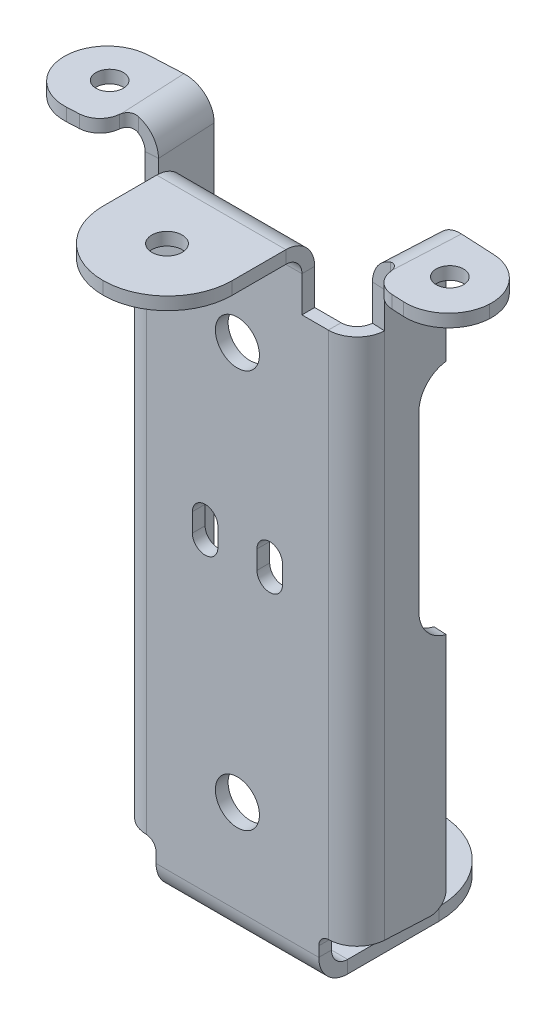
ISO-10303-21;
HEADER;
FILE_DESCRIPTION(('STEP AP214'),'2;1');
FILE_NAME('part.step','',(''),(''),'','','');
FILE_SCHEMA(('AUTOMOTIVE_DESIGN { 1 0 10303 214 1 1 1 1 }'));
ENDSEC;
DATA;
#1=APPLICATION_CONTEXT('core data for automotive mechanical design processes');
#2=APPLICATION_PROTOCOL_DEFINITION('international standard','automotive_design',2000,#1);
#3=PRODUCT_CONTEXT('',#1,'mechanical');
#4=PRODUCT('Part','Part','',(#3));
#5=PRODUCT_RELATED_PRODUCT_CATEGORY('part','',(#4));
#6=PRODUCT_DEFINITION_FORMATION('','',#4);
#7=PRODUCT_DEFINITION_CONTEXT('part definition',#1,'design');
#8=PRODUCT_DEFINITION('design','',#6,#7);
#9=PRODUCT_DEFINITION_SHAPE('','',#8);
#10=(LENGTH_UNIT() NAMED_UNIT(*) SI_UNIT(.MILLI.,.METRE.));
#11=(NAMED_UNIT(*) PLANE_ANGLE_UNIT() SI_UNIT($,.RADIAN.));
#12=(NAMED_UNIT(*) SI_UNIT($,.STERADIAN.) SOLID_ANGLE_UNIT());
#13=UNCERTAINTY_MEASURE_WITH_UNIT(LENGTH_MEASURE(1.E-05),#10,'distance_accuracy_value','');
#14=(GEOMETRIC_REPRESENTATION_CONTEXT(3) GLOBAL_UNCERTAINTY_ASSIGNED_CONTEXT((#13)) GLOBAL_UNIT_ASSIGNED_CONTEXT((#10,
#11,#12)) REPRESENTATION_CONTEXT('',''));
#15=CARTESIAN_POINT('',(0.,0.,0.));
#16=DIRECTION('',(0.,0.,1.));
#17=DIRECTION('',(1.,0.,0.));
#18=AXIS2_PLACEMENT_3D('',#15,#16,#17);
#19=CARTESIAN_POINT('',(-15.5852451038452,77.851,18.9561372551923));
#20=DIRECTION('',(-0.998752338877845,0.,0.0499376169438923));
#21=DIRECTION('',(0.0499376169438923,0.,0.998752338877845));
#22=AXIS2_PLACEMENT_3D('',#19,#20,#21);
#23=PLANE('',#22);
#24=DIRECTION('',(0.,-1.,0.));
#25=VECTOR('',#24,1.);
#26=CARTESIAN_POINT('',(-16.0287143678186,69.8754,10.0867519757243));
#27=LINE('',#26,#25);
#28=CARTESIAN_POINT('',(-16.0287143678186,65.2040092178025,10.0867519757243));
#29=VERTEX_POINT('',#28);
#30=CARTESIAN_POINT('',(-16.0287143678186,39.6217907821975,10.0867519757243));
#31=VERTEX_POINT('',#30);
#32=EDGE_CURVE('E650',#29,#31,#27,.T.);
#33=ORIENTED_EDGE('',*,*,#32,.F.);
#34=CARTESIAN_POINT('',(-16.2665422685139,65.2040092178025,5.33019396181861));
#35=DIRECTION('',(-0.998752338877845,0.,0.0499376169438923));
#36=DIRECTION('',(0.0499376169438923,0.,0.998752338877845));
#37=AXIS2_PLACEMENT_3D('',#34,#35,#36);
#38=CIRCLE('',#37,4.7625);
#39=CARTESIAN_POINT('',(-16.2202451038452,69.8754,6.25613725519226));
#40=VERTEX_POINT('',#39);
#41=EDGE_CURVE('E15',#29,#40,#38,.T.);
#42=ORIENTED_EDGE('',*,*,#41,.T.);
#43=DIRECTION('',(0.,-1.,0.));
#44=VECTOR('',#43,1.);
#45=CARTESIAN_POINT('',(-16.2202451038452,77.851,6.25613725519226));
#46=LINE('',#45,#44);
#47=CARTESIAN_POINT('',(-16.2202451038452,83.11515,6.25613725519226));
#48=VERTEX_POINT('',#47);
#49=EDGE_CURVE('E792',#48,#40,#46,.T.);
#50=ORIENTED_EDGE('',*,*,#49,.F.);
#51=DIRECTION('',(-0.0499376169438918,0.,-0.998752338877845));
#52=VECTOR('',#51,1.);
#53=CARTESIAN_POINT('',(-16.2202451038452,83.11515,6.25613725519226));
#54=LINE('',#53,#52);
#55=CARTESIAN_POINT('',(-15.7876487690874,83.11515,14.9080639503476));
#56=VERTEX_POINT('',#55);
#57=EDGE_CURVE('E1214',#48,#56,#54,.F.);
#58=ORIENTED_EDGE('',*,*,#57,.T.);
#59=DIRECTION('',(0.,-1.,0.));
#60=VECTOR('',#59,1.);
#61=CARTESIAN_POINT('',(-15.7876487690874,83.11515,14.9080639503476));
#62=LINE('',#61,#60);
#63=CARTESIAN_POINT('',(-15.7876487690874,77.851,14.9080639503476));
#64=VERTEX_POINT('',#63);
#65=EDGE_CURVE('E1239',#56,#64,#62,.T.);
#66=ORIENTED_EDGE('',*,*,#65,.T.);
#67=DIRECTION('',(0.,-1.,0.));
#68=VECTOR('',#67,1.);
#69=CARTESIAN_POINT('',(-15.7876487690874,77.851,14.9080639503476));
#70=LINE('',#69,#68);
#71=CARTESIAN_POINT('',(-15.7876487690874,0.,14.9080639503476));
#72=VERTEX_POINT('',#71);
#73=EDGE_CURVE('E1048',#64,#72,#70,.T.);
#74=ORIENTED_EDGE('',*,*,#73,.T.);
#75=DIRECTION('',(-0.0499376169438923,0.,-0.998752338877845));
#76=VECTOR('',#75,1.);
#77=CARTESIAN_POINT('',(-15.5852451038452,0.,18.9561372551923));
#78=LINE('',#77,#76);
#79=CARTESIAN_POINT('',(-16.1022824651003,0.,8.6153900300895));
#80=VERTEX_POINT('',#79);
#81=EDGE_CURVE('E829',#72,#80,#78,.T.);
#82=ORIENTED_EDGE('',*,*,#81,.T.);
#83=CARTESIAN_POINT('',(-16.1022824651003,2.3622,8.6153900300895));
#84=DIRECTION('',(-0.998752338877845,0.,0.0499376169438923));
#85=DIRECTION('',(0.0499376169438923,0.,0.998752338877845));
#86=AXIS2_PLACEMENT_3D('',#83,#84,#85);
#87=CIRCLE('',#86,2.3622);
#88=CARTESIAN_POINT('',(-16.2202451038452,2.36219999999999,6.25613725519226));
#89=VERTEX_POINT('',#88);
#90=EDGE_CURVE('E1016',#80,#89,#87,.F.);
#91=ORIENTED_EDGE('',*,*,#90,.T.);
#92=CARTESIAN_POINT('',(-16.2202451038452,34.9504,6.25613725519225));
#93=VERTEX_POINT('',#92);
#94=EDGE_CURVE('E798',#93,#89,#46,.T.);
#95=ORIENTED_EDGE('',*,*,#94,.F.);
#96=CARTESIAN_POINT('',(-16.2665422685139,39.6217907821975,5.3301939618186));
#97=DIRECTION('',(-0.998752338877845,0.,0.0499376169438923));
#98=DIRECTION('',(0.0499376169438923,0.,0.998752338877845));
#99=AXIS2_PLACEMENT_3D('',#96,#97,#98);
#100=CIRCLE('',#99,4.7625);
#101=EDGE_CURVE('E772',#93,#31,#100,.T.);
#102=ORIENTED_EDGE('',*,*,#101,.T.);
#103=EDGE_LOOP('',(#33,#42,#50,#58,#66,#74,#82,#91,#95,#102));
#104=FACE_BOUND('',#103,.T.);
#105=ADVANCED_FACE('F135',(#104),#23,.F.);
#106=CARTESIAN_POINT('',(-18.0975,77.851,6.35));
#107=DIRECTION('',(-0.0499376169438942,0.,-0.998752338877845));
#108=DIRECTION('',(-0.998752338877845,0.,0.0499376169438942));
#109=AXIS2_PLACEMENT_3D('',#106,#107,#108);
#110=PLANE('',#109);
#111=ORIENTED_EDGE('',*,*,#49,.T.);
#112=DIRECTION('',(-0.998752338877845,0.,0.0499376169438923));
#113=VECTOR('',#112,1.);
#114=CARTESIAN_POINT('',(-16.2202451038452,69.8754,6.25613725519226));
#115=LINE('',#114,#113);
#116=CARTESIAN_POINT('',(-18.0975,69.8754,6.35));
#117=VERTEX_POINT('',#116);
#118=EDGE_CURVE('E656',#40,#117,#115,.T.);
#119=ORIENTED_EDGE('',*,*,#118,.T.);
#120=DIRECTION('',(0.,-1.,0.));
#121=VECTOR('',#120,1.);
#122=CARTESIAN_POINT('',(-18.0975,77.851,6.35));
#123=LINE('',#122,#121);
#124=CARTESIAN_POINT('',(-18.0975,83.11515,6.35));
#125=VERTEX_POINT('',#124);
#126=EDGE_CURVE('E779',#125,#117,#123,.T.);
#127=ORIENTED_EDGE('',*,*,#126,.F.);
#128=DIRECTION('',(0.998752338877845,0.,-0.0499376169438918));
#129=VECTOR('',#128,1.);
#130=CARTESIAN_POINT('',(-18.0975,83.11515,6.35));
#131=LINE('',#130,#129);
#132=EDGE_CURVE('E796',#125,#48,#131,.T.);
#133=ORIENTED_EDGE('',*,*,#132,.T.);
#134=EDGE_LOOP('',(#111,#119,#127,#133));
#135=FACE_BOUND('',#134,.T.);
#136=ADVANCED_FACE('F795',(#135),#110,.T.);
#137=CARTESIAN_POINT('',(-18.0975,34.9504,6.35));
#138=VERTEX_POINT('',#137);
#139=CARTESIAN_POINT('',(-18.0975,2.36219999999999,6.35));
#140=VERTEX_POINT('',#139);
#141=EDGE_CURVE('E1023',#138,#140,#123,.T.);
#142=ORIENTED_EDGE('',*,*,#141,.F.);
#143=DIRECTION('',(-0.998752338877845,0.,0.0499376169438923));
#144=VECTOR('',#143,1.);
#145=CARTESIAN_POINT('',(-16.2202451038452,34.9504,6.25613725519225));
#146=LINE('',#145,#144);
#147=EDGE_CURVE('E653',#93,#138,#146,.T.);
#148=ORIENTED_EDGE('',*,*,#147,.F.);
#149=ORIENTED_EDGE('',*,*,#94,.T.);
#150=DIRECTION('',(0.998752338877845,0.,-0.0499376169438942));
#151=VECTOR('',#150,1.);
#152=CARTESIAN_POINT('',(-18.0975,2.3622,6.35));
#153=LINE('',#152,#151);
#154=EDGE_CURVE('E1021',#89,#140,#153,.F.);
#155=ORIENTED_EDGE('',*,*,#154,.T.);
#156=EDGE_LOOP('',(#142,#148,#149,#155));
#157=FACE_BOUND('',#156,.T.);
#158=ADVANCED_FACE('F876',(#157),#110,.T.);
#159=CARTESIAN_POINT('',(-17.4625,77.851,19.05));
#160=DIRECTION('',(-0.998752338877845,0.,0.0499376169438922));
#161=DIRECTION('',(0.0499376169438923,0.,0.998752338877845));
#162=AXIS2_PLACEMENT_3D('',#159,#160,#161);
#163=PLANE('',#162);
#164=ORIENTED_EDGE('',*,*,#126,.T.);
#165=CARTESIAN_POINT('',(-18.1437971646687,65.2040092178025,5.42405670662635));
#166=DIRECTION('',(-0.998752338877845,0.,0.0499376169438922));
#167=DIRECTION('',(0.0499376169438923,0.,0.998752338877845));
#168=AXIS2_PLACEMENT_3D('',#165,#166,#167);
#169=CIRCLE('',#168,4.7625);
#170=CARTESIAN_POINT('',(-17.9059692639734,65.2040092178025,10.1806147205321));
#171=VERTEX_POINT('',#170);
#172=EDGE_CURVE('E143',#117,#171,#169,.F.);
#173=ORIENTED_EDGE('',*,*,#172,.T.);
#174=DIRECTION('',(0.,-1.,0.));
#175=VECTOR('',#174,1.);
#176=CARTESIAN_POINT('',(-17.9059692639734,69.8754,10.1806147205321));
#177=LINE('',#176,#175);
#178=CARTESIAN_POINT('',(-17.9059692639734,39.6217907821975,10.1806147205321));
#179=VERTEX_POINT('',#178);
#180=EDGE_CURVE('E647',#171,#179,#177,.T.);
#181=ORIENTED_EDGE('',*,*,#180,.T.);
#182=CARTESIAN_POINT('',(-18.1437971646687,39.6217907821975,5.42405670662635));
#183=DIRECTION('',(-0.998752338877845,0.,0.0499376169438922));
#184=DIRECTION('',(0.0499376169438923,0.,0.998752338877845));
#185=AXIS2_PLACEMENT_3D('',#182,#183,#184);
#186=CIRCLE('',#185,4.7625);
#187=EDGE_CURVE('E770',#179,#138,#186,.F.);
#188=ORIENTED_EDGE('',*,*,#187,.T.);
#189=ORIENTED_EDGE('',*,*,#141,.T.);
#190=CARTESIAN_POINT('',(-17.9795373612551,2.3622,8.70925277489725));
#191=DIRECTION('',(-0.998752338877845,0.,0.0499376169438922));
#192=DIRECTION('',(0.0499376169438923,0.,0.998752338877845));
#193=AXIS2_PLACEMENT_3D('',#190,#191,#192);
#194=CIRCLE('',#193,2.3622);
#195=CARTESIAN_POINT('',(-17.9795373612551,0.,8.70925277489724));
#196=VERTEX_POINT('',#195);
#197=EDGE_CURVE('E1084',#140,#196,#194,.T.);
#198=ORIENTED_EDGE('',*,*,#197,.T.);
#199=DIRECTION('',(-0.0499376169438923,0.,-0.998752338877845));
#200=VECTOR('',#199,1.);
#201=CARTESIAN_POINT('',(-17.4625,0.,19.05));
#202=LINE('',#201,#200);
#203=CARTESIAN_POINT('',(-17.6649036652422,0.,15.0019266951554));
#204=VERTEX_POINT('',#203);
#205=EDGE_CURVE('E1065',#204,#196,#202,.T.);
#206=ORIENTED_EDGE('',*,*,#205,.F.);
#207=DIRECTION('',(0.,-1.,0.));
#208=VECTOR('',#207,1.);
#209=CARTESIAN_POINT('',(-17.6649036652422,77.851,15.0019266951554));
#210=LINE('',#209,#208);
#211=CARTESIAN_POINT('',(-17.6649036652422,77.851,15.0019266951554));
#212=VERTEX_POINT('',#211);
#213=EDGE_CURVE('E1024',#212,#204,#210,.T.);
#214=ORIENTED_EDGE('',*,*,#213,.F.);
#215=DIRECTION('',(0.,-1.,0.));
#216=VECTOR('',#215,1.);
#217=CARTESIAN_POINT('',(-17.6649036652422,83.11515,15.0019266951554));
#218=LINE('',#217,#216);
#219=CARTESIAN_POINT('',(-17.6649036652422,83.11515,15.0019266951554));
#220=VERTEX_POINT('',#219);
#221=EDGE_CURVE('E1237',#220,#212,#218,.T.);
#222=ORIENTED_EDGE('',*,*,#221,.F.);
#223=DIRECTION('',(-0.0499376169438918,0.,-0.998752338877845));
#224=VECTOR('',#223,1.);
#225=CARTESIAN_POINT('',(-18.0975,83.11515,6.35));
#226=LINE('',#225,#224);
#227=EDGE_CURVE('E1225',#125,#220,#226,.F.);
#228=ORIENTED_EDGE('',*,*,#227,.F.);
#229=EDGE_LOOP('',(#164,#173,#181,#188,#189,#198,#206,#214,#222,#228));
#230=FACE_BOUND('',#229,.T.);
#231=ADVANCED_FACE('F776',(#230),#163,.T.);
#232=CARTESIAN_POINT('',(16.2202451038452,77.851,6.25613725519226));
#233=DIRECTION('',(0.0499376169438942,0.,-0.998752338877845));
#234=DIRECTION('',(-0.998752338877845,0.,-0.0499376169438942));
#235=AXIS2_PLACEMENT_3D('',#232,#233,#234);
#236=PLANE('',#235);
#237=DIRECTION('',(0.998752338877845,0.,0.0499376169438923));
#238=VECTOR('',#237,1.);
#239=CARTESIAN_POINT('',(16.2202451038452,34.9504,6.25613725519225));
#240=LINE('',#239,#238);
#241=CARTESIAN_POINT('',(16.2202451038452,34.9504,6.25613725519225));
#242=VERTEX_POINT('',#241);
#243=CARTESIAN_POINT('',(18.0975,34.9504,6.34999999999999));
#244=VERTEX_POINT('',#243);
#245=EDGE_CURVE('E668',#242,#244,#240,.T.);
#246=ORIENTED_EDGE('',*,*,#245,.T.);
#247=DIRECTION('',(0.,-1.,0.));
#248=VECTOR('',#247,1.);
#249=CARTESIAN_POINT('',(18.0975,77.851,6.35));
#250=LINE('',#249,#248);
#251=CARTESIAN_POINT('',(18.0975,2.36219999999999,6.35));
#252=VERTEX_POINT('',#251);
#253=EDGE_CURVE('E1036',#244,#252,#250,.T.);
#254=ORIENTED_EDGE('',*,*,#253,.T.);
#255=DIRECTION('',(0.998752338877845,0.,0.0499376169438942));
#256=VECTOR('',#255,1.);
#257=CARTESIAN_POINT('',(16.2202451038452,2.36219999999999,6.25613725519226));
#258=LINE('',#257,#256);
#259=CARTESIAN_POINT('',(16.2202451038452,2.36219999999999,6.25613725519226));
#260=VERTEX_POINT('',#259);
#261=EDGE_CURVE('E1092',#252,#260,#258,.F.);
#262=ORIENTED_EDGE('',*,*,#261,.T.);
#263=DIRECTION('',(0.,-1.,0.));
#264=VECTOR('',#263,1.);
#265=CARTESIAN_POINT('',(16.2202451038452,77.851,6.25613725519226));
#266=LINE('',#265,#264);
#267=EDGE_CURVE('E1040',#242,#260,#266,.T.);
#268=ORIENTED_EDGE('',*,*,#267,.F.);
#269=EDGE_LOOP('',(#246,#254,#262,#268));
#270=FACE_BOUND('',#269,.T.);
#271=ADVANCED_FACE('F875',(#270),#236,.T.);
#272=CARTESIAN_POINT('',(15.7876487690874,77.851,14.9080639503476));
#273=DIRECTION('',(0.,1.,0.));
#274=DIRECTION('',(0.,0.,1.));
#275=AXIS2_PLACEMENT_3D('',#272,#273,#274);
#276=PLANE('',#275);
#277=DIRECTION('',(-1.,0.,0.));
#278=VECTOR('',#277,1.);
#279=CARTESIAN_POINT('',(-17.4625,77.851,19.05));
#280=LINE('',#279,#278);
#281=CARTESIAN_POINT('',(-9.525,77.851,19.05));
#282=VERTEX_POINT('',#281);
#283=CARTESIAN_POINT('',(-13.4093697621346,77.851,19.05));
#284=VERTEX_POINT('',#283);
#285=EDGE_CURVE('E933',#282,#284,#280,.T.);
#286=ORIENTED_EDGE('',*,*,#285,.F.);
#287=DIRECTION('',(0.,0.,-1.));
#288=VECTOR('',#287,1.);
#289=CARTESIAN_POINT('',(-9.525,77.851,19.05));
#290=LINE('',#289,#288);
#291=CARTESIAN_POINT('',(-9.525,77.851,17.1704));
#292=VERTEX_POINT('',#291);
#293=EDGE_CURVE('E727',#282,#292,#290,.T.);
#294=ORIENTED_EDGE('',*,*,#293,.T.);
#295=DIRECTION('',(1.,0.,0.));
#296=VECTOR('',#295,1.);
#297=CARTESIAN_POINT('',(-17.4625,77.851,17.1704));
#298=LINE('',#297,#296);
#299=CARTESIAN_POINT('',(-13.4093697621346,77.851,17.1704));
#300=VERTEX_POINT('',#299);
#301=EDGE_CURVE('E940',#292,#300,#298,.F.);
#302=ORIENTED_EDGE('',*,*,#301,.T.);
#303=DIRECTION('',(0.,0.,1.));
#304=VECTOR('',#303,1.);
#305=CARTESIAN_POINT('',(-13.4093697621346,77.851,17.1704));
#306=LINE('',#305,#304);
#307=EDGE_CURVE('E801',#300,#284,#306,.T.);
#308=ORIENTED_EDGE('',*,*,#307,.T.);
#309=EDGE_LOOP('',(#286,#294,#302,#308));
#310=FACE_BOUND('',#309,.T.);
#311=ADVANCED_FACE('F900',(#310),#276,.T.);
#312=CARTESIAN_POINT('',(13.4093697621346,77.851,19.05));
#313=DIRECTION('',(0.,1.,0.));
#314=DIRECTION('',(0.,0.,1.));
#315=AXIS2_PLACEMENT_3D('',#312,#313,#314);
#316=PLANE('',#315);
#317=DIRECTION('',(0.,0.,-1.));
#318=VECTOR('',#317,1.);
#319=CARTESIAN_POINT('',(13.4093697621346,77.851,19.05));
#320=LINE('',#319,#318);
#321=CARTESIAN_POINT('',(13.4093697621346,77.851,19.05));
#322=VERTEX_POINT('',#321);
#323=CARTESIAN_POINT('',(13.4093697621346,77.851,17.1704));
#324=VERTEX_POINT('',#323);
#325=EDGE_CURVE('E817',#322,#324,#320,.T.);
#326=ORIENTED_EDGE('',*,*,#325,.F.);
#327=CARTESIAN_POINT('',(13.4093697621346,77.851,14.78915));
#328=DIRECTION('',(0.,1.,0.));
#329=DIRECTION('',(0.,0.,1.));
#330=AXIS2_PLACEMENT_3D('',#327,#328,#329);
#331=CIRCLE('',#330,4.26085);
#332=CARTESIAN_POINT('',(17.6649036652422,77.851,15.0019266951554));
#333=VERTEX_POINT('',#332);
#334=EDGE_CURVE('E914',#333,#322,#331,.F.);
#335=ORIENTED_EDGE('',*,*,#334,.F.);
#336=DIRECTION('',(0.998752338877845,0.,0.0499376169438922));
#337=VECTOR('',#336,1.);
#338=CARTESIAN_POINT('',(15.7876487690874,77.851,14.9080639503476));
#339=LINE('',#338,#337);
#340=CARTESIAN_POINT('',(15.7876487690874,77.851,14.9080639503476));
#341=VERTEX_POINT('',#340);
#342=EDGE_CURVE('E814',#341,#333,#339,.T.);
#343=ORIENTED_EDGE('',*,*,#342,.F.);
#344=CARTESIAN_POINT('',(13.4093697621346,77.851,14.78915));
#345=DIRECTION('',(0.,1.,0.));
#346=DIRECTION('',(1.,0.,0.));
#347=AXIS2_PLACEMENT_3D('',#344,#345,#346);
#348=CIRCLE('',#347,2.38125);
#349=EDGE_CURVE('E916',#341,#324,#348,.F.);
#350=ORIENTED_EDGE('',*,*,#349,.T.);
#351=EDGE_LOOP('',(#326,#335,#343,#350));
#352=FACE_BOUND('',#351,.T.);
#353=ADVANCED_FACE('F898',(#352),#316,.T.);
#354=DIRECTION('',(0.,0.,-1.));
#355=VECTOR('',#354,1.);
#356=CARTESIAN_POINT('',(9.525,77.851,19.05));
#357=LINE('',#356,#355);
#358=CARTESIAN_POINT('',(9.525,77.851,19.05));
#359=VERTEX_POINT('',#358);
#360=CARTESIAN_POINT('',(9.525,77.851,17.1704));
#361=VERTEX_POINT('',#360);
#362=EDGE_CURVE('E716',#359,#361,#357,.T.);
#363=ORIENTED_EDGE('',*,*,#362,.F.);
#364=EDGE_CURVE('E925',#322,#359,#280,.T.);
#365=ORIENTED_EDGE('',*,*,#364,.F.);
#366=ORIENTED_EDGE('',*,*,#325,.T.);
#367=EDGE_CURVE('E954',#324,#361,#298,.F.);
#368=ORIENTED_EDGE('',*,*,#367,.T.);
#369=EDGE_LOOP('',(#363,#365,#366,#368));
#370=FACE_BOUND('',#369,.T.);
#371=ADVANCED_FACE('F895',(#370),#276,.T.);
#372=CARTESIAN_POINT('',(17.6649036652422,0.,15.0019266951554));
#373=DIRECTION('',(0.,-1.,0.));
#374=DIRECTION('',(0.,0.,-1.));
#375=AXIS2_PLACEMENT_3D('',#372,#373,#374);
#376=PLANE('',#375);
#377=CARTESIAN_POINT('',(13.4093697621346,0.,14.78915));
#378=DIRECTION('',(0.,1.,0.));
#379=DIRECTION('',(0.,0.,1.));
#380=AXIS2_PLACEMENT_3D('',#377,#378,#379);
#381=CIRCLE('',#380,4.26085);
#382=CARTESIAN_POINT('',(17.6649036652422,0.,15.0019266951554));
#383=VERTEX_POINT('',#382);
#384=CARTESIAN_POINT('',(13.5255,0.,19.0484171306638));
#385=VERTEX_POINT('',#384);
#386=EDGE_CURVE('E1060',#383,#385,#381,.F.);
#387=ORIENTED_EDGE('',*,*,#386,.T.);
#388=DIRECTION('',(0.,0.,-1.));
#389=VECTOR('',#388,1.);
#390=CARTESIAN_POINT('',(13.5255,0.,17.1704));
#391=LINE('',#390,#389);
#392=CARTESIAN_POINT('',(13.5255,0.,17.1675665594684));
#393=VERTEX_POINT('',#392);
#394=EDGE_CURVE('E849',#385,#393,#391,.T.);
#395=ORIENTED_EDGE('',*,*,#394,.T.);
#396=CARTESIAN_POINT('',(13.4093697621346,0.,14.78915));
#397=DIRECTION('',(0.,1.,0.));
#398=DIRECTION('',(1.,0.,0.));
#399=AXIS2_PLACEMENT_3D('',#396,#397,#398);
#400=CIRCLE('',#399,2.38125);
#401=CARTESIAN_POINT('',(15.7876487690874,0.,14.9080639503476));
#402=VERTEX_POINT('',#401);
#403=EDGE_CURVE('E1053',#402,#393,#400,.F.);
#404=ORIENTED_EDGE('',*,*,#403,.F.);
#405=DIRECTION('',(-0.998752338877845,0.,-0.0499376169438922));
#406=VECTOR('',#405,1.);
#407=CARTESIAN_POINT('',(17.6649036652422,0.,15.0019266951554));
#408=LINE('',#407,#406);
#409=EDGE_CURVE('E811',#383,#402,#408,.T.);
#410=ORIENTED_EDGE('',*,*,#409,.F.);
#411=EDGE_LOOP('',(#387,#395,#404,#410));
#412=FACE_BOUND('',#411,.T.);
#413=ADVANCED_FACE('F891',(#412),#376,.T.);
#414=CARTESIAN_POINT('',(13.4093697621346,0.,17.1704));
#415=DIRECTION('',(0.,-1.,0.));
#416=DIRECTION('',(0.,0.,-1.));
#417=AXIS2_PLACEMENT_3D('',#414,#415,#416);
#418=PLANE('',#417);
#419=DIRECTION('',(-0.0499376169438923,0.,0.998752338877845));
#420=VECTOR('',#419,1.);
#421=CARTESIAN_POINT('',(15.5852451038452,0.,18.9561372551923));
#422=LINE('',#421,#420);
#423=CARTESIAN_POINT('',(16.1022824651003,0.,8.6153900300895));
#424=VERTEX_POINT('',#423);
#425=EDGE_CURVE('E1056',#424,#402,#422,.T.);
#426=ORIENTED_EDGE('',*,*,#425,.F.);
#427=DIRECTION('',(0.998752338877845,0.,0.0499376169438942));
#428=VECTOR('',#427,1.);
#429=CARTESIAN_POINT('',(13.8427690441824,0.,8.5024143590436));
#430=LINE('',#429,#428);
#431=CARTESIAN_POINT('',(17.9795373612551,0.,8.70925277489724));
#432=VERTEX_POINT('',#431);
#433=EDGE_CURVE('E1086',#424,#432,#430,.T.);
#434=ORIENTED_EDGE('',*,*,#433,.T.);
#435=DIRECTION('',(-0.0499376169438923,0.,0.998752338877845));
#436=VECTOR('',#435,1.);
#437=CARTESIAN_POINT('',(17.4625,0.,19.05));
#438=LINE('',#437,#436);
#439=EDGE_CURVE('E1058',#432,#383,#438,.T.);
#440=ORIENTED_EDGE('',*,*,#439,.T.);
#441=ORIENTED_EDGE('',*,*,#409,.T.);
#442=EDGE_LOOP('',(#426,#434,#440,#441));
#443=FACE_BOUND('',#442,.T.);
#444=ADVANCED_FACE('F887',(#443),#418,.T.);
#445=CARTESIAN_POINT('',(-17.6649036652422,77.851,15.0019266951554));
#446=DIRECTION('',(0.,1.,0.));
#447=DIRECTION('',(0.,0.,1.));
#448=AXIS2_PLACEMENT_3D('',#445,#446,#447);
#449=PLANE('',#448);
#450=DIRECTION('',(0.998752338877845,0.,-0.0499376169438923));
#451=VECTOR('',#450,1.);
#452=CARTESIAN_POINT('',(-17.6649036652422,77.851,15.0019266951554));
#453=LINE('',#452,#451);
#454=EDGE_CURVE('E808',#212,#64,#453,.T.);
#455=ORIENTED_EDGE('',*,*,#454,.F.);
#456=CARTESIAN_POINT('',(-13.4093697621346,77.851,14.78915));
#457=DIRECTION('',(0.,1.,0.));
#458=DIRECTION('',(0.,0.,1.));
#459=AXIS2_PLACEMENT_3D('',#456,#457,#458);
#460=CIRCLE('',#459,4.26085);
#461=EDGE_CURVE('E956',#284,#212,#460,.F.);
#462=ORIENTED_EDGE('',*,*,#461,.F.);
#463=ORIENTED_EDGE('',*,*,#307,.F.);
#464=CARTESIAN_POINT('',(-13.4093697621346,77.851,14.78915));
#465=DIRECTION('',(0.,1.,0.));
#466=DIRECTION('',(1.,0.,0.));
#467=AXIS2_PLACEMENT_3D('',#464,#465,#466);
#468=CIRCLE('',#467,2.38125);
#469=EDGE_CURVE('E948',#300,#64,#468,.F.);
#470=ORIENTED_EDGE('',*,*,#469,.T.);
#471=EDGE_LOOP('',(#455,#462,#463,#470));
#472=FACE_BOUND('',#471,.T.);
#473=ADVANCED_FACE('F883',(#472),#449,.T.);
#474=CARTESIAN_POINT('',(-13.4093697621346,0.,19.05));
#475=DIRECTION('',(0.,-1.,0.));
#476=DIRECTION('',(0.,0.,-1.));
#477=AXIS2_PLACEMENT_3D('',#474,#475,#476);
#478=PLANE('',#477);
#479=CARTESIAN_POINT('',(-13.4093697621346,0.,14.78915));
#480=DIRECTION('',(0.,1.,0.));
#481=DIRECTION('',(1.,0.,0.));
#482=AXIS2_PLACEMENT_3D('',#479,#480,#481);
#483=CIRCLE('',#482,2.38125);
#484=CARTESIAN_POINT('',(-13.5255,0.,17.1675665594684));
#485=VERTEX_POINT('',#484);
#486=EDGE_CURVE('E1051',#485,#72,#483,.F.);
#487=ORIENTED_EDGE('',*,*,#486,.F.);
#488=DIRECTION('',(0.,0.,1.));
#489=VECTOR('',#488,1.);
#490=CARTESIAN_POINT('',(-13.5255,0.,19.05));
#491=LINE('',#490,#489);
#492=CARTESIAN_POINT('',(-13.5255,0.,19.0484171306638));
#493=VERTEX_POINT('',#492);
#494=EDGE_CURVE('E819',#485,#493,#491,.T.);
#495=ORIENTED_EDGE('',*,*,#494,.T.);
#496=CARTESIAN_POINT('',(-13.4093697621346,0.,14.78915));
#497=DIRECTION('',(0.,1.,0.));
#498=DIRECTION('',(0.,0.,1.));
#499=AXIS2_PLACEMENT_3D('',#496,#497,#498);
#500=CIRCLE('',#499,4.26085);
#501=EDGE_CURVE('E1063',#493,#204,#500,.F.);
#502=ORIENTED_EDGE('',*,*,#501,.T.);
#503=DIRECTION('',(-0.998752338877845,0.,0.0499376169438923));
#504=VECTOR('',#503,1.);
#505=CARTESIAN_POINT('',(-15.7876487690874,0.,14.9080639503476));
#506=LINE('',#505,#504);
#507=EDGE_CURVE('E797',#72,#204,#506,.T.);
#508=ORIENTED_EDGE('',*,*,#507,.F.);
#509=EDGE_LOOP('',(#487,#495,#502,#508));
#510=FACE_BOUND('',#509,.T.);
#511=ADVANCED_FACE('F870',(#510),#478,.T.);
#512=CARTESIAN_POINT('',(-13.4093697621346,77.851,14.78915));
#513=DIRECTION('',(0.,-1.,0.));
#514=DIRECTION('',(0.,0.,-1.));
#515=AXIS2_PLACEMENT_3D('',#512,#513,#514);
#516=CYLINDRICAL_SURFACE('',#515,4.26085);
#517=ORIENTED_EDGE('',*,*,#501,.F.);
#518=CARTESIAN_POINT('',(-13.5255,0.,19.0484171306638));
#519=CARTESIAN_POINT('',(-13.5061203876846,-1.3140506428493E-07,19.0489451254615));
#520=CARTESIAN_POINT('',(-13.4867530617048,-0.000369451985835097,19.0493410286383));
#521=CARTESIAN_POINT('',(-13.4480429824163,-0.00184647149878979,19.0498686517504));
#522=CARTESIAN_POINT('',(-13.4287002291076,-0.00295417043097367,19.0500003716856));
#523=CARTESIAN_POINT('',(-13.4093697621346,-0.0044310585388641,19.05));
#524=B_SPLINE_CURVE_WITH_KNOTS('',3,(#518,#519,#520,#521,#522,#523),.UNSPECIFIED.,.F.,.F.,(4,2,
4),(0.,0.0581246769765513,0.116249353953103),.UNSPECIFIED.);
#525=CARTESIAN_POINT('',(-13.4093697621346,-0.00443105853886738,19.05));
#526=VERTEX_POINT('',#525);
#527=EDGE_CURVE('E851',#493,#526,#524,.T.);
#528=ORIENTED_EDGE('',*,*,#527,.T.);
#529=DIRECTION('',(0.,-1.,0.));
#530=VECTOR('',#529,1.);
#531=CARTESIAN_POINT('',(-13.4093697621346,77.851,19.05));
#532=LINE('',#531,#530);
#533=EDGE_CURVE('E929',#284,#526,#532,.T.);
#534=ORIENTED_EDGE('',*,*,#533,.F.);
#535=ORIENTED_EDGE('',*,*,#461,.T.);
#536=ORIENTED_EDGE('',*,*,#213,.T.);
#537=EDGE_LOOP('',(#517,#528,#534,#535,#536));
#538=FACE_BOUND('',#537,.T.);
#539=ADVANCED_FACE('F865',(#538),#516,.T.);
#540=CARTESIAN_POINT('',(-17.4625,77.851,19.05));
#541=DIRECTION('',(0.,0.,1.));
#542=DIRECTION('',(1.,0.,0.));
#543=AXIS2_PLACEMENT_3D('',#540,#541,#542);
#544=PLANE('',#543);
#545=CARTESIAN_POINT('',(-4.7625,44.6278,19.05));
#546=DIRECTION('',(0.,0.,-1.));
#547=DIRECTION('',(1.,0.,0.));
#548=AXIS2_PLACEMENT_3D('',#545,#546,#547);
#549=CIRCLE('',#548,1.8796);
#550=CARTESIAN_POINT('',(-6.6421,44.6278,19.05));
#551=VERTEX_POINT('',#550);
#552=CARTESIAN_POINT('',(-2.8829,44.6278,19.05));
#553=VERTEX_POINT('',#552);
#554=EDGE_CURVE('E567',#551,#553,#549,.T.);
#555=ORIENTED_EDGE('',*,*,#554,.T.);
#556=DIRECTION('',(0.,-1.,0.));
#557=VECTOR('',#556,1.);
#558=CARTESIAN_POINT('',(-2.8829,44.6278,19.05));
#559=LINE('',#558,#557);
#560=CARTESIAN_POINT('',(-2.8829,41.8846,19.05));
#561=VERTEX_POINT('',#560);
#562=EDGE_CURVE('E576',#553,#561,#559,.T.);
#563=ORIENTED_EDGE('',*,*,#562,.T.);
#564=CARTESIAN_POINT('',(-4.7625,41.8846,19.05));
#565=DIRECTION('',(0.,0.,-1.));
#566=DIRECTION('',(1.,0.,0.));
#567=AXIS2_PLACEMENT_3D('',#564,#565,#566);
#568=CIRCLE('',#567,1.8796);
#569=CARTESIAN_POINT('',(-6.6421,41.8846,19.05));
#570=VERTEX_POINT('',#569);
#571=EDGE_CURVE('E150',#561,#570,#568,.T.);
#572=ORIENTED_EDGE('',*,*,#571,.T.);
#573=DIRECTION('',(0.,1.,0.));
#574=VECTOR('',#573,1.);
#575=CARTESIAN_POINT('',(-6.6421,44.6278,19.05));
#576=LINE('',#575,#574);
#577=EDGE_CURVE('E573',#570,#551,#576,.T.);
#578=ORIENTED_EDGE('',*,*,#577,.T.);
#579=EDGE_LOOP('',(#555,#563,#572,#578));
#580=FACE_BOUND('',#579,.T.);
#581=CARTESIAN_POINT('',(4.7625,44.6278,19.05));
#582=DIRECTION('',(0.,0.,-1.));
#583=DIRECTION('',(-1.,0.,0.));
#584=AXIS2_PLACEMENT_3D('',#581,#582,#583);
#585=CIRCLE('',#584,1.8796);
#586=CARTESIAN_POINT('',(2.8829,44.6278,19.05));
#587=VERTEX_POINT('',#586);
#588=CARTESIAN_POINT('',(6.6421,44.6278,19.05));
#589=VERTEX_POINT('',#588);
#590=EDGE_CURVE('E606',#587,#589,#585,.T.);
#591=ORIENTED_EDGE('',*,*,#590,.T.);
#592=DIRECTION('',(0.,-1.,0.));
#593=VECTOR('',#592,1.);
#594=CARTESIAN_POINT('',(6.6421,44.6278,19.05));
#595=LINE('',#594,#593);
#596=CARTESIAN_POINT('',(6.6421,41.8846,19.05));
#597=VERTEX_POINT('',#596);
#598=EDGE_CURVE('E609',#589,#597,#595,.T.);
#599=ORIENTED_EDGE('',*,*,#598,.T.);
#600=CARTESIAN_POINT('',(4.7625,41.8846,19.05));
#601=DIRECTION('',(0.,0.,-1.));
#602=DIRECTION('',(-1.,0.,0.));
#603=AXIS2_PLACEMENT_3D('',#600,#601,#602);
#604=CIRCLE('',#603,1.8796);
#605=CARTESIAN_POINT('',(2.8829,41.8846,19.05));
#606=VERTEX_POINT('',#605);
#607=EDGE_CURVE('E613',#597,#606,#604,.T.);
#608=ORIENTED_EDGE('',*,*,#607,.T.);
#609=DIRECTION('',(0.,1.,0.));
#610=VECTOR('',#609,1.);
#611=CARTESIAN_POINT('',(2.8829,44.6278,19.05));
#612=LINE('',#611,#610);
#613=EDGE_CURVE('E616',#606,#587,#612,.T.);
#614=ORIENTED_EDGE('',*,*,#613,.T.);
#615=EDGE_LOOP('',(#591,#599,#608,#614));
#616=FACE_BOUND('',#615,.T.);
#617=CARTESIAN_POINT('',(0.,10.8077,19.05));
#618=DIRECTION('',(0.,0.,-1.));
#619=DIRECTION('',(-1.,0.,0.));
#620=AXIS2_PLACEMENT_3D('',#617,#618,#619);
#621=CIRCLE('',#620,3.2512);
#622=CARTESIAN_POINT('',(-3.2512,10.8077,19.05));
#623=VERTEX_POINT('',#622);
#624=EDGE_CURVE('E638',#623,#623,#621,.T.);
#625=ORIENTED_EDGE('',*,*,#624,.T.);
#626=EDGE_LOOP('',(#625));
#627=FACE_BOUND('',#626,.T.);
#628=CARTESIAN_POINT('',(0.,69.5452,19.05));
#629=DIRECTION('',(0.,0.,-1.));
#630=DIRECTION('',(-1.,0.,0.));
#631=AXIS2_PLACEMENT_3D('',#628,#629,#630);
#632=CIRCLE('',#631,3.2512);
#633=CARTESIAN_POINT('',(-3.2512,69.5452,19.05));
#634=VERTEX_POINT('',#633);
#635=EDGE_CURVE('E644',#634,#634,#632,.T.);
#636=ORIENTED_EDGE('',*,*,#635,.T.);
#637=EDGE_LOOP('',(#636));
#638=FACE_BOUND('',#637,.T.);
#639=DIRECTION('',(0.,1.,0.));
#640=VECTOR('',#639,1.);
#641=CARTESIAN_POINT('',(12.0015,-3.00355000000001,19.05));
#642=LINE('',#641,#640);
#643=CARTESIAN_POINT('',(12.0015,-3.00355000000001,19.05));
#644=VERTEX_POINT('',#643);
#645=CARTESIAN_POINT('',(12.0015,-1.524,19.05));
#646=VERTEX_POINT('',#645);
#647=EDGE_CURVE('E824',#644,#646,#642,.T.);
#648=ORIENTED_EDGE('',*,*,#647,.T.);
#649=CARTESIAN_POINT('',(13.5255,-1.524,19.05));
#650=DIRECTION('',(0.,0.,1.));
#651=DIRECTION('',(1.,0.,0.));
#652=AXIS2_PLACEMENT_3D('',#649,#650,#651);
#653=CIRCLE('',#652,1.524);
#654=CARTESIAN_POINT('',(13.4093697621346,-0.00443105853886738,19.05));
#655=VERTEX_POINT('',#654);
#656=EDGE_CURVE('E926',#646,#655,#653,.F.);
#657=ORIENTED_EDGE('',*,*,#656,.T.);
#658=DIRECTION('',(0.,-1.,0.));
#659=VECTOR('',#658,1.);
#660=CARTESIAN_POINT('',(13.4093697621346,77.851,19.05));
#661=LINE('',#660,#659);
#662=EDGE_CURVE('E923',#322,#655,#661,.T.);
#663=ORIENTED_EDGE('',*,*,#662,.F.);
#664=ORIENTED_EDGE('',*,*,#364,.T.);
#665=DIRECTION('',(0.,-1.,0.));
#666=VECTOR('',#665,1.);
#667=CARTESIAN_POINT('',(9.525,83.11515,19.05));
#668=LINE('',#667,#666);
#669=CARTESIAN_POINT('',(9.525,83.11515,19.05));
#670=VERTEX_POINT('',#669);
#671=EDGE_CURVE('E733',#670,#359,#668,.T.);
#672=ORIENTED_EDGE('',*,*,#671,.F.);
#673=DIRECTION('',(-1.,0.,0.));
#674=VECTOR('',#673,1.);
#675=CARTESIAN_POINT('',(-9.525,83.11515,19.05));
#676=LINE('',#675,#674);
#677=CARTESIAN_POINT('',(-9.525,83.11515,19.05));
#678=VERTEX_POINT('',#677);
#679=EDGE_CURVE('E709',#678,#670,#676,.F.);
#680=ORIENTED_EDGE('',*,*,#679,.F.);
#681=DIRECTION('',(0.,-1.,0.));
#682=VECTOR('',#681,1.);
#683=CARTESIAN_POINT('',(-9.525,83.11515,19.05));
#684=LINE('',#683,#682);
#685=EDGE_CURVE('E2132',#678,#282,#684,.T.);
#686=ORIENTED_EDGE('',*,*,#685,.T.);
#687=ORIENTED_EDGE('',*,*,#285,.T.);
#688=ORIENTED_EDGE('',*,*,#533,.T.);
#689=CARTESIAN_POINT('',(-13.5255,-1.524,19.05));
#690=DIRECTION('',(0.,0.,1.));
#691=DIRECTION('',(1.,0.,0.));
#692=AXIS2_PLACEMENT_3D('',#689,#690,#691);
#693=CIRCLE('',#692,1.524);
#694=CARTESIAN_POINT('',(-12.0015,-1.524,19.05));
#695=VERTEX_POINT('',#694);
#696=EDGE_CURVE('E859',#526,#695,#693,.F.);
#697=ORIENTED_EDGE('',*,*,#696,.T.);
#698=DIRECTION('',(0.,1.,0.));
#699=VECTOR('',#698,1.);
#700=CARTESIAN_POINT('',(-12.0015,-3.00355000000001,19.05));
#701=LINE('',#700,#699);
#702=CARTESIAN_POINT('',(-12.0015,-3.00355000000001,19.05));
#703=VERTEX_POINT('',#702);
#704=EDGE_CURVE('E820',#703,#695,#701,.T.);
#705=ORIENTED_EDGE('',*,*,#704,.F.);
#706=DIRECTION('',(-1.,0.,0.));
#707=VECTOR('',#706,1.);
#708=CARTESIAN_POINT('',(-12.0015,-3.00355000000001,19.05));
#709=LINE('',#708,#707);
#710=EDGE_CURVE('E1328',#703,#644,#709,.F.);
#711=ORIENTED_EDGE('',*,*,#710,.T.);
#712=EDGE_LOOP('',(#648,#657,#663,#664,#672,#680,#686,#687,#688,#697,#705,#711));
#713=FACE_BOUND('',#712,.T.);
#714=ADVANCED_FACE('F580',(#580,#616,#627,#638,#713),#544,.T.);
#715=CARTESIAN_POINT('',(13.4093697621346,77.851,14.78915));
#716=DIRECTION('',(0.,-1.,0.));
#717=DIRECTION('',(0.,0.,-1.));
#718=AXIS2_PLACEMENT_3D('',#715,#716,#717);
#719=CYLINDRICAL_SURFACE('',#718,4.26085);
#720=ORIENTED_EDGE('',*,*,#386,.F.);
#721=DIRECTION('',(0.,-1.,0.));
#722=VECTOR('',#721,1.);
#723=CARTESIAN_POINT('',(17.6649036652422,77.851,15.0019266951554));
#724=LINE('',#723,#722);
#725=EDGE_CURVE('E930',#333,#383,#724,.T.);
#726=ORIENTED_EDGE('',*,*,#725,.F.);
#727=ORIENTED_EDGE('',*,*,#334,.T.);
#728=ORIENTED_EDGE('',*,*,#662,.T.);
#729=CARTESIAN_POINT('',(13.4093697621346,-0.00443105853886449,19.05));
#730=CARTESIAN_POINT('',(13.4287002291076,-0.00295417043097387,19.0500003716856));
#731=CARTESIAN_POINT('',(13.4480429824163,-0.00184647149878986,19.0498686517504));
#732=CARTESIAN_POINT('',(13.4867530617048,-0.000369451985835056,19.0493410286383));
#733=CARTESIAN_POINT('',(13.5061203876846,-1.31405064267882E-07,19.0489451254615));
#734=CARTESIAN_POINT('',(13.5255,0.,19.0484171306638));
#735=B_SPLINE_CURVE_WITH_KNOTS('',3,(#729,#730,#731,#732,#733,#734),.UNSPECIFIED.,.F.,.F.,(4,2,
4),(0.,0.0581246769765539,0.116249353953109),.UNSPECIFIED.);
#736=EDGE_CURVE('E1455',#655,#385,#735,.T.);
#737=ORIENTED_EDGE('',*,*,#736,.T.);
#738=EDGE_LOOP('',(#720,#726,#727,#728,#737));
#739=FACE_BOUND('',#738,.T.);
#740=ADVANCED_FACE('F937',(#739),#719,.T.);
#741=CARTESIAN_POINT('',(17.4625,77.851,19.05));
#742=DIRECTION('',(0.998752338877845,0.,0.0499376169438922));
#743=DIRECTION('',(0.0499376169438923,0.,-0.998752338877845));
#744=AXIS2_PLACEMENT_3D('',#741,#742,#743);
#745=PLANE('',#744);
#746=ORIENTED_EDGE('',*,*,#253,.F.);
#747=CARTESIAN_POINT('',(18.1437971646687,39.6217907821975,5.42405670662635));
#748=DIRECTION('',(0.998752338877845,0.,0.0499376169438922));
#749=DIRECTION('',(0.0499376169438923,0.,-0.998752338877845));
#750=AXIS2_PLACEMENT_3D('',#747,#748,#749);
#751=CIRCLE('',#750,4.7625);
#752=CARTESIAN_POINT('',(17.9059692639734,39.6217907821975,10.1806147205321));
#753=VERTEX_POINT('',#752);
#754=EDGE_CURVE('E757',#244,#753,#751,.F.);
#755=ORIENTED_EDGE('',*,*,#754,.T.);
#756=DIRECTION('',(0.,-1.,0.));
#757=VECTOR('',#756,1.);
#758=CARTESIAN_POINT('',(17.9059692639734,69.8754,10.1806147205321));
#759=LINE('',#758,#757);
#760=CARTESIAN_POINT('',(17.9059692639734,65.2040092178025,10.1806147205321));
#761=VERTEX_POINT('',#760);
#762=EDGE_CURVE('E659',#761,#753,#759,.T.);
#763=ORIENTED_EDGE('',*,*,#762,.F.);
#764=CARTESIAN_POINT('',(18.1437971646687,65.2040092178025,5.42405670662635));
#765=DIRECTION('',(0.998752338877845,0.,0.0499376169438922));
#766=DIRECTION('',(0.0499376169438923,0.,-0.998752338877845));
#767=AXIS2_PLACEMENT_3D('',#764,#765,#766);
#768=CIRCLE('',#767,4.7625);
#769=CARTESIAN_POINT('',(18.0975,69.8754,6.35));
#770=VERTEX_POINT('',#769);
#771=EDGE_CURVE('E761',#761,#770,#768,.F.);
#772=ORIENTED_EDGE('',*,*,#771,.T.);
#773=CARTESIAN_POINT('',(18.0975,83.11515,6.35));
#774=VERTEX_POINT('',#773);
#775=EDGE_CURVE('E1033',#774,#770,#250,.T.);
#776=ORIENTED_EDGE('',*,*,#775,.F.);
#777=DIRECTION('',(-0.0499376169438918,0.,0.998752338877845));
#778=VECTOR('',#777,1.);
#779=CARTESIAN_POINT('',(17.6649036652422,83.11515,15.0019266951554));
#780=LINE('',#779,#778);
#781=CARTESIAN_POINT('',(17.6649036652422,83.11515,15.0019266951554));
#782=VERTEX_POINT('',#781);
#783=EDGE_CURVE('E1271',#782,#774,#780,.F.);
#784=ORIENTED_EDGE('',*,*,#783,.F.);
#785=DIRECTION('',(0.,-1.,0.));
#786=VECTOR('',#785,1.);
#787=CARTESIAN_POINT('',(17.6649036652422,83.11515,15.0019266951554));
#788=LINE('',#787,#786);
#789=EDGE_CURVE('E1281',#782,#333,#788,.T.);
#790=ORIENTED_EDGE('',*,*,#789,.T.);
#791=ORIENTED_EDGE('',*,*,#725,.T.);
#792=ORIENTED_EDGE('',*,*,#439,.F.);
#793=CARTESIAN_POINT('',(17.9795373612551,2.3622,8.70925277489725));
#794=DIRECTION('',(0.998752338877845,0.,0.0499376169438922));
#795=DIRECTION('',(0.0499376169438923,0.,-0.998752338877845));
#796=AXIS2_PLACEMENT_3D('',#793,#794,#795);
#797=CIRCLE('',#796,2.3622);
#798=EDGE_CURVE('E1089',#432,#252,#797,.T.);
#799=ORIENTED_EDGE('',*,*,#798,.T.);
#800=EDGE_LOOP('',(#746,#755,#763,#772,#776,#784,#790,#791,#792,#799));
#801=FACE_BOUND('',#800,.T.);
#802=ADVANCED_FACE('F1428',(#801),#745,.T.);
#803=DIRECTION('',(0.998752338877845,0.,0.0499376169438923));
#804=VECTOR('',#803,1.);
#805=CARTESIAN_POINT('',(16.2202451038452,69.8754,6.25613725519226));
#806=LINE('',#805,#804);
#807=CARTESIAN_POINT('',(16.2202451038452,69.8754,6.25613725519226));
#808=VERTEX_POINT('',#807);
#809=EDGE_CURVE('E665',#808,#770,#806,.T.);
#810=ORIENTED_EDGE('',*,*,#809,.F.);
#811=CARTESIAN_POINT('',(16.2202451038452,83.11515,6.25613725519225));
#812=VERTEX_POINT('',#811);
#813=EDGE_CURVE('E1037',#812,#808,#266,.T.);
#814=ORIENTED_EDGE('',*,*,#813,.F.);
#815=DIRECTION('',(-0.998752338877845,0.,-0.0499376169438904));
#816=VECTOR('',#815,1.);
#817=CARTESIAN_POINT('',(18.0975,83.11515,6.35));
#818=LINE('',#817,#816);
#819=EDGE_CURVE('E1274',#774,#812,#818,.T.);
#820=ORIENTED_EDGE('',*,*,#819,.F.);
#821=ORIENTED_EDGE('',*,*,#775,.T.);
#822=EDGE_LOOP('',(#810,#814,#820,#821));
#823=FACE_BOUND('',#822,.T.);
#824=ADVANCED_FACE('F1431',(#823),#236,.T.);
#825=CARTESIAN_POINT('',(15.5852451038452,77.851,18.9561372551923));
#826=DIRECTION('',(0.998752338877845,0.,0.0499376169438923));
#827=DIRECTION('',(0.0499376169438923,0.,-0.998752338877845));
#828=AXIS2_PLACEMENT_3D('',#825,#826,#827);
#829=PLANE('',#828);
#830=ORIENTED_EDGE('',*,*,#813,.T.);
#831=CARTESIAN_POINT('',(16.2665422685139,65.2040092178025,5.33019396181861));
#832=DIRECTION('',(0.998752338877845,0.,0.0499376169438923));
#833=DIRECTION('',(0.0499376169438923,0.,-0.998752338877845));
#834=AXIS2_PLACEMENT_3D('',#831,#832,#833);
#835=CIRCLE('',#834,4.7625);
#836=CARTESIAN_POINT('',(16.0287143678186,65.2040092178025,10.0867519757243));
#837=VERTEX_POINT('',#836);
#838=EDGE_CURVE('E763',#808,#837,#835,.T.);
#839=ORIENTED_EDGE('',*,*,#838,.T.);
#840=DIRECTION('',(0.,-1.,0.));
#841=VECTOR('',#840,1.);
#842=CARTESIAN_POINT('',(16.0287143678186,69.8754,10.0867519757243));
#843=LINE('',#842,#841);
#844=CARTESIAN_POINT('',(16.0287143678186,39.6217907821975,10.0867519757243));
#845=VERTEX_POINT('',#844);
#846=EDGE_CURVE('E662',#837,#845,#843,.T.);
#847=ORIENTED_EDGE('',*,*,#846,.T.);
#848=CARTESIAN_POINT('',(16.2665422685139,39.6217907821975,5.3301939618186));
#849=DIRECTION('',(0.998752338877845,0.,0.0499376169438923));
#850=DIRECTION('',(0.0499376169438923,0.,-0.998752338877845));
#851=AXIS2_PLACEMENT_3D('',#848,#849,#850);
#852=CIRCLE('',#851,4.7625);
#853=EDGE_CURVE('E759',#845,#242,#852,.T.);
#854=ORIENTED_EDGE('',*,*,#853,.T.);
#855=ORIENTED_EDGE('',*,*,#267,.T.);
#856=CARTESIAN_POINT('',(16.1022824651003,2.3622,8.6153900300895));
#857=DIRECTION('',(0.998752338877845,0.,0.0499376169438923));
#858=DIRECTION('',(0.0499376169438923,0.,-0.998752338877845));
#859=AXIS2_PLACEMENT_3D('',#856,#857,#858);
#860=CIRCLE('',#859,2.3622);
#861=EDGE_CURVE('E1095',#260,#424,#860,.F.);
#862=ORIENTED_EDGE('',*,*,#861,.T.);
#863=ORIENTED_EDGE('',*,*,#425,.T.);
#864=DIRECTION('',(0.,-1.,0.));
#865=VECTOR('',#864,1.);
#866=CARTESIAN_POINT('',(15.7876487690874,77.851,14.9080639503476));
#867=LINE('',#866,#865);
#868=EDGE_CURVE('E1041',#341,#402,#867,.T.);
#869=ORIENTED_EDGE('',*,*,#868,.F.);
#870=DIRECTION('',(0.,-1.,0.));
#871=VECTOR('',#870,1.);
#872=CARTESIAN_POINT('',(15.7876487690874,83.11515,14.9080639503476));
#873=LINE('',#872,#871);
#874=CARTESIAN_POINT('',(15.7876487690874,83.11515,14.9080639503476));
#875=VERTEX_POINT('',#874);
#876=EDGE_CURVE('E1277',#875,#341,#873,.T.);
#877=ORIENTED_EDGE('',*,*,#876,.F.);
#878=DIRECTION('',(-0.0499376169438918,0.,0.998752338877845));
#879=VECTOR('',#878,1.);
#880=CARTESIAN_POINT('',(15.7876487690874,83.11515,14.9080639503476));
#881=LINE('',#880,#879);
#882=EDGE_CURVE('E1259',#875,#812,#881,.F.);
#883=ORIENTED_EDGE('',*,*,#882,.T.);
#884=EDGE_LOOP('',(#830,#839,#847,#854,#855,#862,#863,#869,#877,#883));
#885=FACE_BOUND('',#884,.T.);
#886=ADVANCED_FACE('F1424',(#885),#829,.F.);
#887=CARTESIAN_POINT('',(13.4093697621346,77.851,14.78915));
#888=DIRECTION('',(0.,-1.,0.));
#889=DIRECTION('',(0.,0.,-1.));
#890=AXIS2_PLACEMENT_3D('',#887,#888,#889);
#891=CYLINDRICAL_SURFACE('',#890,2.38125);
#892=ORIENTED_EDGE('',*,*,#403,.T.);
#893=CARTESIAN_POINT('',(13.5255,0.,17.1675665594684));
#894=CARTESIAN_POINT('',(13.5061283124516,1.7097187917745E-07,17.1685116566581));
#895=CARTESIAN_POINT('',(13.4867649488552,-0.000368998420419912,17.1692203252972));
#896=CARTESIAN_POINT('',(13.4480548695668,-0.00184601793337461,17.1701648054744));
#897=CARTESIAN_POINT('',(13.4287081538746,-0.00295386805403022,17.1704006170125));
#898=CARTESIAN_POINT('',(13.4093697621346,-0.00443105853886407,17.1704));
#899=B_SPLINE_CURVE_WITH_KNOTS('',3,(#893,#894,#895,#896,#897,#898),.UNSPECIFIED.,.F.,.F.,(4,2,
4),(0.,0.0581395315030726,0.116279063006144),.UNSPECIFIED.);
#900=CARTESIAN_POINT('',(13.4093697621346,-0.00443105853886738,17.1704));
#901=VERTEX_POINT('',#900);
#902=EDGE_CURVE('E1079',#393,#901,#899,.T.);
#903=ORIENTED_EDGE('',*,*,#902,.T.);
#904=DIRECTION('',(0.,-1.,0.));
#905=VECTOR('',#904,1.);
#906=CARTESIAN_POINT('',(13.4093697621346,77.851,17.1704));
#907=LINE('',#906,#905);
#908=EDGE_CURVE('E1044',#324,#901,#907,.T.);
#909=ORIENTED_EDGE('',*,*,#908,.F.);
#910=ORIENTED_EDGE('',*,*,#349,.F.);
#911=ORIENTED_EDGE('',*,*,#868,.T.);
#912=EDGE_LOOP('',(#892,#903,#909,#910,#911));
#913=FACE_BOUND('',#912,.T.);
#914=ADVANCED_FACE('F1452',(#913),#891,.F.);
#915=CARTESIAN_POINT('',(-17.4625,77.851,17.1704));
#916=DIRECTION('',(0.,0.,1.));
#917=DIRECTION('',(1.,0.,0.));
#918=AXIS2_PLACEMENT_3D('',#915,#916,#917);
#919=PLANE('',#918);
#920=DIRECTION('',(0.,-1.,0.));
#921=VECTOR('',#920,1.);
#922=CARTESIAN_POINT('',(-2.8829,44.6278,17.1704));
#923=LINE('',#922,#921);
#924=CARTESIAN_POINT('',(-2.8829,44.6278,17.1704));
#925=VERTEX_POINT('',#924);
#926=CARTESIAN_POINT('',(-2.8829,41.8846,17.1704));
#927=VERTEX_POINT('',#926);
#928=EDGE_CURVE('E595',#925,#927,#923,.T.);
#929=ORIENTED_EDGE('',*,*,#928,.F.);
#930=CARTESIAN_POINT('',(-4.7625,44.6278,17.1704));
#931=DIRECTION('',(0.,0.,-1.));
#932=DIRECTION('',(1.,0.,0.));
#933=AXIS2_PLACEMENT_3D('',#930,#931,#932);
#934=CIRCLE('',#933,1.8796);
#935=CARTESIAN_POINT('',(-6.6421,44.6278,17.1704));
#936=VERTEX_POINT('',#935);
#937=EDGE_CURVE('E158',#936,#925,#934,.T.);
#938=ORIENTED_EDGE('',*,*,#937,.F.);
#939=DIRECTION('',(0.,1.,0.));
#940=VECTOR('',#939,1.);
#941=CARTESIAN_POINT('',(-6.6421,44.6278,17.1704));
#942=LINE('',#941,#940);
#943=CARTESIAN_POINT('',(-6.6421,41.8846,17.1704));
#944=VERTEX_POINT('',#943);
#945=EDGE_CURVE('E583',#944,#936,#942,.T.);
#946=ORIENTED_EDGE('',*,*,#945,.F.);
#947=CARTESIAN_POINT('',(-4.7625,41.8846,17.1704));
#948=DIRECTION('',(0.,0.,-1.));
#949=DIRECTION('',(1.,0.,0.));
#950=AXIS2_PLACEMENT_3D('',#947,#948,#949);
#951=CIRCLE('',#950,1.8796);
#952=EDGE_CURVE('E586',#927,#944,#951,.T.);
#953=ORIENTED_EDGE('',*,*,#952,.F.);
#954=EDGE_LOOP('',(#929,#938,#946,#953));
#955=FACE_BOUND('',#954,.T.);
#956=DIRECTION('',(0.,-1.,0.));
#957=VECTOR('',#956,1.);
#958=CARTESIAN_POINT('',(6.6421,44.6278,17.1704));
#959=LINE('',#958,#957);
#960=CARTESIAN_POINT('',(6.6421,44.6278,17.1704));
#961=VERTEX_POINT('',#960);
#962=CARTESIAN_POINT('',(6.6421,41.8846,17.1704));
#963=VERTEX_POINT('',#962);
#964=EDGE_CURVE('E621',#961,#963,#959,.T.);
#965=ORIENTED_EDGE('',*,*,#964,.F.);
#966=CARTESIAN_POINT('',(4.7625,44.6278,17.1704));
#967=DIRECTION('',(0.,0.,-1.));
#968=DIRECTION('',(-1.,0.,0.));
#969=AXIS2_PLACEMENT_3D('',#966,#967,#968);
#970=CIRCLE('',#969,1.8796);
#971=CARTESIAN_POINT('',(2.8829,44.6278,17.1704));
#972=VERTEX_POINT('',#971);
#973=EDGE_CURVE('E602',#972,#961,#970,.T.);
#974=ORIENTED_EDGE('',*,*,#973,.F.);
#975=DIRECTION('',(0.,1.,0.));
#976=VECTOR('',#975,1.);
#977=CARTESIAN_POINT('',(2.8829,44.6278,17.1704));
#978=LINE('',#977,#976);
#979=CARTESIAN_POINT('',(2.8829,41.8846,17.1704));
#980=VERTEX_POINT('',#979);
#981=EDGE_CURVE('E610',#980,#972,#978,.T.);
#982=ORIENTED_EDGE('',*,*,#981,.F.);
#983=CARTESIAN_POINT('',(4.7625,41.8846,17.1704));
#984=DIRECTION('',(0.,0.,-1.));
#985=DIRECTION('',(-1.,0.,0.));
#986=AXIS2_PLACEMENT_3D('',#983,#984,#985);
#987=CIRCLE('',#986,1.8796);
#988=EDGE_CURVE('E624',#963,#980,#987,.T.);
#989=ORIENTED_EDGE('',*,*,#988,.F.);
#990=EDGE_LOOP('',(#965,#974,#982,#989));
#991=FACE_BOUND('',#990,.T.);
#992=CARTESIAN_POINT('',(0.,10.8077,17.1704));
#993=DIRECTION('',(0.,0.,-1.));
#994=DIRECTION('',(-1.,0.,0.));
#995=AXIS2_PLACEMENT_3D('',#992,#993,#994);
#996=CIRCLE('',#995,3.2512);
#997=CARTESIAN_POINT('',(-3.2512,10.8077,17.1704));
#998=VERTEX_POINT('',#997);
#999=EDGE_CURVE('E631',#998,#998,#996,.T.);
#1000=ORIENTED_EDGE('',*,*,#999,.F.);
#1001=EDGE_LOOP('',(#1000));
#1002=FACE_BOUND('',#1001,.T.);
#1003=CARTESIAN_POINT('',(0.,69.5452,17.1704));
#1004=DIRECTION('',(0.,0.,-1.));
#1005=DIRECTION('',(-1.,0.,0.));
#1006=AXIS2_PLACEMENT_3D('',#1003,#1004,#1005);
#1007=CIRCLE('',#1006,3.2512);
#1008=CARTESIAN_POINT('',(-3.2512,69.5452,17.1704));
#1009=VERTEX_POINT('',#1008);
#1010=EDGE_CURVE('E641',#1009,#1009,#1007,.T.);
#1011=ORIENTED_EDGE('',*,*,#1010,.F.);
#1012=EDGE_LOOP('',(#1011));
#1013=FACE_BOUND('',#1012,.T.);
#1014=ORIENTED_EDGE('',*,*,#908,.T.);
#1015=CARTESIAN_POINT('',(13.5255,-1.524,17.1704));
#1016=DIRECTION('',(0.,0.,1.));
#1017=DIRECTION('',(1.,0.,0.));
#1018=AXIS2_PLACEMENT_3D('',#1015,#1016,#1017);
#1019=CIRCLE('',#1018,1.524);
#1020=CARTESIAN_POINT('',(12.0015,-1.524,17.1704));
#1021=VERTEX_POINT('',#1020);
#1022=EDGE_CURVE('E1076',#901,#1021,#1019,.T.);
#1023=ORIENTED_EDGE('',*,*,#1022,.T.);
#1024=DIRECTION('',(0.,1.,0.));
#1025=VECTOR('',#1024,1.);
#1026=CARTESIAN_POINT('',(12.0015,-3.00355000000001,17.1704));
#1027=LINE('',#1026,#1025);
#1028=CARTESIAN_POINT('',(12.0015,-3.00355000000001,17.1704));
#1029=VERTEX_POINT('',#1028);
#1030=EDGE_CURVE('E832',#1029,#1021,#1027,.T.);
#1031=ORIENTED_EDGE('',*,*,#1030,.F.);
#1032=DIRECTION('',(-1.,0.,0.));
#1033=VECTOR('',#1032,1.);
#1034=CARTESIAN_POINT('',(-12.0015,-3.00355000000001,17.1704));
#1035=LINE('',#1034,#1033);
#1036=CARTESIAN_POINT('',(-12.0015,-3.00355000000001,17.1704));
#1037=VERTEX_POINT('',#1036);
#1038=EDGE_CURVE('E1341',#1037,#1029,#1035,.F.);
#1039=ORIENTED_EDGE('',*,*,#1038,.F.);
#1040=DIRECTION('',(0.,1.,0.));
#1041=VECTOR('',#1040,1.);
#1042=CARTESIAN_POINT('',(-12.0015,-3.00355000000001,17.1704));
#1043=LINE('',#1042,#1041);
#1044=CARTESIAN_POINT('',(-12.0015,-1.524,17.1704));
#1045=VERTEX_POINT('',#1044);
#1046=EDGE_CURVE('E823',#1037,#1045,#1043,.T.);
#1047=ORIENTED_EDGE('',*,*,#1046,.T.);
#1048=CARTESIAN_POINT('',(-13.5255,-1.524,17.1704));
#1049=DIRECTION('',(0.,0.,1.));
#1050=DIRECTION('',(1.,0.,0.));
#1051=AXIS2_PLACEMENT_3D('',#1048,#1049,#1050);
#1052=CIRCLE('',#1051,1.524);
#1053=CARTESIAN_POINT('',(-13.4093697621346,-0.00443105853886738,17.1704));
#1054=VERTEX_POINT('',#1053);
#1055=EDGE_CURVE('E2153',#1045,#1054,#1052,.T.);
#1056=ORIENTED_EDGE('',*,*,#1055,.T.);
#1057=DIRECTION('',(0.,-1.,0.));
#1058=VECTOR('',#1057,1.);
#1059=CARTESIAN_POINT('',(-13.4093697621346,77.851,17.1704));
#1060=LINE('',#1059,#1058);
#1061=EDGE_CURVE('E1046',#300,#1054,#1060,.T.);
#1062=ORIENTED_EDGE('',*,*,#1061,.F.);
#1063=ORIENTED_EDGE('',*,*,#301,.F.);
#1064=DIRECTION('',(0.,-1.,0.));
#1065=VECTOR('',#1064,1.);
#1066=CARTESIAN_POINT('',(-9.525,83.11515,17.1704));
#1067=LINE('',#1066,#1065);
#1068=CARTESIAN_POINT('',(-9.525,83.11515,17.1704));
#1069=VERTEX_POINT('',#1068);
#1070=EDGE_CURVE('E732',#1069,#292,#1067,.T.);
#1071=ORIENTED_EDGE('',*,*,#1070,.F.);
#1072=DIRECTION('',(-1.,0.,0.));
#1073=VECTOR('',#1072,1.);
#1074=CARTESIAN_POINT('',(-9.525,83.11515,17.1704));
#1075=LINE('',#1074,#1073);
#1076=CARTESIAN_POINT('',(9.525,83.11515,17.1704));
#1077=VERTEX_POINT('',#1076);
#1078=EDGE_CURVE('E696',#1069,#1077,#1075,.F.);
#1079=ORIENTED_EDGE('',*,*,#1078,.T.);
#1080=DIRECTION('',(0.,-1.,0.));
#1081=VECTOR('',#1080,1.);
#1082=CARTESIAN_POINT('',(9.525,83.11515,17.1704));
#1083=LINE('',#1082,#1081);
#1084=EDGE_CURVE('E730',#1077,#361,#1083,.T.);
#1085=ORIENTED_EDGE('',*,*,#1084,.T.);
#1086=ORIENTED_EDGE('',*,*,#367,.F.);
#1087=EDGE_LOOP('',(#1014,#1023,#1031,#1039,#1047,#1056,#1062,#1063,#1071,#1079,#1085,#1086));
#1088=FACE_BOUND('',#1087,.T.);
#1089=ADVANCED_FACE('F1469',(#955,#991,#1002,#1013,#1088),#919,.F.);
#1090=CARTESIAN_POINT('',(-13.4093697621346,77.851,14.78915));
#1091=DIRECTION('',(0.,-1.,0.));
#1092=DIRECTION('',(0.,0.,-1.));
#1093=AXIS2_PLACEMENT_3D('',#1090,#1091,#1092);
#1094=CYLINDRICAL_SURFACE('',#1093,2.38125);
#1095=ORIENTED_EDGE('',*,*,#1061,.T.);
#1096=CARTESIAN_POINT('',(-13.4093697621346,-0.00443105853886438,17.1704));
#1097=CARTESIAN_POINT('',(-13.4287081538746,-0.00295386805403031,17.1704006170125));
#1098=CARTESIAN_POINT('',(-13.4480548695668,-0.00184601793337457,17.1701648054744));
#1099=CARTESIAN_POINT('',(-13.4867649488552,-0.000368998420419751,17.1692203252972));
#1100=CARTESIAN_POINT('',(-13.5061283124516,1.70971879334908E-07,17.1685116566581));
#1101=CARTESIAN_POINT('',(-13.5255,0.,17.1675665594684));
#1102=B_SPLINE_CURVE_WITH_KNOTS('',3,(#1096,#1097,#1098,#1099,#1100,#1101),.UNSPECIFIED.,.F.,
.F.,(4,2,4),(0.,0.0581395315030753,0.11627906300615),.UNSPECIFIED.);
#1103=EDGE_CURVE('E2157',#1054,#485,#1102,.T.);
#1104=ORIENTED_EDGE('',*,*,#1103,.T.);
#1105=ORIENTED_EDGE('',*,*,#486,.T.);
#1106=ORIENTED_EDGE('',*,*,#73,.F.);
#1107=ORIENTED_EDGE('',*,*,#469,.F.);
#1108=EDGE_LOOP('',(#1095,#1104,#1105,#1106,#1107));
#1109=FACE_BOUND('',#1108,.T.);
#1110=ADVANCED_FACE('F1505',(#1109),#1094,.F.);
#1111=CARTESIAN_POINT('',(-13.4093697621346,0.,14.78915));
#1112=DIRECTION('',(0.,1.,0.));
#1113=DIRECTION('',(1.,0.,0.));
#1114=AXIS2_PLACEMENT_3D('',#1111,#1112,#1113);
#1115=PLANE('',#1114);
#1116=ORIENTED_EDGE('',*,*,#205,.T.);
#1117=DIRECTION('',(0.998752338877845,0.,-0.0499376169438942));
#1118=VECTOR('',#1117,1.);
#1119=CARTESIAN_POINT('',(-16.1022824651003,0.,8.6153900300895));
#1120=LINE('',#1119,#1118);
#1121=EDGE_CURVE('E1074',#196,#80,#1120,.T.);
#1122=ORIENTED_EDGE('',*,*,#1121,.T.);
#1123=ORIENTED_EDGE('',*,*,#81,.F.);
#1124=ORIENTED_EDGE('',*,*,#507,.T.);
#1125=EDGE_LOOP('',(#1116,#1122,#1123,#1124));
#1126=FACE_BOUND('',#1125,.T.);
#1127=ADVANCED_FACE('F1071',(#1126),#1115,.F.);
#1128=CARTESIAN_POINT('',(-12.0015,-3.00355000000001,17.1704));
#1129=DIRECTION('',(-1.,0.,0.));
#1130=DIRECTION('',(0.,0.,1.));
#1131=AXIS2_PLACEMENT_3D('',#1128,#1129,#1130);
#1132=PLANE('',#1131);
#1133=ORIENTED_EDGE('',*,*,#704,.T.);
#1134=DIRECTION('',(0.,0.,1.));
#1135=VECTOR('',#1134,1.);
#1136=CARTESIAN_POINT('',(-12.0015,-1.524,17.1704));
#1137=LINE('',#1136,#1135);
#1138=EDGE_CURVE('E844',#695,#1045,#1137,.F.);
#1139=ORIENTED_EDGE('',*,*,#1138,.T.);
#1140=ORIENTED_EDGE('',*,*,#1046,.F.);
#1141=DIRECTION('',(0.,0.,1.));
#1142=VECTOR('',#1141,1.);
#1143=CARTESIAN_POINT('',(-12.0015,-3.00355000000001,17.1704));
#1144=LINE('',#1143,#1142);
#1145=EDGE_CURVE('E1335',#1037,#703,#1144,.T.);
#1146=ORIENTED_EDGE('',*,*,#1145,.T.);
#1147=EDGE_LOOP('',(#1133,#1139,#1140,#1146));
#1148=FACE_BOUND('',#1147,.T.);
#1149=ADVANCED_FACE('F1533',(#1148),#1132,.T.);
#1150=CARTESIAN_POINT('',(12.0015,-3.00355000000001,17.1704));
#1151=DIRECTION('',(-1.,0.,0.));
#1152=DIRECTION('',(0.,0.,1.));
#1153=AXIS2_PLACEMENT_3D('',#1150,#1151,#1152);
#1154=PLANE('',#1153);
#1155=ORIENTED_EDGE('',*,*,#1030,.T.);
#1156=DIRECTION('',(0.,0.,1.));
#1157=VECTOR('',#1156,1.);
#1158=CARTESIAN_POINT('',(12.0015,-1.524,19.05));
#1159=LINE('',#1158,#1157);
#1160=EDGE_CURVE('E846',#1021,#646,#1159,.T.);
#1161=ORIENTED_EDGE('',*,*,#1160,.T.);
#1162=ORIENTED_EDGE('',*,*,#647,.F.);
#1163=DIRECTION('',(0.,0.,1.));
#1164=VECTOR('',#1163,1.);
#1165=CARTESIAN_POINT('',(12.0015,-3.00355000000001,17.1704));
#1166=LINE('',#1165,#1164);
#1167=EDGE_CURVE('E835',#1029,#644,#1166,.T.);
#1168=ORIENTED_EDGE('',*,*,#1167,.F.);
#1169=EDGE_LOOP('',(#1155,#1161,#1162,#1168));
#1170=FACE_BOUND('',#1169,.T.);
#1171=ADVANCED_FACE('F2170',(#1170),#1154,.F.);
#1172=CARTESIAN_POINT('',(12.0015,-3.00355000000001,14.78915));
#1173=DIRECTION('',(1.,0.,0.));
#1174=DIRECTION('',(0.,0.,-1.));
#1175=AXIS2_PLACEMENT_3D('',#1172,#1173,#1174);
#1176=PLANE('',#1175);
#1177=DIRECTION('',(0.,1.,0.));
#1178=VECTOR('',#1177,1.);
#1179=CARTESIAN_POINT('',(12.0015,-7.26440000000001,14.78915));
#1180=LINE('',#1179,#1178);
#1181=CARTESIAN_POINT('',(12.0015,-5.38480000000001,14.78915));
#1182=VERTEX_POINT('',#1181);
#1183=CARTESIAN_POINT('',(12.0015,-7.26440000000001,14.78915));
#1184=VERTEX_POINT('',#1183);
#1185=EDGE_CURVE('E1283',#1182,#1184,#1180,.F.);
#1186=ORIENTED_EDGE('',*,*,#1185,.F.);
#1187=CARTESIAN_POINT('',(12.0015,-3.00355000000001,14.78915));
#1188=DIRECTION('',(-1.,0.,0.));
#1189=DIRECTION('',(0.,0.,1.));
#1190=AXIS2_PLACEMENT_3D('',#1187,#1188,#1189);
#1191=CIRCLE('',#1190,2.38125);
#1192=EDGE_CURVE('E1338',#1029,#1182,#1191,.F.);
#1193=ORIENTED_EDGE('',*,*,#1192,.F.);
#1194=ORIENTED_EDGE('',*,*,#1167,.T.);
#1195=CARTESIAN_POINT('',(12.0015,-3.00355000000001,14.78915));
#1196=DIRECTION('',(-1.,0.,0.));
#1197=DIRECTION('',(0.,0.,1.));
#1198=AXIS2_PLACEMENT_3D('',#1195,#1196,#1197);
#1199=CIRCLE('',#1198,4.26085);
#1200=EDGE_CURVE('E1331',#644,#1184,#1199,.F.);
#1201=ORIENTED_EDGE('',*,*,#1200,.T.);
#1202=EDGE_LOOP('',(#1186,#1193,#1194,#1201));
#1203=FACE_BOUND('',#1202,.T.);
#1204=ADVANCED_FACE('F2173',(#1203),#1176,.T.);
#1205=CARTESIAN_POINT('',(-12.0015,-3.00355000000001,14.78915));
#1206=DIRECTION('',(1.,0.,0.));
#1207=DIRECTION('',(0.,0.,-1.));
#1208=AXIS2_PLACEMENT_3D('',#1205,#1206,#1207);
#1209=PLANE('',#1208);
#1210=CARTESIAN_POINT('',(-12.0015,-3.00355000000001,14.78915));
#1211=DIRECTION('',(-1.,0.,0.));
#1212=DIRECTION('',(0.,0.,1.));
#1213=AXIS2_PLACEMENT_3D('',#1210,#1211,#1212);
#1214=CIRCLE('',#1213,2.38125);
#1215=CARTESIAN_POINT('',(-12.0015,-5.38480000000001,14.78915));
#1216=VERTEX_POINT('',#1215);
#1217=EDGE_CURVE('E1297',#1216,#1037,#1214,.T.);
#1218=ORIENTED_EDGE('',*,*,#1217,.F.);
#1219=DIRECTION('',(0.,1.,0.));
#1220=VECTOR('',#1219,1.);
#1221=CARTESIAN_POINT('',(-12.0015,-5.38480000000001,14.78915));
#1222=LINE('',#1221,#1220);
#1223=CARTESIAN_POINT('',(-12.0015,-7.26440000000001,14.78915));
#1224=VERTEX_POINT('',#1223);
#1225=EDGE_CURVE('E1321',#1216,#1224,#1222,.F.);
#1226=ORIENTED_EDGE('',*,*,#1225,.T.);
#1227=CARTESIAN_POINT('',(-12.0015,-3.00355000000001,14.78915));
#1228=DIRECTION('',(-1.,0.,0.));
#1229=DIRECTION('',(0.,0.,1.));
#1230=AXIS2_PLACEMENT_3D('',#1227,#1228,#1229);
#1231=CIRCLE('',#1230,4.26085);
#1232=EDGE_CURVE('E1332',#1224,#703,#1231,.T.);
#1233=ORIENTED_EDGE('',*,*,#1232,.T.);
#1234=ORIENTED_EDGE('',*,*,#1145,.F.);
#1235=EDGE_LOOP('',(#1218,#1226,#1233,#1234));
#1236=FACE_BOUND('',#1235,.T.);
#1237=ADVANCED_FACE('F2175',(#1236),#1209,.F.);
#1238=CARTESIAN_POINT('',(-12.0015,-3.00355000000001,14.78915));
#1239=DIRECTION('',(-1.,0.,0.));
#1240=DIRECTION('',(0.,-1.,0.));
#1241=AXIS2_PLACEMENT_3D('',#1238,#1239,#1240);
#1242=CYLINDRICAL_SURFACE('',#1241,4.26085);
#1243=ORIENTED_EDGE('',*,*,#710,.F.);
#1244=ORIENTED_EDGE('',*,*,#1232,.F.);
#1245=DIRECTION('',(-1.,0.,0.));
#1246=VECTOR('',#1245,1.);
#1247=CARTESIAN_POINT('',(12.0015,-7.26440000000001,14.78915));
#1248=LINE('',#1247,#1246);
#1249=EDGE_CURVE('E1319',#1224,#1184,#1248,.F.);
#1250=ORIENTED_EDGE('',*,*,#1249,.T.);
#1251=ORIENTED_EDGE('',*,*,#1200,.F.);
#1252=EDGE_LOOP('',(#1243,#1244,#1250,#1251));
#1253=FACE_BOUND('',#1252,.T.);
#1254=ADVANCED_FACE('F2178',(#1253),#1242,.T.);
#1255=CARTESIAN_POINT('',(-12.0015,-3.00355000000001,14.78915));
#1256=DIRECTION('',(-1.,0.,0.));
#1257=DIRECTION('',(0.,-1.,0.));
#1258=AXIS2_PLACEMENT_3D('',#1255,#1256,#1257);
#1259=CYLINDRICAL_SURFACE('',#1258,2.38125);
#1260=ORIENTED_EDGE('',*,*,#1038,.T.);
#1261=ORIENTED_EDGE('',*,*,#1192,.T.);
#1262=DIRECTION('',(-1.,0.,0.));
#1263=VECTOR('',#1262,1.);
#1264=CARTESIAN_POINT('',(12.0015,-5.38480000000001,14.78915));
#1265=LINE('',#1264,#1263);
#1266=EDGE_CURVE('E1324',#1182,#1216,#1265,.T.);
#1267=ORIENTED_EDGE('',*,*,#1266,.T.);
#1268=ORIENTED_EDGE('',*,*,#1217,.T.);
#1269=EDGE_LOOP('',(#1260,#1261,#1267,#1268));
#1270=FACE_BOUND('',#1269,.T.);
#1271=ADVANCED_FACE('F2183',(#1270),#1259,.F.);
#1272=CARTESIAN_POINT('',(12.0015,-7.2644,17.1704));
#1273=DIRECTION('',(-1.,0.,0.));
#1274=DIRECTION('',(0.,0.,1.));
#1275=AXIS2_PLACEMENT_3D('',#1272,#1273,#1274);
#1276=PLANE('',#1275);
#1277=ORIENTED_EDGE('',*,*,#1185,.T.);
#1278=DIRECTION('',(0.,0.,1.));
#1279=VECTOR('',#1278,1.);
#1280=CARTESIAN_POINT('',(12.0015,-7.26440000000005,1.33350000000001));
#1281=LINE('',#1280,#1279);
#1282=CARTESIAN_POINT('',(12.0015,-7.26440000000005,1.33350000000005));
#1283=VERTEX_POINT('',#1282);
#1284=EDGE_CURVE('E1305',#1283,#1184,#1281,.T.);
#1285=ORIENTED_EDGE('',*,*,#1284,.F.);
#1286=DIRECTION('',(0.,1.,0.));
#1287=VECTOR('',#1286,1.);
#1288=CARTESIAN_POINT('',(12.0015,-7.26440000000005,1.3335000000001));
#1289=LINE('',#1288,#1287);
#1290=CARTESIAN_POINT('',(12.0015,-5.38480000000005,1.33350000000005));
#1291=VERTEX_POINT('',#1290);
#1292=EDGE_CURVE('E1284',#1283,#1291,#1289,.T.);
#1293=ORIENTED_EDGE('',*,*,#1292,.T.);
#1294=DIRECTION('',(0.,0.,-1.));
#1295=VECTOR('',#1294,1.);
#1296=CARTESIAN_POINT('',(12.0015,-5.3848,17.1704));
#1297=LINE('',#1296,#1295);
#1298=EDGE_CURVE('E1316',#1291,#1182,#1297,.F.);
#1299=ORIENTED_EDGE('',*,*,#1298,.T.);
#1300=EDGE_LOOP('',(#1277,#1285,#1293,#1299));
#1301=FACE_BOUND('',#1300,.T.);
#1302=ADVANCED_FACE('F2186',(#1301),#1276,.F.);
#1303=CARTESIAN_POINT('',(-12.0015,-7.26440000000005,1.33350000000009));
#1304=DIRECTION('',(1.,0.,0.));
#1305=DIRECTION('',(0.,0.,-1.));
#1306=AXIS2_PLACEMENT_3D('',#1303,#1304,#1305);
#1307=PLANE('',#1306);
#1308=ORIENTED_EDGE('',*,*,#1225,.F.);
#1309=DIRECTION('',(0.,0.,1.));
#1310=VECTOR('',#1309,1.);
#1311=CARTESIAN_POINT('',(-12.0015,-5.38480000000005,1.33350000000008));
#1312=LINE('',#1311,#1310);
#1313=CARTESIAN_POINT('',(-12.0015,-5.38480000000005,1.33350000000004));
#1314=VERTEX_POINT('',#1313);
#1315=EDGE_CURVE('E1314',#1216,#1314,#1312,.F.);
#1316=ORIENTED_EDGE('',*,*,#1315,.T.);
#1317=DIRECTION('',(0.,1.,0.));
#1318=VECTOR('',#1317,1.);
#1319=CARTESIAN_POINT('',(-12.0015,-7.26440000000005,1.33350000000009));
#1320=LINE('',#1319,#1318);
#1321=CARTESIAN_POINT('',(-12.0015,-7.26440000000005,1.33350000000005));
#1322=VERTEX_POINT('',#1321);
#1323=EDGE_CURVE('E1294',#1322,#1314,#1320,.T.);
#1324=ORIENTED_EDGE('',*,*,#1323,.F.);
#1325=DIRECTION('',(0.,0.,-1.));
#1326=VECTOR('',#1325,1.);
#1327=CARTESIAN_POINT('',(-12.0015,-7.26440000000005,1.3335));
#1328=LINE('',#1327,#1326);
#1329=EDGE_CURVE('E1303',#1224,#1322,#1328,.T.);
#1330=ORIENTED_EDGE('',*,*,#1329,.F.);
#1331=EDGE_LOOP('',(#1308,#1316,#1324,#1330));
#1332=FACE_BOUND('',#1331,.T.);
#1333=ADVANCED_FACE('F2063',(#1332),#1307,.F.);
#1334=CARTESIAN_POINT('',(0.0635000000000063,-7.26440000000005,1.33350000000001));
#1335=DIRECTION('',(0.,1.,0.));
#1336=DIRECTION('',(0.,0.,1.));
#1337=AXIS2_PLACEMENT_3D('',#1334,#1335,#1336);
#1338=PLANE('',#1337);
#1339=CARTESIAN_POINT('',(0.,-7.26440000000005,1.27000000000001));
#1340=DIRECTION('',(0.,1.,0.));
#1341=DIRECTION('',(0.,0.,1.));
#1342=AXIS2_PLACEMENT_3D('',#1339,#1340,#1341);
#1343=CIRCLE('',#1342,3.1496);
#1344=CARTESIAN_POINT('',(0.,-7.26440000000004,4.41960000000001));
#1345=VERTEX_POINT('',#1344);
#1346=EDGE_CURVE('E2505',#1345,#1345,#1343,.T.);
#1347=ORIENTED_EDGE('',*,*,#1346,.T.);
#1348=EDGE_LOOP('',(#1347));
#1349=FACE_BOUND('',#1348,.T.);
#1350=ORIENTED_EDGE('',*,*,#1249,.F.);
#1351=ORIENTED_EDGE('',*,*,#1329,.T.);
#1352=CARTESIAN_POINT('',(-0.0635000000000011,-7.26440000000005,1.33350000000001));
#1353=DIRECTION('',(0.,1.,0.));
#1354=DIRECTION('',(0.,0.,1.));
#1355=AXIS2_PLACEMENT_3D('',#1352,#1353,#1354);
#1356=CIRCLE('',#1355,11.938);
#1357=CARTESIAN_POINT('',(-0.0634999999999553,-7.2644000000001,-10.6045));
#1358=VERTEX_POINT('',#1357);
#1359=EDGE_CURVE('E1301',#1322,#1358,#1356,.F.);
#1360=ORIENTED_EDGE('',*,*,#1359,.T.);
#1361=DIRECTION('',(1.,0.,0.));
#1362=VECTOR('',#1361,1.);
#1363=CARTESIAN_POINT('',(0.0635000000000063,-7.2644000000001,-10.6045));
#1364=LINE('',#1363,#1362);
#1365=CARTESIAN_POINT('',(0.0634999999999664,-7.2644000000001,-10.6045));
#1366=VERTEX_POINT('',#1365);
#1367=EDGE_CURVE('E1299',#1358,#1366,#1364,.T.);
#1368=ORIENTED_EDGE('',*,*,#1367,.T.);
#1369=CARTESIAN_POINT('',(0.0635000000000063,-7.26440000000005,1.33350000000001));
#1370=DIRECTION('',(0.,1.,0.));
#1371=DIRECTION('',(0.,0.,1.));
#1372=AXIS2_PLACEMENT_3D('',#1369,#1370,#1371);
#1373=CIRCLE('',#1372,11.938);
#1374=EDGE_CURVE('E1288',#1366,#1283,#1373,.F.);
#1375=ORIENTED_EDGE('',*,*,#1374,.T.);
#1376=ORIENTED_EDGE('',*,*,#1284,.T.);
#1377=EDGE_LOOP('',(#1350,#1351,#1360,#1368,#1375,#1376));
#1378=FACE_BOUND('',#1377,.T.);
#1379=ADVANCED_FACE('F2055',(#1349,#1378),#1338,.F.);
#1380=CARTESIAN_POINT('',(0.0635000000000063,-5.38480000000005,1.3335));
#1381=DIRECTION('',(0.,1.,0.));
#1382=DIRECTION('',(0.,0.,1.));
#1383=AXIS2_PLACEMENT_3D('',#1380,#1381,#1382);
#1384=PLANE('',#1383);
#1385=CARTESIAN_POINT('',(0.,-5.38480000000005,1.27000000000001));
#1386=DIRECTION('',(0.,1.,0.));
#1387=DIRECTION('',(0.,0.,1.));
#1388=AXIS2_PLACEMENT_3D('',#1385,#1386,#1387);
#1389=CIRCLE('',#1388,3.1496);
#1390=CARTESIAN_POINT('',(0.,-5.38480000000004,4.41960000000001));
#1391=VERTEX_POINT('',#1390);
#1392=EDGE_CURVE('E2508',#1391,#1391,#1389,.T.);
#1393=ORIENTED_EDGE('',*,*,#1392,.F.);
#1394=EDGE_LOOP('',(#1393));
#1395=FACE_BOUND('',#1394,.T.);
#1396=ORIENTED_EDGE('',*,*,#1315,.F.);
#1397=ORIENTED_EDGE('',*,*,#1266,.F.);
#1398=ORIENTED_EDGE('',*,*,#1298,.F.);
#1399=CARTESIAN_POINT('',(0.0635000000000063,-5.38480000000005,1.3335));
#1400=DIRECTION('',(0.,1.,0.));
#1401=DIRECTION('',(0.,0.,1.));
#1402=AXIS2_PLACEMENT_3D('',#1399,#1400,#1401);
#1403=CIRCLE('',#1402,11.938);
#1404=CARTESIAN_POINT('',(0.0634999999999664,-5.3848000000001,-10.6045));
#1405=VERTEX_POINT('',#1404);
#1406=EDGE_CURVE('E1308',#1405,#1291,#1403,.F.);
#1407=ORIENTED_EDGE('',*,*,#1406,.F.);
#1408=DIRECTION('',(-1.,0.,0.));
#1409=VECTOR('',#1408,1.);
#1410=CARTESIAN_POINT('',(0.0634999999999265,-5.3848000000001,-10.6045));
#1411=LINE('',#1410,#1409);
#1412=CARTESIAN_POINT('',(-0.0634999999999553,-5.3848000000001,-10.6045));
#1413=VERTEX_POINT('',#1412);
#1414=EDGE_CURVE('E1310',#1413,#1405,#1411,.F.);
#1415=ORIENTED_EDGE('',*,*,#1414,.F.);
#1416=CARTESIAN_POINT('',(-0.0635000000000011,-5.38480000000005,1.3335));
#1417=DIRECTION('',(0.,1.,0.));
#1418=DIRECTION('',(0.,0.,1.));
#1419=AXIS2_PLACEMENT_3D('',#1416,#1417,#1418);
#1420=CIRCLE('',#1419,11.938);
#1421=EDGE_CURVE('E1312',#1314,#1413,#1420,.F.);
#1422=ORIENTED_EDGE('',*,*,#1421,.F.);
#1423=EDGE_LOOP('',(#1396,#1397,#1398,#1407,#1415,#1422));
#1424=FACE_BOUND('',#1423,.T.);
#1425=ADVANCED_FACE('F2050',(#1395,#1424),#1384,.T.);
#1426=CARTESIAN_POINT('',(-0.0635000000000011,-7.26440000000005,1.33350000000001));
#1427=DIRECTION('',(0.,1.,0.));
#1428=DIRECTION('',(0.,0.,1.));
#1429=AXIS2_PLACEMENT_3D('',#1426,#1427,#1428);
#1430=CYLINDRICAL_SURFACE('',#1429,11.938);
#1431=ORIENTED_EDGE('',*,*,#1421,.T.);
#1432=DIRECTION('',(0.,1.,0.));
#1433=VECTOR('',#1432,1.);
#1434=CARTESIAN_POINT('',(-0.0634999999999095,-7.2644000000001,-10.6045));
#1435=LINE('',#1434,#1433);
#1436=EDGE_CURVE('E1291',#1358,#1413,#1435,.T.);
#1437=ORIENTED_EDGE('',*,*,#1436,.F.);
#1438=ORIENTED_EDGE('',*,*,#1359,.F.);
#1439=ORIENTED_EDGE('',*,*,#1323,.T.);
#1440=EDGE_LOOP('',(#1431,#1437,#1438,#1439));
#1441=FACE_BOUND('',#1440,.T.);
#1442=ADVANCED_FACE('F2054',(#1441),#1430,.T.);
#1443=CARTESIAN_POINT('',(0.0634999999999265,-7.2644000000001,-10.6045));
#1444=DIRECTION('',(0.,0.,1.));
#1445=DIRECTION('',(0.,-1.,0.));
#1446=AXIS2_PLACEMENT_3D('',#1443,#1444,#1445);
#1447=PLANE('',#1446);
#1448=ORIENTED_EDGE('',*,*,#1414,.T.);
#1449=DIRECTION('',(0.,1.,0.));
#1450=VECTOR('',#1449,1.);
#1451=CARTESIAN_POINT('',(0.0634999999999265,-7.2644000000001,-10.6045));
#1452=LINE('',#1451,#1450);
#1453=EDGE_CURVE('E1287',#1366,#1405,#1452,.T.);
#1454=ORIENTED_EDGE('',*,*,#1453,.F.);
#1455=ORIENTED_EDGE('',*,*,#1367,.F.);
#1456=ORIENTED_EDGE('',*,*,#1436,.T.);
#1457=EDGE_LOOP('',(#1448,#1454,#1455,#1456));
#1458=FACE_BOUND('',#1457,.T.);
#1459=ADVANCED_FACE('F2197',(#1458),#1447,.F.);
#1460=CARTESIAN_POINT('',(0.0635000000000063,-7.26440000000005,1.33350000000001));
#1461=DIRECTION('',(0.,1.,0.));
#1462=DIRECTION('',(0.,0.,1.));
#1463=AXIS2_PLACEMENT_3D('',#1460,#1461,#1462);
#1464=CYLINDRICAL_SURFACE('',#1463,11.938);
#1465=ORIENTED_EDGE('',*,*,#1406,.T.);
#1466=ORIENTED_EDGE('',*,*,#1292,.F.);
#1467=ORIENTED_EDGE('',*,*,#1374,.F.);
#1468=ORIENTED_EDGE('',*,*,#1453,.T.);
#1469=EDGE_LOOP('',(#1465,#1466,#1467,#1468));
#1470=FACE_BOUND('',#1469,.T.);
#1471=ADVANCED_FACE('F1512',(#1470),#1464,.T.);
#1472=CARTESIAN_POINT('',(-13.5255,-1.524,19.05));
#1473=DIRECTION('',(0.,0.,-1.));
#1474=DIRECTION('',(-1.,0.,0.));
#1475=AXIS2_PLACEMENT_3D('',#1472,#1473,#1474);
#1476=CYLINDRICAL_SURFACE('',#1475,1.524);
#1477=ORIENTED_EDGE('',*,*,#1055,.F.);
#1478=ORIENTED_EDGE('',*,*,#1138,.F.);
#1479=ORIENTED_EDGE('',*,*,#696,.F.);
#1480=ORIENTED_EDGE('',*,*,#527,.F.);
#1481=ORIENTED_EDGE('',*,*,#494,.F.);
#1482=ORIENTED_EDGE('',*,*,#1103,.F.);
#1483=EDGE_LOOP('',(#1477,#1478,#1479,#1480,#1481,#1482));
#1484=FACE_BOUND('',#1483,.T.);
#1485=ADVANCED_FACE('F861',(#1484),#1476,.F.);
#1486=CARTESIAN_POINT('',(13.5255,-1.524,17.1704));
#1487=DIRECTION('',(0.,0.,1.));
#1488=DIRECTION('',(1.,0.,0.));
#1489=AXIS2_PLACEMENT_3D('',#1486,#1487,#1488);
#1490=CYLINDRICAL_SURFACE('',#1489,1.524);
#1491=ORIENTED_EDGE('',*,*,#902,.F.);
#1492=ORIENTED_EDGE('',*,*,#394,.F.);
#1493=ORIENTED_EDGE('',*,*,#736,.F.);
#1494=ORIENTED_EDGE('',*,*,#656,.F.);
#1495=ORIENTED_EDGE('',*,*,#1160,.F.);
#1496=ORIENTED_EDGE('',*,*,#1022,.F.);
#1497=EDGE_LOOP('',(#1491,#1492,#1493,#1494,#1495,#1496));
#1498=FACE_BOUND('',#1497,.T.);
#1499=ADVANCED_FACE('F1359',(#1498),#1490,.F.);
#1500=CARTESIAN_POINT('',(-13.7240034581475,2.3622,8.49647607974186));
#1501=DIRECTION('',(-0.998752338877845,0.,0.0499376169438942));
#1502=DIRECTION('',(0.0499376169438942,0.,0.998752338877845));
#1503=AXIS2_PLACEMENT_3D('',#1500,#1501,#1502);
#1504=CYLINDRICAL_SURFACE('',#1503,2.3622);
#1505=ORIENTED_EDGE('',*,*,#197,.F.);
#1506=ORIENTED_EDGE('',*,*,#154,.F.);
#1507=ORIENTED_EDGE('',*,*,#90,.F.);
#1508=ORIENTED_EDGE('',*,*,#1121,.F.);
#1509=EDGE_LOOP('',(#1505,#1506,#1507,#1508));
#1510=FACE_BOUND('',#1509,.T.);
#1511=ADVANCED_FACE('F1356',(#1510),#1504,.T.);
#1512=CARTESIAN_POINT('',(13.8427690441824,2.3622,8.5024143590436));
#1513=DIRECTION('',(0.998752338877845,0.,0.0499376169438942));
#1514=DIRECTION('',(0.0499376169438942,0.,-0.998752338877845));
#1515=AXIS2_PLACEMENT_3D('',#1512,#1513,#1514);
#1516=CYLINDRICAL_SURFACE('',#1515,2.3622);
#1517=ORIENTED_EDGE('',*,*,#861,.F.);
#1518=ORIENTED_EDGE('',*,*,#261,.F.);
#1519=ORIENTED_EDGE('',*,*,#798,.F.);
#1520=ORIENTED_EDGE('',*,*,#433,.F.);
#1521=EDGE_LOOP('',(#1517,#1518,#1519,#1520));
#1522=FACE_BOUND('',#1521,.T.);
#1523=ADVANCED_FACE('F1358',(#1522),#1516,.T.);
#1524=CARTESIAN_POINT('',(17.6649036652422,83.11515,15.0019266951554));
#1525=DIRECTION('',(-0.0499376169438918,0.,0.998752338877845));
#1526=DIRECTION('',(-0.998752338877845,0.,-0.0499376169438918));
#1527=AXIS2_PLACEMENT_3D('',#1524,#1525,#1526);
#1528=PLANE('',#1527);
#1529=ORIENTED_EDGE('',*,*,#789,.F.);
#1530=DIRECTION('',(-0.998752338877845,0.,-0.0499376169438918));
#1531=VECTOR('',#1530,1.);
#1532=CARTESIAN_POINT('',(17.6649036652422,83.11515,15.0019266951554));
#1533=LINE('',#1532,#1531);
#1534=EDGE_CURVE('E1266',#782,#875,#1533,.T.);
#1535=ORIENTED_EDGE('',*,*,#1534,.T.);
#1536=ORIENTED_EDGE('',*,*,#876,.T.);
#1537=ORIENTED_EDGE('',*,*,#342,.T.);
#1538=EDGE_LOOP('',(#1529,#1535,#1536,#1537));
#1539=FACE_BOUND('',#1538,.T.);
#1540=ADVANCED_FACE('F1365',(#1539),#1528,.T.);
#1541=CARTESIAN_POINT('',(20.4757790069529,83.11515,6.46891395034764));
#1542=DIRECTION('',(0.0499376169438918,0.,-0.998752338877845));
#1543=DIRECTION('',(-0.998752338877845,0.,-0.0499376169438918));
#1544=AXIS2_PLACEMENT_3D('',#1541,#1542,#1543);
#1545=PLANE('',#1544);
#1546=DIRECTION('',(0.,-1.,0.));
#1547=VECTOR('',#1546,1.);
#1548=CARTESIAN_POINT('',(20.4757790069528,87.376,6.46891395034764));
#1549=LINE('',#1548,#1547);
#1550=CARTESIAN_POINT('',(20.4757790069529,85.4964,6.46891395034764));
#1551=VERTEX_POINT('',#1550);
#1552=CARTESIAN_POINT('',(20.4757790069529,87.376,6.46891395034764));
#1553=VERTEX_POINT('',#1552);
#1554=EDGE_CURVE('E1245',#1551,#1553,#1549,.F.);
#1555=ORIENTED_EDGE('',*,*,#1554,.F.);
#1556=CARTESIAN_POINT('',(20.4757790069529,83.11515,6.46891395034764));
#1557=DIRECTION('',(-0.0499376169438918,0.,0.998752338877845));
#1558=DIRECTION('',(0.998752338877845,0.,0.0499376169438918));
#1559=AXIS2_PLACEMENT_3D('',#1556,#1557,#1558);
#1560=CIRCLE('',#1559,2.38125);
#1561=EDGE_CURVE('E1268',#774,#1551,#1560,.F.);
#1562=ORIENTED_EDGE('',*,*,#1561,.F.);
#1563=ORIENTED_EDGE('',*,*,#819,.T.);
#1564=CARTESIAN_POINT('',(20.4757790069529,83.11515,6.46891395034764));
#1565=DIRECTION('',(-0.0499376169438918,0.,0.998752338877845));
#1566=DIRECTION('',(0.998752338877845,0.,0.0499376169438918));
#1567=AXIS2_PLACEMENT_3D('',#1564,#1565,#1566);
#1568=CIRCLE('',#1567,4.26085);
#1569=EDGE_CURVE('E1262',#812,#1553,#1568,.F.);
#1570=ORIENTED_EDGE('',*,*,#1569,.T.);
#1571=EDGE_LOOP('',(#1555,#1562,#1563,#1570));
#1572=FACE_BOUND('',#1571,.T.);
#1573=ADVANCED_FACE('F1155',(#1572),#1545,.T.);
#1574=CARTESIAN_POINT('',(20.0431826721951,83.11515,15.120840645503));
#1575=DIRECTION('',(0.0499376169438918,0.,-0.998752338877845));
#1576=DIRECTION('',(-0.998752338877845,0.,-0.0499376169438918));
#1577=AXIS2_PLACEMENT_3D('',#1574,#1575,#1576);
#1578=PLANE('',#1577);
#1579=CARTESIAN_POINT('',(20.0431826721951,83.11515,15.120840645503));
#1580=DIRECTION('',(-0.0499376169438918,0.,0.998752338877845));
#1581=DIRECTION('',(0.998752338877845,0.,0.0499376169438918));
#1582=AXIS2_PLACEMENT_3D('',#1579,#1580,#1581);
#1583=CIRCLE('',#1582,2.38125);
#1584=CARTESIAN_POINT('',(18.5995636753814,85.0075309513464,15.0486596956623));
#1585=VERTEX_POINT('',#1584);
#1586=EDGE_CURVE('E1249',#1585,#782,#1583,.T.);
#1587=ORIENTED_EDGE('',*,*,#1586,.F.);
#1588=DIRECTION('',(0.,1.,0.));
#1589=VECTOR('',#1588,1.);
#1590=CARTESIAN_POINT('',(18.5995636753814,87.376,15.0486596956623));
#1591=LINE('',#1590,#1589);
#1592=CARTESIAN_POINT('',(18.5995636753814,87.1233412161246,15.0486596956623));
#1593=VERTEX_POINT('',#1592);
#1594=EDGE_CURVE('E1122',#1585,#1593,#1591,.T.);
#1595=ORIENTED_EDGE('',*,*,#1594,.T.);
#1596=CARTESIAN_POINT('',(20.0431826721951,83.11515,15.120840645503));
#1597=DIRECTION('',(-0.0499376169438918,0.,0.998752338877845));
#1598=DIRECTION('',(0.998752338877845,0.,0.0499376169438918));
#1599=AXIS2_PLACEMENT_3D('',#1596,#1597,#1598);
#1600=CIRCLE('',#1599,4.26085);
#1601=EDGE_CURVE('E1263',#1593,#875,#1600,.T.);
#1602=ORIENTED_EDGE('',*,*,#1601,.T.);
#1603=ORIENTED_EDGE('',*,*,#1534,.F.);
#1604=EDGE_LOOP('',(#1587,#1595,#1602,#1603));
#1605=FACE_BOUND('',#1604,.T.);
#1606=ADVANCED_FACE('F1147',(#1605),#1578,.F.);
#1607=CARTESIAN_POINT('',(20.0431826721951,83.11515,15.120840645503));
#1608=DIRECTION('',(-0.0499376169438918,0.,0.998752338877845));
#1609=DIRECTION('',(0.,1.,0.));
#1610=AXIS2_PLACEMENT_3D('',#1607,#1608,#1609);
#1611=CYLINDRICAL_SURFACE('',#1610,4.26085);
#1612=ORIENTED_EDGE('',*,*,#882,.F.);
#1613=ORIENTED_EDGE('',*,*,#1601,.F.);
#1614=CARTESIAN_POINT('',(18.5995636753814,87.1233412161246,15.0486596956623));
#1615=CARTESIAN_POINT('',(18.6393325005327,87.1377033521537,15.0506483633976));
#1616=CARTESIAN_POINT('',(18.6792262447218,87.1514615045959,15.0542068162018));
#1617=CARTESIAN_POINT('',(18.7590248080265,87.1777172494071,15.0645358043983));
#1618=CARTESIAN_POINT('',(18.7989296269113,87.1902144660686,15.0713072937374));
#1619=CARTESIAN_POINT('',(18.9182088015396,87.225706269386,15.0965347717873));
#1620=CARTESIAN_POINT('',(18.9972064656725,87.2467220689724,15.1199064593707));
#1621=CARTESIAN_POINT('',(19.1515868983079,87.2833215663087,15.1797491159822));
#1622=CARTESIAN_POINT('',(19.2269614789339,87.2988934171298,15.2162483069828));
#1623=CARTESIAN_POINT('',(19.3712655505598,87.3249242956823,15.3015794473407));
#1624=CARTESIAN_POINT('',(19.4402008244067,87.3353879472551,15.350400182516));
#1625=CARTESIAN_POINT('',(19.5675737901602,87.3518054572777,15.4575893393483));
#1626=CARTESIAN_POINT('',(19.6262449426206,87.3578736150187,15.5156638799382));
#1627=CARTESIAN_POINT('',(19.7335682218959,87.3669548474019,15.6407033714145));
#1628=CARTESIAN_POINT('',(19.782214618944,87.3699661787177,15.7076733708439));
#1629=CARTESIAN_POINT('',(19.861396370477,87.3736888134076,15.8377073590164));
#1630=CARTESIAN_POINT('',(19.8935687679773,87.3746836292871,15.8997757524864));
#1631=CARTESIAN_POINT('',(19.9491013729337,87.375828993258,16.02762747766));
#1632=CARTESIAN_POINT('',(19.9724754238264,87.3759808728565,16.0934047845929));
#1633=CARTESIAN_POINT('',(19.9911997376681,87.376,16.1604993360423));
#1634=B_SPLINE_CURVE_WITH_KNOTS('',3,(#1614,#1615,#1616,#1617,#1618,#1619,#1620,#1621,#1622,
#1623,#1624,#1625,#1626,#1627,#1628,#1629,#1630,#1631,#1632,#1633),.UNSPECIFIED.,.F.,.F.,(4,2,2,
2,2,2,2,2,2,4),(0.,0.126923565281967,0.253884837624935,0.50762271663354,0.761909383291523,
1.01596544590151,1.26315150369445,1.51047845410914,1.71958627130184,1.92836368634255),.UNSPECIFIED.);
#1635=CARTESIAN_POINT('',(19.9911997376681,87.376,16.1604993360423));
#1636=VERTEX_POINT('',#1635);
#1637=EDGE_CURVE('E1127',#1593,#1636,#1634,.T.);
#1638=ORIENTED_EDGE('',*,*,#1637,.T.);
#1639=DIRECTION('',(-0.0499376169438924,0.,0.998752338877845));
#1640=VECTOR('',#1639,1.);
#1641=CARTESIAN_POINT('',(20.4757790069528,87.376,6.46891395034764));
#1642=LINE('',#1641,#1640);
#1643=EDGE_CURVE('E1252',#1636,#1553,#1642,.F.);
#1644=ORIENTED_EDGE('',*,*,#1643,.T.);
#1645=ORIENTED_EDGE('',*,*,#1569,.F.);
#1646=EDGE_LOOP('',(#1612,#1613,#1638,#1644,#1645));
#1647=FACE_BOUND('',#1646,.T.);
#1648=ADVANCED_FACE('F1141',(#1647),#1611,.T.);
#1649=CARTESIAN_POINT('',(20.0431826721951,83.11515,15.120840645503));
#1650=DIRECTION('',(-0.0499376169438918,0.,0.998752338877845));
#1651=DIRECTION('',(0.,1.,0.));
#1652=AXIS2_PLACEMENT_3D('',#1649,#1650,#1651);
#1653=CYLINDRICAL_SURFACE('',#1652,2.38125);
#1654=ORIENTED_EDGE('',*,*,#783,.T.);
#1655=ORIENTED_EDGE('',*,*,#1561,.T.);
#1656=DIRECTION('',(-0.0499376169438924,0.,0.998752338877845));
#1657=VECTOR('',#1656,1.);
#1658=CARTESIAN_POINT('',(20.4757790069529,85.4964,6.46891395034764));
#1659=LINE('',#1658,#1657);
#1660=CARTESIAN_POINT('',(19.9911997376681,85.4964,16.1604993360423));
#1661=VERTEX_POINT('',#1660);
#1662=EDGE_CURVE('E1255',#1551,#1661,#1659,.T.);
#1663=ORIENTED_EDGE('',*,*,#1662,.T.);
#1664=CARTESIAN_POINT('',(19.9911997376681,85.4964,16.1604993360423));
#1665=CARTESIAN_POINT('',(19.9800271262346,85.4963952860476,16.120529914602));
#1666=CARTESIAN_POINT('',(19.9672265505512,85.4962912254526,16.0810347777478));
#1667=CARTESIAN_POINT('',(19.9384482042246,85.4956873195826,16.0032159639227));
#1668=CARTESIAN_POINT('',(19.922469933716,85.4951874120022,15.9648924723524));
#1669=CARTESIAN_POINT('',(19.8698486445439,85.4927961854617,15.8519378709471));
#1670=CARTESIAN_POINT('',(19.8285476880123,85.4900123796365,15.7794244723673));
#1671=CARTESIAN_POINT('',(19.7347446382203,85.4801795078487,15.6421613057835));
#1672=CARTESIAN_POINT('',(19.6822194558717,85.4731215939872,15.5774279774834));
#1673=CARTESIAN_POINT('',(19.5679808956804,85.4527728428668,15.4579430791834));
#1674=CARTESIAN_POINT('',(19.5062840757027,85.4394931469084,15.4031739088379));
#1675=CARTESIAN_POINT('',(19.3793917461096,85.4058878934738,15.3074402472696));
#1676=CARTESIAN_POINT('',(19.3145006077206,85.385926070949,15.2659445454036));
#1677=CARTESIAN_POINT('',(19.181525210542,85.3380419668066,15.1940818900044));
#1678=CARTESIAN_POINT('',(19.1134393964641,85.3101157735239,15.1637204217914));
#1679=CARTESIAN_POINT('',(18.9795650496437,85.2474445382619,15.1149282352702));
#1680=CARTESIAN_POINT('',(18.9137839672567,85.2129875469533,15.0961003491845));
#1681=CARTESIAN_POINT('',(18.7843342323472,85.137186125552,15.0677926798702));
#1682=CARTESIAN_POINT('',(18.7206634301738,85.0958489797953,15.0583030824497));
#1683=CARTESIAN_POINT('',(18.6389054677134,85.0371539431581,15.0510035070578));
#1684=CARTESIAN_POINT('',(18.6191205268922,85.0224924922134,15.0496352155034));
#1685=CARTESIAN_POINT('',(18.5995636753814,85.0075309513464,15.0486596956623));
#1686=B_SPLINE_CURVE_WITH_KNOTS('',3,(#1664,#1665,#1666,#1667,#1668,#1669,#1670,#1671,#1672,
#1673,#1674,#1675,#1676,#1677,#1678,#1679,#1680,#1681,#1682,#1683,#1684,#1685),.UNSPECIFIED.,
.F.,.F.,(4,2,2,2,2,2,2,2,2,2,4),(0.,0.12443240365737,0.248884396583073,0.498101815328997,
0.747836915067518,0.997126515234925,1.23460204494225,1.47219441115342,1.70106217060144,
1.92968914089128,2.00364733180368),.UNSPECIFIED.);
#1687=EDGE_CURVE('E1158',#1661,#1585,#1686,.T.);
#1688=ORIENTED_EDGE('',*,*,#1687,.T.);
#1689=ORIENTED_EDGE('',*,*,#1586,.T.);
#1690=EDGE_LOOP('',(#1654,#1655,#1663,#1688,#1689));
#1691=FACE_BOUND('',#1690,.T.);
#1692=ADVANCED_FACE('F1146',(#1691),#1653,.F.);
#1693=CARTESIAN_POINT('',(18.0975,87.376,6.35));
#1694=DIRECTION('',(-0.0499376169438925,0.,0.998752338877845));
#1695=DIRECTION('',(0.998752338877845,0.,0.0499376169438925));
#1696=AXIS2_PLACEMENT_3D('',#1693,#1694,#1695);
#1697=PLANE('',#1696);
#1698=DIRECTION('',(-0.998752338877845,0.,-0.0499376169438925));
#1699=VECTOR('',#1698,1.);
#1700=CARTESIAN_POINT('',(-0.27157730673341,87.3759999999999,5.43154613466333));
#1701=LINE('',#1700,#1699);
#1702=CARTESIAN_POINT('',(25.4796780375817,87.376,6.71910890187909));
#1703=VERTEX_POINT('',#1702);
#1704=EDGE_CURVE('E1247',#1703,#1553,#1701,.T.);
#1705=ORIENTED_EDGE('',*,*,#1704,.F.);
#1706=DIRECTION('',(0.,-1.,0.));
#1707=VECTOR('',#1706,1.);
#1708=CARTESIAN_POINT('',(25.4796780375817,87.376,6.71910890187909));
#1709=LINE('',#1708,#1707);
#1710=CARTESIAN_POINT('',(25.4796780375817,85.4964,6.71910890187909));
#1711=VERTEX_POINT('',#1710);
#1712=EDGE_CURVE('E1097',#1703,#1711,#1709,.T.);
#1713=ORIENTED_EDGE('',*,*,#1712,.T.);
#1714=DIRECTION('',(0.998752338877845,0.,0.0499376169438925));
#1715=VECTOR('',#1714,1.);
#1716=CARTESIAN_POINT('',(18.0975,85.4964,6.35));
#1717=LINE('',#1716,#1715);
#1718=EDGE_CURVE('E1250',#1711,#1551,#1717,.F.);
#1719=ORIENTED_EDGE('',*,*,#1718,.T.);
#1720=ORIENTED_EDGE('',*,*,#1554,.T.);
#1721=EDGE_LOOP('',(#1705,#1713,#1719,#1720));
#1722=FACE_BOUND('',#1721,.T.);
#1723=ADVANCED_FACE('F1149',(#1722),#1697,.F.);
#1724=CARTESIAN_POINT('',(-2.42131148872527E-13,87.3759999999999,0.));
#1725=DIRECTION('',(0.,-1.,0.));
#1726=DIRECTION('',(1.,0.,0.));
#1727=AXIS2_PLACEMENT_3D('',#1724,#1725,#1726);
#1728=PLANE('',#1727);
#1729=CARTESIAN_POINT('',(25.0952,87.3759999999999,12.8016));
#1730=DIRECTION('',(0.,1.,0.));
#1731=DIRECTION('',(0.,0.,-1.));
#1732=AXIS2_PLACEMENT_3D('',#1729,#1730,#1731);
#1733=CIRCLE('',#1732,2.0193);
#1734=CARTESIAN_POINT('',(25.0952,87.3759999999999,10.7823));
#1735=VERTEX_POINT('',#1734);
#1736=EDGE_CURVE('E2502',#1735,#1735,#1733,.T.);
#1737=ORIENTED_EDGE('',*,*,#1736,.F.);
#1738=EDGE_LOOP('',(#1737));
#1739=FACE_BOUND('',#1738,.T.);
#1740=ORIENTED_EDGE('',*,*,#1643,.F.);
#1741=CARTESIAN_POINT('',(18.5234587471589,87.376,16.5707582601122));
#1742=DIRECTION('',(0.,-1.,0.));
#1743=DIRECTION('',(1.,0.,0.));
#1744=AXIS2_PLACEMENT_3D('',#1741,#1742,#1743);
#1745=CIRCLE('',#1744,1.524);
#1746=CARTESIAN_POINT('',(20.0411063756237,87.376,16.4317558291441));
#1747=VERTEX_POINT('',#1746);
#1748=EDGE_CURVE('E1135',#1636,#1747,#1745,.T.);
#1749=ORIENTED_EDGE('',*,*,#1748,.T.);
#1750=CARTESIAN_POINT('',(23.2028722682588,87.376,16.1421674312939));
#1751=DIRECTION('',(0.,-1.,0.));
#1752=DIRECTION('',(1.,0.,0.));
#1753=AXIS2_PLACEMENT_3D('',#1750,#1751,#1752);
#1754=CIRCLE('',#1753,3.175);
#1755=CARTESIAN_POINT('',(23.0443203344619,87.376,19.3132061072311));
#1756=VERTEX_POINT('',#1755);
#1757=EDGE_CURVE('E1115',#1747,#1756,#1754,.F.);
#1758=ORIENTED_EDGE('',*,*,#1757,.T.);
#1759=DIRECTION('',(0.998752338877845,0.,0.0499376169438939));
#1760=VECTOR('',#1759,1.);
#1761=CARTESIAN_POINT('',(19.8732816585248,87.376,19.1546541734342));
#1762=LINE('',#1761,#1760);
#1763=CARTESIAN_POINT('',(24.8454703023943,87.376,19.4032636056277));
#1764=VERTEX_POINT('',#1763);
#1765=EDGE_CURVE('E1241',#1756,#1764,#1762,.T.);
#1766=ORIENTED_EDGE('',*,*,#1765,.T.);
#1767=CARTESIAN_POINT('',(25.162574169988,87.376,13.0611862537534));
#1768=DIRECTION('',(0.,-1.,0.));
#1769=DIRECTION('',(1.,0.,0.));
#1770=AXIS2_PLACEMENT_3D('',#1767,#1768,#1769);
#1771=CIRCLE('',#1770,6.35);
#1772=CARTESIAN_POINT('',(31.5046515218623,87.376,13.3782901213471));
#1773=VERTEX_POINT('',#1772);
#1774=EDGE_CURVE('E1110',#1764,#1773,#1771,.F.);
#1775=ORIENTED_EDGE('',*,*,#1774,.T.);
#1776=CARTESIAN_POINT('',(25.162574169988,87.376,13.0611862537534));
#1777=DIRECTION('',(0.,-1.,0.));
#1778=DIRECTION('',(1.,0.,0.));
#1779=AXIS2_PLACEMENT_3D('',#1776,#1777,#1778);
#1780=CIRCLE('',#1779,6.35);
#1781=EDGE_CURVE('E1105',#1773,#1703,#1780,.F.);
#1782=ORIENTED_EDGE('',*,*,#1781,.T.);
#1783=ORIENTED_EDGE('',*,*,#1704,.T.);
#1784=EDGE_LOOP('',(#1740,#1749,#1758,#1766,#1775,#1782,#1783));
#1785=FACE_BOUND('',#1784,.T.);
#1786=ADVANCED_FACE('F1401',(#1739,#1785),#1728,.F.);
#1787=CARTESIAN_POINT('',(-2.35576801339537E-13,85.4963999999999,0.));
#1788=DIRECTION('',(0.,-1.,0.));
#1789=DIRECTION('',(1.,0.,0.));
#1790=AXIS2_PLACEMENT_3D('',#1787,#1788,#1789);
#1791=PLANE('',#1790);
#1792=CARTESIAN_POINT('',(25.0952,85.4964,12.8016));
#1793=DIRECTION('',(0.,1.,0.));
#1794=DIRECTION('',(0.,0.,-1.));
#1795=AXIS2_PLACEMENT_3D('',#1792,#1793,#1794);
#1796=CIRCLE('',#1795,2.0193);
#1797=CARTESIAN_POINT('',(25.0952,85.4964,10.7823));
#1798=VERTEX_POINT('',#1797);
#1799=EDGE_CURVE('E2499',#1798,#1798,#1796,.T.);
#1800=ORIENTED_EDGE('',*,*,#1799,.T.);
#1801=EDGE_LOOP('',(#1800));
#1802=FACE_BOUND('',#1801,.T.);
#1803=DIRECTION('',(0.998752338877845,0.,0.0499376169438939));
#1804=VECTOR('',#1803,1.);
#1805=CARTESIAN_POINT('',(19.8732816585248,85.4964,19.1546541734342));
#1806=LINE('',#1805,#1804);
#1807=CARTESIAN_POINT('',(23.044320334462,85.4964,19.3132061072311));
#1808=VERTEX_POINT('',#1807);
#1809=CARTESIAN_POINT('',(24.8454703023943,85.4964,19.4032636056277));
#1810=VERTEX_POINT('',#1809);
#1811=EDGE_CURVE('E1243',#1808,#1810,#1806,.T.);
#1812=ORIENTED_EDGE('',*,*,#1811,.F.);
#1813=CARTESIAN_POINT('',(23.2028722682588,85.4964,16.1421674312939));
#1814=DIRECTION('',(0.,-1.,0.));
#1815=DIRECTION('',(1.,0.,0.));
#1816=AXIS2_PLACEMENT_3D('',#1813,#1814,#1815);
#1817=CIRCLE('',#1816,3.175);
#1818=CARTESIAN_POINT('',(20.0411063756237,85.4964,16.4317558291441));
#1819=VERTEX_POINT('',#1818);
#1820=EDGE_CURVE('E1119',#1808,#1819,#1817,.T.);
#1821=ORIENTED_EDGE('',*,*,#1820,.T.);
#1822=CARTESIAN_POINT('',(18.5234587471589,85.4964,16.5707582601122));
#1823=DIRECTION('',(0.,-1.,0.));
#1824=DIRECTION('',(1.,0.,0.));
#1825=AXIS2_PLACEMENT_3D('',#1822,#1823,#1824);
#1826=CIRCLE('',#1825,1.524);
#1827=EDGE_CURVE('E1164',#1819,#1661,#1826,.F.);
#1828=ORIENTED_EDGE('',*,*,#1827,.T.);
#1829=ORIENTED_EDGE('',*,*,#1662,.F.);
#1830=ORIENTED_EDGE('',*,*,#1718,.F.);
#1831=CARTESIAN_POINT('',(25.162574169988,85.4964,13.0611862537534));
#1832=DIRECTION('',(0.,-1.,0.));
#1833=DIRECTION('',(1.,0.,0.));
#1834=AXIS2_PLACEMENT_3D('',#1831,#1832,#1833);
#1835=CIRCLE('',#1834,6.35);
#1836=CARTESIAN_POINT('',(31.5046515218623,85.4964,13.3782901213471));
#1837=VERTEX_POINT('',#1836);
#1838=EDGE_CURVE('E1100',#1711,#1837,#1835,.T.);
#1839=ORIENTED_EDGE('',*,*,#1838,.T.);
#1840=CARTESIAN_POINT('',(25.162574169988,85.4964,13.0611862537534));
#1841=DIRECTION('',(0.,-1.,0.));
#1842=DIRECTION('',(1.,0.,0.));
#1843=AXIS2_PLACEMENT_3D('',#1840,#1841,#1842);
#1844=CIRCLE('',#1843,6.35);
#1845=EDGE_CURVE('E1112',#1837,#1810,#1844,.T.);
#1846=ORIENTED_EDGE('',*,*,#1845,.T.);
#1847=EDGE_LOOP('',(#1812,#1821,#1828,#1829,#1830,#1839,#1846));
#1848=FACE_BOUND('',#1847,.T.);
#1849=ADVANCED_FACE('F1375',(#1802,#1848),#1791,.T.);
#1850=CARTESIAN_POINT('',(25.162574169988,87.376,13.0611862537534));
#1851=DIRECTION('',(0.,-1.,0.));
#1852=DIRECTION('',(1.,0.,0.));
#1853=AXIS2_PLACEMENT_3D('',#1850,#1851,#1852);
#1854=CYLINDRICAL_SURFACE('',#1853,6.35);
#1855=ORIENTED_EDGE('',*,*,#1781,.F.);
#1856=DIRECTION('',(0.,-1.,0.));
#1857=VECTOR('',#1856,1.);
#1858=CARTESIAN_POINT('',(31.5046515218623,87.376,13.3782901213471));
#1859=LINE('',#1858,#1857);
#1860=EDGE_CURVE('E1102',#1837,#1773,#1859,.F.);
#1861=ORIENTED_EDGE('',*,*,#1860,.F.);
#1862=ORIENTED_EDGE('',*,*,#1838,.F.);
#1863=ORIENTED_EDGE('',*,*,#1712,.F.);
#1864=EDGE_LOOP('',(#1855,#1861,#1862,#1863));
#1865=FACE_BOUND('',#1864,.T.);
#1866=ADVANCED_FACE('F1371',(#1865),#1854,.T.);
#1867=CARTESIAN_POINT('',(19.8732816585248,85.4964,19.1546541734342));
#1868=DIRECTION('',(-0.0499376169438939,0.,0.998752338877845));
#1869=DIRECTION('',(0.998752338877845,0.,0.0499376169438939));
#1870=AXIS2_PLACEMENT_3D('',#1867,#1868,#1869);
#1871=PLANE('',#1870);
#1872=ORIENTED_EDGE('',*,*,#1765,.F.);
#1873=DIRECTION('',(0.,1.,0.));
#1874=VECTOR('',#1873,1.);
#1875=CARTESIAN_POINT('',(23.044320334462,85.4964,19.3132061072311));
#1876=LINE('',#1875,#1874);
#1877=EDGE_CURVE('E1117',#1756,#1808,#1876,.F.);
#1878=ORIENTED_EDGE('',*,*,#1877,.T.);
#1879=ORIENTED_EDGE('',*,*,#1811,.T.);
#1880=DIRECTION('',(0.,1.,0.));
#1881=VECTOR('',#1880,1.);
#1882=CARTESIAN_POINT('',(24.8454703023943,87.376,19.4032636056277));
#1883=LINE('',#1882,#1881);
#1884=EDGE_CURVE('E1107',#1810,#1764,#1883,.T.);
#1885=ORIENTED_EDGE('',*,*,#1884,.T.);
#1886=EDGE_LOOP('',(#1872,#1878,#1879,#1885));
#1887=FACE_BOUND('',#1886,.T.);
#1888=ADVANCED_FACE('F1374',(#1887),#1871,.T.);
#1889=CARTESIAN_POINT('',(25.162574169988,85.4964,13.0611862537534));
#1890=DIRECTION('',(0.,-1.,0.));
#1891=DIRECTION('',(1.,0.,0.));
#1892=AXIS2_PLACEMENT_3D('',#1889,#1890,#1891);
#1893=CYLINDRICAL_SURFACE('',#1892,6.35);
#1894=ORIENTED_EDGE('',*,*,#1845,.F.);
#1895=ORIENTED_EDGE('',*,*,#1860,.T.);
#1896=ORIENTED_EDGE('',*,*,#1774,.F.);
#1897=ORIENTED_EDGE('',*,*,#1884,.F.);
#1898=EDGE_LOOP('',(#1894,#1895,#1896,#1897));
#1899=FACE_BOUND('',#1898,.T.);
#1900=ADVANCED_FACE('F1377',(#1899),#1893,.T.);
#1901=CARTESIAN_POINT('',(23.2028722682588,85.4964,16.1421674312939));
#1902=DIRECTION('',(0.,1.,0.));
#1903=DIRECTION('',(-1.,0.,0.));
#1904=AXIS2_PLACEMENT_3D('',#1901,#1902,#1903);
#1905=CYLINDRICAL_SURFACE('',#1904,3.175);
#1906=ORIENTED_EDGE('',*,*,#1757,.F.);
#1907=DIRECTION('',(0.,1.,0.));
#1908=VECTOR('',#1907,1.);
#1909=CARTESIAN_POINT('',(20.0411063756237,85.4964,16.4317558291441));
#1910=LINE('',#1909,#1908);
#1911=EDGE_CURVE('E1125',#1747,#1819,#1910,.F.);
#1912=ORIENTED_EDGE('',*,*,#1911,.T.);
#1913=ORIENTED_EDGE('',*,*,#1820,.F.);
#1914=ORIENTED_EDGE('',*,*,#1877,.F.);
#1915=EDGE_LOOP('',(#1906,#1912,#1913,#1914));
#1916=FACE_BOUND('',#1915,.T.);
#1917=ADVANCED_FACE('F1379',(#1916),#1905,.T.);
#1918=CARTESIAN_POINT('',(18.5234587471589,85.4964,16.5707582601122));
#1919=DIRECTION('',(0.,1.,0.));
#1920=DIRECTION('',(-1.,0.,0.));
#1921=AXIS2_PLACEMENT_3D('',#1918,#1919,#1920);
#1922=CYLINDRICAL_SURFACE('',#1921,1.524);
#1923=ORIENTED_EDGE('',*,*,#1827,.F.);
#1924=ORIENTED_EDGE('',*,*,#1911,.F.);
#1925=ORIENTED_EDGE('',*,*,#1748,.F.);
#1926=ORIENTED_EDGE('',*,*,#1637,.F.);
#1927=ORIENTED_EDGE('',*,*,#1594,.F.);
#1928=ORIENTED_EDGE('',*,*,#1687,.F.);
#1929=EDGE_LOOP('',(#1923,#1924,#1925,#1926,#1927,#1928));
#1930=FACE_BOUND('',#1929,.T.);
#1931=ADVANCED_FACE('F1137',(#1930),#1922,.F.);
#1932=CARTESIAN_POINT('',(-17.6649036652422,83.11515,15.0019266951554));
#1933=DIRECTION('',(-0.0499376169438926,0.,-0.998752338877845));
#1934=DIRECTION('',(0.998752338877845,0.,-0.0499376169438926));
#1935=AXIS2_PLACEMENT_3D('',#1932,#1933,#1934);
#1936=PLANE('',#1935);
#1937=ORIENTED_EDGE('',*,*,#65,.F.);
#1938=DIRECTION('',(0.998752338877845,0.,-0.0499376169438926));
#1939=VECTOR('',#1938,1.);
#1940=CARTESIAN_POINT('',(-17.6649036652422,83.11515,15.0019266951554));
#1941=LINE('',#1940,#1939);
#1942=EDGE_CURVE('E1212',#220,#56,#1941,.T.);
#1943=ORIENTED_EDGE('',*,*,#1942,.F.);
#1944=ORIENTED_EDGE('',*,*,#221,.T.);
#1945=ORIENTED_EDGE('',*,*,#454,.T.);
#1946=EDGE_LOOP('',(#1937,#1943,#1944,#1945));
#1947=FACE_BOUND('',#1946,.T.);
#1948=ADVANCED_FACE('F1386',(#1947),#1936,.F.);
#1949=CARTESIAN_POINT('',(-20.0431826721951,83.11515,15.120840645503));
#1950=DIRECTION('',(0.0499376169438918,0.,0.998752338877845));
#1951=DIRECTION('',(0.998752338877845,0.,-0.0499376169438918));
#1952=AXIS2_PLACEMENT_3D('',#1949,#1950,#1951);
#1953=PLANE('',#1952);
#1954=CARTESIAN_POINT('',(-20.0431826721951,83.11515,15.120840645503));
#1955=DIRECTION('',(-0.0499376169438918,0.,-0.998752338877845));
#1956=DIRECTION('',(-0.998752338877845,0.,0.0499376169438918));
#1957=AXIS2_PLACEMENT_3D('',#1954,#1955,#1956);
#1958=CIRCLE('',#1957,4.26085);
#1959=CARTESIAN_POINT('',(-18.5995636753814,87.1233412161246,15.0486596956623));
#1960=VERTEX_POINT('',#1959);
#1961=EDGE_CURVE('E1202',#56,#1960,#1958,.F.);
#1962=ORIENTED_EDGE('',*,*,#1961,.T.);
#1963=DIRECTION('',(0.,-1.,0.));
#1964=VECTOR('',#1963,1.);
#1965=CARTESIAN_POINT('',(-18.5995636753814,85.4964,15.0486596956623));
#1966=LINE('',#1965,#1964);
#1967=CARTESIAN_POINT('',(-18.5995636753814,85.0075309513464,15.0486596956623));
#1968=VERTEX_POINT('',#1967);
#1969=EDGE_CURVE('E1193',#1960,#1968,#1966,.T.);
#1970=ORIENTED_EDGE('',*,*,#1969,.T.);
#1971=CARTESIAN_POINT('',(-20.0431826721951,83.11515,15.120840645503));
#1972=DIRECTION('',(-0.0499376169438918,0.,-0.998752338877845));
#1973=DIRECTION('',(-0.998752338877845,0.,0.0499376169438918));
#1974=AXIS2_PLACEMENT_3D('',#1971,#1972,#1973);
#1975=CIRCLE('',#1974,2.38125);
#1976=EDGE_CURVE('E1224',#220,#1968,#1975,.F.);
#1977=ORIENTED_EDGE('',*,*,#1976,.F.);
#1978=ORIENTED_EDGE('',*,*,#1942,.T.);
#1979=EDGE_LOOP('',(#1962,#1970,#1977,#1978));
#1980=FACE_BOUND('',#1979,.T.);
#1981=ADVANCED_FACE('F1208',(#1980),#1953,.T.);
#1982=CARTESIAN_POINT('',(-20.4757790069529,83.11515,6.46891395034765));
#1983=DIRECTION('',(0.0499376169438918,0.,0.998752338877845));
#1984=DIRECTION('',(0.998752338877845,0.,-0.0499376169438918));
#1985=AXIS2_PLACEMENT_3D('',#1982,#1983,#1984);
#1986=PLANE('',#1985);
#1987=CARTESIAN_POINT('',(-20.4757790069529,83.11515,6.46891395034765));
#1988=DIRECTION('',(-0.0499376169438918,0.,-0.998752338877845));
#1989=DIRECTION('',(-0.998752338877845,0.,0.0499376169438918));
#1990=AXIS2_PLACEMENT_3D('',#1987,#1988,#1989);
#1991=CIRCLE('',#1990,2.38125);
#1992=CARTESIAN_POINT('',(-20.4757790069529,85.4964,6.46891395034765));
#1993=VERTEX_POINT('',#1992);
#1994=EDGE_CURVE('E1231',#1993,#125,#1991,.T.);
#1995=ORIENTED_EDGE('',*,*,#1994,.F.);
#1996=DIRECTION('',(0.,1.,0.));
#1997=VECTOR('',#1996,1.);
#1998=CARTESIAN_POINT('',(-20.4757790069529,85.4964,6.46891395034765));
#1999=LINE('',#1998,#1997);
#2000=CARTESIAN_POINT('',(-20.4757790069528,87.376,6.46891395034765));
#2001=VERTEX_POINT('',#2000);
#2002=EDGE_CURVE('E2474',#1993,#2001,#1999,.T.);
#2003=ORIENTED_EDGE('',*,*,#2002,.T.);
#2004=CARTESIAN_POINT('',(-20.4757790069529,83.11515,6.46891395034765));
#2005=DIRECTION('',(-0.0499376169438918,0.,-0.998752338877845));
#2006=DIRECTION('',(-0.998752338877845,0.,0.0499376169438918));
#2007=AXIS2_PLACEMENT_3D('',#2004,#2005,#2006);
#2008=CIRCLE('',#2007,4.26085);
#2009=EDGE_CURVE('E1227',#2001,#48,#2008,.T.);
#2010=ORIENTED_EDGE('',*,*,#2009,.T.);
#2011=ORIENTED_EDGE('',*,*,#132,.F.);
#2012=EDGE_LOOP('',(#1995,#2003,#2010,#2011));
#2013=FACE_BOUND('',#2012,.T.);
#2014=ADVANCED_FACE('F1637',(#2013),#1986,.F.);
#2015=CARTESIAN_POINT('',(-20.4757790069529,83.11515,6.46891395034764));
#2016=DIRECTION('',(-0.0499376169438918,0.,-0.998752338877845));
#2017=DIRECTION('',(0.,1.,0.));
#2018=AXIS2_PLACEMENT_3D('',#2015,#2016,#2017);
#2019=CYLINDRICAL_SURFACE('',#2018,4.26085);
#2020=ORIENTED_EDGE('',*,*,#57,.F.);
#2021=ORIENTED_EDGE('',*,*,#2009,.F.);
#2022=DIRECTION('',(-0.0499376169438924,0.,-0.998752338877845));
#2023=VECTOR('',#2022,1.);
#2024=CARTESIAN_POINT('',(-20.0431826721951,87.376,15.120840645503));
#2025=LINE('',#2024,#2023);
#2026=CARTESIAN_POINT('',(-19.9911997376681,87.376,16.1604993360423));
#2027=VERTEX_POINT('',#2026);
#2028=EDGE_CURVE('E1205',#2001,#2027,#2025,.F.);
#2029=ORIENTED_EDGE('',*,*,#2028,.T.);
#2030=CARTESIAN_POINT('',(-19.9911997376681,87.376,16.1604993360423));
#2031=CARTESIAN_POINT('',(-19.9797781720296,87.3759971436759,16.1196389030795));
#2032=CARTESIAN_POINT('',(-19.9666552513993,87.3759364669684,16.0792746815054));
#2033=CARTESIAN_POINT('',(-19.9370924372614,87.3755815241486,15.9997799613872));
#2034=CARTESIAN_POINT('',(-19.9206524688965,87.3752872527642,15.9606494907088));
#2035=CARTESIAN_POINT('',(-19.8664950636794,87.3738773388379,15.8454916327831));
#2036=CARTESIAN_POINT('',(-19.8239346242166,87.3722347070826,15.7716781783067));
#2037=CARTESIAN_POINT('',(-19.7271546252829,87.3664288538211,15.6321882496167));
#2038=CARTESIAN_POINT('',(-19.6729241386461,87.3622632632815,15.5665194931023));
#2039=CARTESIAN_POINT('',(-19.5545429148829,87.350253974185,15.4453238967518));
#2040=CARTESIAN_POINT('',(-19.4904024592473,87.3424140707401,15.3897866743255));
#2041=CARTESIAN_POINT('',(-19.3554376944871,87.322231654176,15.2912048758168));
#2042=CARTESIAN_POINT('',(-19.284742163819,87.3099661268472,15.2479680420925));
#2043=CARTESIAN_POINT('',(-19.1381024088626,87.2802842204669,15.1737821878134));
#2044=CARTESIAN_POINT('',(-19.0621548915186,87.2628645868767,15.1428409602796));
#2045=CARTESIAN_POINT('',(-18.9215267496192,87.2263209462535,15.0981605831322));
#2046=CARTESIAN_POINT('',(-18.8572702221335,87.2080638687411,15.0823308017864));
#2047=CARTESIAN_POINT('',(-18.728398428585,87.1681841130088,15.0591771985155));
#2048=CARTESIAN_POINT('',(-18.6637840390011,87.1465676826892,15.0518377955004));
#2049=CARTESIAN_POINT('',(-18.5995636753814,87.1233412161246,15.0486596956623));
#2050=B_SPLINE_CURVE_WITH_KNOTS('',3,(#2030,#2031,#2032,#2033,#2034,#2035,#2036,#2037,#2038,
#2039,#2040,#2041,#2042,#2043,#2044,#2045,#2046,#2047,#2048,#2049),.UNSPECIFIED.,.F.,.F.,(4,2,2,
2,2,2,2,2,2,4),(0.,0.12720334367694,0.254409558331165,0.508761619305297,0.763352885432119,
1.01768176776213,1.26778440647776,1.51804530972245,1.72339288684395,1.92836302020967),.UNSPECIFIED.);
#2051=EDGE_CURVE('E967',#2027,#1960,#2050,.T.);
#2052=ORIENTED_EDGE('',*,*,#2051,.T.);
#2053=ORIENTED_EDGE('',*,*,#1961,.F.);
#2054=EDGE_LOOP('',(#2020,#2021,#2029,#2052,#2053));
#2055=FACE_BOUND('',#2054,.T.);
#2056=ADVANCED_FACE('F1201',(#2055),#2019,.T.);
#2057=CARTESIAN_POINT('',(-20.4757790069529,83.11515,6.46891395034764));
#2058=DIRECTION('',(-0.0499376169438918,0.,-0.998752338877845));
#2059=DIRECTION('',(0.,1.,0.));
#2060=AXIS2_PLACEMENT_3D('',#2057,#2058,#2059);
#2061=CYLINDRICAL_SURFACE('',#2060,2.38125);
#2062=ORIENTED_EDGE('',*,*,#227,.T.);
#2063=ORIENTED_EDGE('',*,*,#1976,.T.);
#2064=CARTESIAN_POINT('',(-18.5995636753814,85.0075309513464,15.0486596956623));
#2065=CARTESIAN_POINT('',(-18.6322829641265,85.0325614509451,15.0502927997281));
#2066=CARTESIAN_POINT('',(-18.6656157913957,85.056738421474,15.0530203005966));
#2067=CARTESIAN_POINT('',(-18.7332860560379,85.103277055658,15.0608880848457));
#2068=CARTESIAN_POINT('',(-18.7676242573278,85.1256372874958,15.0660302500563));
#2069=CARTESIAN_POINT('',(-18.83711074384,85.1684438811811,15.0789643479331));
#2070=CARTESIAN_POINT('',(-18.8722607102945,85.1888857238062,15.0867623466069));
#2071=CARTESIAN_POINT('',(-18.9429482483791,85.2276825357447,15.1051724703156));
#2072=CARTESIAN_POINT('',(-18.9784857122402,85.2460380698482,15.115783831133));
#2073=CARTESIAN_POINT('',(-19.0855391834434,85.2980359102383,15.152196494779));
#2074=CARTESIAN_POINT('',(-19.1571938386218,85.3284250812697,15.182524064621));
#2075=CARTESIAN_POINT('',(-19.2971794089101,85.3803235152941,15.2554073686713));
#2076=CARTESIAN_POINT('',(-19.365517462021,85.4018526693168,15.2979353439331));
#2077=CARTESIAN_POINT('',(-19.4908356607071,85.4356834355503,15.3907697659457));
#2078=CARTESIAN_POINT('',(-19.5482843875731,85.4485626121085,15.4402379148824));
#2079=CARTESIAN_POINT('',(-19.6556881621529,85.4688512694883,15.5478122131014));
#2080=CARTESIAN_POINT('',(-19.7056325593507,85.4762530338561,15.6059304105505));
#2081=CARTESIAN_POINT('',(-19.7974559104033,85.4872026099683,15.7307227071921));
#2082=CARTESIAN_POINT('',(-19.8391097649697,85.4906525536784,15.7975701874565));
#2083=CARTESIAN_POINT('',(-19.9115742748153,85.4950056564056,15.9368391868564));
#2084=CARTESIAN_POINT('',(-19.9424054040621,85.4959136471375,16.009249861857));
#2085=CARTESIAN_POINT('',(-19.9760652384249,85.4963528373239,16.1089801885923));
#2086=CARTESIAN_POINT('',(-19.983978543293,85.4963967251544,16.1346495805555));
#2087=CARTESIAN_POINT('',(-19.9911997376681,85.4964,16.1604993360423));
#2088=B_SPLINE_CURVE_WITH_KNOTS('',3,(#2064,#2065,#2066,#2067,#2068,#2069,#2070,#2071,#2072,
#2073,#2074,#2075,#2076,#2077,#2078,#2079,#2080,#2081,#2082,#2083,#2084,#2085,#2086,#2087),
.UNSPECIFIED.,.F.,.F.,(4,2,2,2,2,2,2,2,2,2,2,4),(0.,0.123673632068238,0.247443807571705,
0.371498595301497,0.495519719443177,0.744621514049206,0.993160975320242,1.22278540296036,
1.45273270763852,1.68825934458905,1.92333799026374,2.00388047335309),.UNSPECIFIED.);
#2089=CARTESIAN_POINT('',(-19.9911997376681,85.4964,16.1604993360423));
#2090=VERTEX_POINT('',#2089);
#2091=EDGE_CURVE('E959',#1968,#2090,#2088,.T.);
#2092=ORIENTED_EDGE('',*,*,#2091,.T.);
#2093=DIRECTION('',(-0.0499376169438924,0.,-0.998752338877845));
#2094=VECTOR('',#2093,1.);
#2095=CARTESIAN_POINT('',(-20.0431826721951,85.4964,15.120840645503));
#2096=LINE('',#2095,#2094);
#2097=EDGE_CURVE('E1222',#2090,#1993,#2096,.T.);
#2098=ORIENTED_EDGE('',*,*,#2097,.T.);
#2099=ORIENTED_EDGE('',*,*,#1994,.T.);
#2100=EDGE_LOOP('',(#2062,#2063,#2092,#2098,#2099));
#2101=FACE_BOUND('',#2100,.T.);
#2102=ADVANCED_FACE('F973',(#2101),#2061,.F.);
#2103=CARTESIAN_POINT('',(-18.0975,87.376,6.35));
#2104=DIRECTION('',(-0.0499376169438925,0.,-0.998752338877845));
#2105=DIRECTION('',(-0.998752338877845,0.,0.0499376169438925));
#2106=AXIS2_PLACEMENT_3D('',#2103,#2104,#2105);
#2107=PLANE('',#2106);
#2108=DIRECTION('',(0.998752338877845,0.,-0.0499376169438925));
#2109=VECTOR('',#2108,1.);
#2110=CARTESIAN_POINT('',(0.271577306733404,85.4963999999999,5.43154613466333));
#2111=LINE('',#2110,#2109);
#2112=CARTESIAN_POINT('',(-25.4796780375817,85.4964,6.71910890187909));
#2113=VERTEX_POINT('',#2112);
#2114=EDGE_CURVE('E2471',#2113,#1993,#2111,.T.);
#2115=ORIENTED_EDGE('',*,*,#2114,.F.);
#2116=DIRECTION('',(0.,-1.,0.));
#2117=VECTOR('',#2116,1.);
#2118=CARTESIAN_POINT('',(-25.4796780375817,87.376,6.71910890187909));
#2119=LINE('',#2118,#2117);
#2120=CARTESIAN_POINT('',(-25.4796780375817,87.376,6.71910890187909));
#2121=VERTEX_POINT('',#2120);
#2122=EDGE_CURVE('E1169',#2113,#2121,#2119,.F.);
#2123=ORIENTED_EDGE('',*,*,#2122,.T.);
#2124=DIRECTION('',(-0.998752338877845,0.,0.0499376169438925));
#2125=VECTOR('',#2124,1.);
#2126=CARTESIAN_POINT('',(-18.0975,87.376,6.35));
#2127=LINE('',#2126,#2125);
#2128=EDGE_CURVE('E1235',#2121,#2001,#2127,.F.);
#2129=ORIENTED_EDGE('',*,*,#2128,.T.);
#2130=ORIENTED_EDGE('',*,*,#2002,.F.);
#2131=EDGE_LOOP('',(#2115,#2123,#2129,#2130));
#2132=FACE_BOUND('',#2131,.T.);
#2133=ADVANCED_FACE('F1664',(#2132),#2107,.T.);
#2134=CARTESIAN_POINT('',(2.42131148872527E-13,87.3759999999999,0.));
#2135=DIRECTION('',(0.,-1.,0.));
#2136=DIRECTION('',(-1.,0.,0.));
#2137=AXIS2_PLACEMENT_3D('',#2134,#2135,#2136);
#2138=PLANE('',#2137);
#2139=CARTESIAN_POINT('',(-25.0952,87.3759999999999,12.8016));
#2140=DIRECTION('',(0.,1.,0.));
#2141=DIRECTION('',(0.,0.,1.));
#2142=AXIS2_PLACEMENT_3D('',#2139,#2140,#2141);
#2143=CIRCLE('',#2142,2.0193);
#2144=CARTESIAN_POINT('',(-25.0952,87.376,14.8209));
#2145=VERTEX_POINT('',#2144);
#2146=EDGE_CURVE('E2495',#2145,#2145,#2143,.T.);
#2147=ORIENTED_EDGE('',*,*,#2146,.F.);
#2148=EDGE_LOOP('',(#2147));
#2149=FACE_BOUND('',#2148,.T.);
#2150=DIRECTION('',(-0.998752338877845,0.,0.0499376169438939));
#2151=VECTOR('',#2150,1.);
#2152=CARTESIAN_POINT('',(-19.8732816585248,87.376,19.1546541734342));
#2153=LINE('',#2152,#2151);
#2154=CARTESIAN_POINT('',(-23.0443203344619,87.376,19.3132061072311));
#2155=VERTEX_POINT('',#2154);
#2156=CARTESIAN_POINT('',(-24.8454703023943,87.376,19.4032636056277));
#2157=VERTEX_POINT('',#2156);
#2158=EDGE_CURVE('E2142',#2155,#2157,#2153,.T.);
#2159=ORIENTED_EDGE('',*,*,#2158,.F.);
#2160=CARTESIAN_POINT('',(-23.2028722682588,87.376,16.1421674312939));
#2161=DIRECTION('',(0.,-1.,0.));
#2162=DIRECTION('',(1.,0.,0.));
#2163=AXIS2_PLACEMENT_3D('',#2160,#2161,#2162);
#2164=CIRCLE('',#2163,3.175);
#2165=CARTESIAN_POINT('',(-20.0411063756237,87.376,16.4317558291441));
#2166=VERTEX_POINT('',#2165);
#2167=EDGE_CURVE('E1185',#2155,#2166,#2164,.F.);
#2168=ORIENTED_EDGE('',*,*,#2167,.T.);
#2169=CARTESIAN_POINT('',(-18.5234587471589,87.376,16.5707582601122));
#2170=DIRECTION('',(0.,-1.,0.));
#2171=DIRECTION('',(1.,0.,0.));
#2172=AXIS2_PLACEMENT_3D('',#2169,#2170,#2171);
#2173=CIRCLE('',#2172,1.524);
#2174=EDGE_CURVE('E1194',#2166,#2027,#2173,.T.);
#2175=ORIENTED_EDGE('',*,*,#2174,.T.);
#2176=ORIENTED_EDGE('',*,*,#2028,.F.);
#2177=ORIENTED_EDGE('',*,*,#2128,.F.);
#2178=CARTESIAN_POINT('',(-25.162574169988,87.376,13.0611862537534));
#2179=DIRECTION('',(0.,-1.,0.));
#2180=DIRECTION('',(1.,0.,0.));
#2181=AXIS2_PLACEMENT_3D('',#2178,#2179,#2180);
#2182=CIRCLE('',#2181,6.35);
#2183=CARTESIAN_POINT('',(-31.5046515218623,87.376,13.3782901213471));
#2184=VERTEX_POINT('',#2183);
#2185=EDGE_CURVE('E1171',#2121,#2184,#2182,.F.);
#2186=ORIENTED_EDGE('',*,*,#2185,.T.);
#2187=CARTESIAN_POINT('',(-25.162574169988,87.376,13.0611862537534));
#2188=DIRECTION('',(0.,-1.,0.));
#2189=DIRECTION('',(1.,0.,0.));
#2190=AXIS2_PLACEMENT_3D('',#2187,#2188,#2189);
#2191=CIRCLE('',#2190,6.35);
#2192=EDGE_CURVE('E1174',#2184,#2157,#2191,.F.);
#2193=ORIENTED_EDGE('',*,*,#2192,.T.);
#2194=EDGE_LOOP('',(#2159,#2168,#2175,#2176,#2177,#2186,#2193));
#2195=FACE_BOUND('',#2194,.T.);
#2196=ADVANCED_FACE('F1673',(#2149,#2195),#2138,.F.);
#2197=CARTESIAN_POINT('',(2.35576801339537E-13,85.4963999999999,0.));
#2198=DIRECTION('',(0.,-1.,0.));
#2199=DIRECTION('',(-1.,0.,0.));
#2200=AXIS2_PLACEMENT_3D('',#2197,#2198,#2199);
#2201=PLANE('',#2200);
#2202=CARTESIAN_POINT('',(-25.0952,85.4964,12.8016));
#2203=DIRECTION('',(0.,1.,0.));
#2204=DIRECTION('',(0.,0.,1.));
#2205=AXIS2_PLACEMENT_3D('',#2202,#2203,#2204);
#2206=CIRCLE('',#2205,2.0193);
#2207=CARTESIAN_POINT('',(-25.0952,85.4964,14.8209));
#2208=VERTEX_POINT('',#2207);
#2209=EDGE_CURVE('E2492',#2208,#2208,#2206,.T.);
#2210=ORIENTED_EDGE('',*,*,#2209,.T.);
#2211=EDGE_LOOP('',(#2210));
#2212=FACE_BOUND('',#2211,.T.);
#2213=ORIENTED_EDGE('',*,*,#2097,.F.);
#2214=CARTESIAN_POINT('',(-18.5234587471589,85.4964,16.5707582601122));
#2215=DIRECTION('',(0.,-1.,0.));
#2216=DIRECTION('',(1.,0.,0.));
#2217=AXIS2_PLACEMENT_3D('',#2214,#2215,#2216);
#2218=CIRCLE('',#2217,1.524);
#2219=CARTESIAN_POINT('',(-20.0411063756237,85.4964,16.4317558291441));
#2220=VERTEX_POINT('',#2219);
#2221=EDGE_CURVE('E739',#2090,#2220,#2218,.F.);
#2222=ORIENTED_EDGE('',*,*,#2221,.T.);
#2223=CARTESIAN_POINT('',(-23.2028722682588,85.4964,16.1421674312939));
#2224=DIRECTION('',(0.,-1.,0.));
#2225=DIRECTION('',(1.,0.,0.));
#2226=AXIS2_PLACEMENT_3D('',#2223,#2224,#2225);
#2227=CIRCLE('',#2226,3.175);
#2228=CARTESIAN_POINT('',(-23.044320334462,85.4964,19.3132061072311));
#2229=VERTEX_POINT('',#2228);
#2230=EDGE_CURVE('E1188',#2220,#2229,#2227,.T.);
#2231=ORIENTED_EDGE('',*,*,#2230,.T.);
#2232=DIRECTION('',(-0.998752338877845,0.,0.0499376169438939));
#2233=VECTOR('',#2232,1.);
#2234=CARTESIAN_POINT('',(-19.8732816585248,85.4964,19.1546541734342));
#2235=LINE('',#2234,#2233);
#2236=CARTESIAN_POINT('',(-24.8454703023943,85.4964,19.4032636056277));
#2237=VERTEX_POINT('',#2236);
#2238=EDGE_CURVE('E2144',#2229,#2237,#2235,.T.);
#2239=ORIENTED_EDGE('',*,*,#2238,.T.);
#2240=CARTESIAN_POINT('',(-25.162574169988,85.4964,13.0611862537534));
#2241=DIRECTION('',(0.,-1.,0.));
#2242=DIRECTION('',(1.,0.,0.));
#2243=AXIS2_PLACEMENT_3D('',#2240,#2241,#2242);
#2244=CIRCLE('',#2243,6.35);
#2245=CARTESIAN_POINT('',(-31.5046515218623,85.4964,13.3782901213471));
#2246=VERTEX_POINT('',#2245);
#2247=EDGE_CURVE('E1180',#2237,#2246,#2244,.T.);
#2248=ORIENTED_EDGE('',*,*,#2247,.T.);
#2249=CARTESIAN_POINT('',(-25.162574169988,85.4964,13.0611862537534));
#2250=DIRECTION('',(0.,-1.,0.));
#2251=DIRECTION('',(1.,0.,0.));
#2252=AXIS2_PLACEMENT_3D('',#2249,#2250,#2251);
#2253=CIRCLE('',#2252,6.35);
#2254=EDGE_CURVE('E1167',#2246,#2113,#2253,.T.);
#2255=ORIENTED_EDGE('',*,*,#2254,.T.);
#2256=ORIENTED_EDGE('',*,*,#2114,.T.);
#2257=EDGE_LOOP('',(#2213,#2222,#2231,#2239,#2248,#2255,#2256));
#2258=FACE_BOUND('',#2257,.T.);
#2259=ADVANCED_FACE('F1685',(#2212,#2258),#2201,.T.);
#2260=CARTESIAN_POINT('',(-25.162574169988,87.376,13.0611862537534));
#2261=DIRECTION('',(0.,-1.,0.));
#2262=DIRECTION('',(1.,0.,0.));
#2263=AXIS2_PLACEMENT_3D('',#2260,#2261,#2262);
#2264=CYLINDRICAL_SURFACE('',#2263,6.35);
#2265=ORIENTED_EDGE('',*,*,#2185,.F.);
#2266=ORIENTED_EDGE('',*,*,#2122,.F.);
#2267=ORIENTED_EDGE('',*,*,#2254,.F.);
#2268=DIRECTION('',(0.,-1.,0.));
#2269=VECTOR('',#2268,1.);
#2270=CARTESIAN_POINT('',(-31.5046515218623,87.376,13.3782901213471));
#2271=LINE('',#2270,#2269);
#2272=EDGE_CURVE('E1163',#2184,#2246,#2271,.T.);
#2273=ORIENTED_EDGE('',*,*,#2272,.F.);
#2274=EDGE_LOOP('',(#2265,#2266,#2267,#2273));
#2275=FACE_BOUND('',#2274,.T.);
#2276=ADVANCED_FACE('F1697',(#2275),#2264,.T.);
#2277=CARTESIAN_POINT('',(-19.8732816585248,85.4964,19.1546541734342));
#2278=DIRECTION('',(-0.0499376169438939,0.,-0.998752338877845));
#2279=DIRECTION('',(-0.998752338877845,0.,0.0499376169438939));
#2280=AXIS2_PLACEMENT_3D('',#2277,#2278,#2279);
#2281=PLANE('',#2280);
#2282=ORIENTED_EDGE('',*,*,#2238,.F.);
#2283=DIRECTION('',(0.,1.,0.));
#2284=VECTOR('',#2283,1.);
#2285=CARTESIAN_POINT('',(-23.044320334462,85.4964,19.3132061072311));
#2286=LINE('',#2285,#2284);
#2287=EDGE_CURVE('E1182',#2229,#2155,#2286,.T.);
#2288=ORIENTED_EDGE('',*,*,#2287,.T.);
#2289=ORIENTED_EDGE('',*,*,#2158,.T.);
#2290=DIRECTION('',(0.,1.,0.));
#2291=VECTOR('',#2290,1.);
#2292=CARTESIAN_POINT('',(-24.8454703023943,85.4964,19.4032636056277));
#2293=LINE('',#2292,#2291);
#2294=EDGE_CURVE('E1177',#2157,#2237,#2293,.F.);
#2295=ORIENTED_EDGE('',*,*,#2294,.T.);
#2296=EDGE_LOOP('',(#2282,#2288,#2289,#2295));
#2297=FACE_BOUND('',#2296,.T.);
#2298=ADVANCED_FACE('F1709',(#2297),#2281,.F.);
#2299=CARTESIAN_POINT('',(-25.162574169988,87.376,13.0611862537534));
#2300=DIRECTION('',(0.,-1.,0.));
#2301=DIRECTION('',(1.,0.,0.));
#2302=AXIS2_PLACEMENT_3D('',#2299,#2300,#2301);
#2303=CYLINDRICAL_SURFACE('',#2302,6.35);
#2304=ORIENTED_EDGE('',*,*,#2247,.F.);
#2305=ORIENTED_EDGE('',*,*,#2294,.F.);
#2306=ORIENTED_EDGE('',*,*,#2192,.F.);
#2307=ORIENTED_EDGE('',*,*,#2272,.T.);
#2308=EDGE_LOOP('',(#2304,#2305,#2306,#2307));
#2309=FACE_BOUND('',#2308,.T.);
#2310=ADVANCED_FACE('F1717',(#2309),#2303,.T.);
#2311=CARTESIAN_POINT('',(-23.2028722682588,85.4964,16.1421674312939));
#2312=DIRECTION('',(0.,1.,0.));
#2313=DIRECTION('',(-1.,0.,0.));
#2314=AXIS2_PLACEMENT_3D('',#2311,#2312,#2313);
#2315=CYLINDRICAL_SURFACE('',#2314,3.175);
#2316=ORIENTED_EDGE('',*,*,#2230,.F.);
#2317=DIRECTION('',(0.,1.,0.));
#2318=VECTOR('',#2317,1.);
#2319=CARTESIAN_POINT('',(-20.0411063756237,85.4964,16.4317558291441));
#2320=LINE('',#2319,#2318);
#2321=EDGE_CURVE('E1190',#2220,#2166,#2320,.T.);
#2322=ORIENTED_EDGE('',*,*,#2321,.T.);
#2323=ORIENTED_EDGE('',*,*,#2167,.F.);
#2324=ORIENTED_EDGE('',*,*,#2287,.F.);
#2325=EDGE_LOOP('',(#2316,#2322,#2323,#2324));
#2326=FACE_BOUND('',#2325,.T.);
#2327=ADVANCED_FACE('F982',(#2326),#2315,.T.);
#2328=CARTESIAN_POINT('',(-18.5234587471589,85.4964,16.5707582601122));
#2329=DIRECTION('',(0.,1.,0.));
#2330=DIRECTION('',(-1.,0.,0.));
#2331=AXIS2_PLACEMENT_3D('',#2328,#2329,#2330);
#2332=CYLINDRICAL_SURFACE('',#2331,1.524);
#2333=ORIENTED_EDGE('',*,*,#2091,.F.);
#2334=ORIENTED_EDGE('',*,*,#1969,.F.);
#2335=ORIENTED_EDGE('',*,*,#2051,.F.);
#2336=ORIENTED_EDGE('',*,*,#2174,.F.);
#2337=ORIENTED_EDGE('',*,*,#2321,.F.);
#2338=ORIENTED_EDGE('',*,*,#2221,.F.);
#2339=EDGE_LOOP('',(#2333,#2334,#2335,#2336,#2337,#2338));
#2340=FACE_BOUND('',#2339,.T.);
#2341=ADVANCED_FACE('F976',(#2340),#2332,.F.);
#2342=CARTESIAN_POINT('',(-9.525,83.11515,19.05));
#2343=DIRECTION('',(-1.,0.,0.));
#2344=DIRECTION('',(0.,0.,-1.));
#2345=AXIS2_PLACEMENT_3D('',#2342,#2343,#2344);
#2346=PLANE('',#2345);
#2347=ORIENTED_EDGE('',*,*,#685,.F.);
#2348=DIRECTION('',(0.,0.,-1.));
#2349=VECTOR('',#2348,1.);
#2350=CARTESIAN_POINT('',(-9.525,83.11515,19.05));
#2351=LINE('',#2350,#2349);
#2352=EDGE_CURVE('E703',#678,#1069,#2351,.T.);
#2353=ORIENTED_EDGE('',*,*,#2352,.T.);
#2354=ORIENTED_EDGE('',*,*,#1070,.T.);
#2355=ORIENTED_EDGE('',*,*,#293,.F.);
#2356=EDGE_LOOP('',(#2347,#2353,#2354,#2355));
#2357=FACE_BOUND('',#2356,.T.);
#2358=ADVANCED_FACE('F981',(#2357),#2346,.T.);
#2359=CARTESIAN_POINT('',(9.525,83.11515,19.05));
#2360=DIRECTION('',(-1.,0.,0.));
#2361=DIRECTION('',(0.,0.,-1.));
#2362=AXIS2_PLACEMENT_3D('',#2359,#2360,#2361);
#2363=PLANE('',#2362);
#2364=ORIENTED_EDGE('',*,*,#1084,.F.);
#2365=DIRECTION('',(0.,0.,-1.));
#2366=VECTOR('',#2365,1.);
#2367=CARTESIAN_POINT('',(9.525,83.11515,19.05));
#2368=LINE('',#2367,#2366);
#2369=EDGE_CURVE('E713',#670,#1077,#2368,.T.);
#2370=ORIENTED_EDGE('',*,*,#2369,.F.);
#2371=ORIENTED_EDGE('',*,*,#671,.T.);
#2372=ORIENTED_EDGE('',*,*,#362,.T.);
#2373=EDGE_LOOP('',(#2364,#2370,#2371,#2372));
#2374=FACE_BOUND('',#2373,.T.);
#2375=ADVANCED_FACE('F1758',(#2374),#2363,.F.);
#2376=CARTESIAN_POINT('',(9.525,83.11515,21.43125));
#2377=DIRECTION('',(1.,0.,0.));
#2378=DIRECTION('',(0.,0.,-1.));
#2379=AXIS2_PLACEMENT_3D('',#2376,#2377,#2378);
#2380=PLANE('',#2379);
#2381=DIRECTION('',(0.,-1.,0.));
#2382=VECTOR('',#2381,1.);
#2383=CARTESIAN_POINT('',(9.525,87.376,21.43125));
#2384=LINE('',#2383,#2382);
#2385=CARTESIAN_POINT('',(9.525,85.4964,21.43125));
#2386=VERTEX_POINT('',#2385);
#2387=CARTESIAN_POINT('',(9.525,87.376,21.43125));
#2388=VERTEX_POINT('',#2387);
#2389=EDGE_CURVE('E693',#2386,#2388,#2384,.F.);
#2390=ORIENTED_EDGE('',*,*,#2389,.F.);
#2391=CARTESIAN_POINT('',(9.525,83.11515,21.43125));
#2392=DIRECTION('',(-1.,0.,0.));
#2393=DIRECTION('',(0.,0.,1.));
#2394=AXIS2_PLACEMENT_3D('',#2391,#2392,#2393);
#2395=CIRCLE('',#2394,2.38125);
#2396=EDGE_CURVE('E706',#670,#2386,#2395,.F.);
#2397=ORIENTED_EDGE('',*,*,#2396,.F.);
#2398=ORIENTED_EDGE('',*,*,#2369,.T.);
#2399=CARTESIAN_POINT('',(9.525,83.11515,21.43125));
#2400=DIRECTION('',(-1.,0.,0.));
#2401=DIRECTION('',(0.,0.,1.));
#2402=AXIS2_PLACEMENT_3D('',#2399,#2400,#2401);
#2403=CIRCLE('',#2402,4.26085);
#2404=EDGE_CURVE('E699',#1077,#2388,#2403,.F.);
#2405=ORIENTED_EDGE('',*,*,#2404,.T.);
#2406=EDGE_LOOP('',(#2390,#2397,#2398,#2405));
#2407=FACE_BOUND('',#2406,.T.);
#2408=ADVANCED_FACE('F1769',(#2407),#2380,.T.);
#2409=CARTESIAN_POINT('',(-9.525,83.11515,21.43125));
#2410=DIRECTION('',(1.,0.,0.));
#2411=DIRECTION('',(0.,0.,-1.));
#2412=AXIS2_PLACEMENT_3D('',#2409,#2410,#2411);
#2413=PLANE('',#2412);
#2414=CARTESIAN_POINT('',(-9.525,83.11515,21.43125));
#2415=DIRECTION('',(-1.,0.,0.));
#2416=DIRECTION('',(0.,0.,1.));
#2417=AXIS2_PLACEMENT_3D('',#2414,#2415,#2416);
#2418=CIRCLE('',#2417,2.38125);
#2419=CARTESIAN_POINT('',(-9.525,85.4964,21.43125));
#2420=VERTEX_POINT('',#2419);
#2421=EDGE_CURVE('E677',#2420,#678,#2418,.T.);
#2422=ORIENTED_EDGE('',*,*,#2421,.F.);
#2423=DIRECTION('',(0.,-1.,0.));
#2424=VECTOR('',#2423,1.);
#2425=CARTESIAN_POINT('',(-9.525,85.4964,21.43125));
#2426=LINE('',#2425,#2424);
#2427=CARTESIAN_POINT('',(-9.525,87.376,21.43125));
#2428=VERTEX_POINT('',#2427);
#2429=EDGE_CURVE('E688',#2420,#2428,#2426,.F.);
#2430=ORIENTED_EDGE('',*,*,#2429,.T.);
#2431=CARTESIAN_POINT('',(-9.525,83.11515,21.43125));
#2432=DIRECTION('',(-1.,0.,0.));
#2433=DIRECTION('',(0.,0.,1.));
#2434=AXIS2_PLACEMENT_3D('',#2431,#2432,#2433);
#2435=CIRCLE('',#2434,4.26085);
#2436=EDGE_CURVE('E700',#2428,#1069,#2435,.T.);
#2437=ORIENTED_EDGE('',*,*,#2436,.T.);
#2438=ORIENTED_EDGE('',*,*,#2352,.F.);
#2439=EDGE_LOOP('',(#2422,#2430,#2437,#2438));
#2440=FACE_BOUND('',#2439,.T.);
#2441=ADVANCED_FACE('F1779',(#2440),#2413,.F.);
#2442=CARTESIAN_POINT('',(-9.525,83.11515,21.43125));
#2443=DIRECTION('',(-1.,0.,0.));
#2444=DIRECTION('',(0.,1.,0.));
#2445=AXIS2_PLACEMENT_3D('',#2442,#2443,#2444);
#2446=CYLINDRICAL_SURFACE('',#2445,4.26085);
#2447=ORIENTED_EDGE('',*,*,#1078,.F.);
#2448=ORIENTED_EDGE('',*,*,#2436,.F.);
#2449=DIRECTION('',(-1.,0.,0.));
#2450=VECTOR('',#2449,1.);
#2451=CARTESIAN_POINT('',(9.525,87.376,21.43125));
#2452=LINE('',#2451,#2450);
#2453=EDGE_CURVE('E685',#2428,#2388,#2452,.F.);
#2454=ORIENTED_EDGE('',*,*,#2453,.T.);
#2455=ORIENTED_EDGE('',*,*,#2404,.F.);
#2456=EDGE_LOOP('',(#2447,#2448,#2454,#2455));
#2457=FACE_BOUND('',#2456,.T.);
#2458=ADVANCED_FACE('F1790',(#2457),#2446,.T.);
#2459=CARTESIAN_POINT('',(-9.525,83.11515,21.43125));
#2460=DIRECTION('',(-1.,0.,0.));
#2461=DIRECTION('',(0.,1.,0.));
#2462=AXIS2_PLACEMENT_3D('',#2459,#2460,#2461);
#2463=CYLINDRICAL_SURFACE('',#2462,2.38125);
#2464=ORIENTED_EDGE('',*,*,#679,.T.);
#2465=ORIENTED_EDGE('',*,*,#2396,.T.);
#2466=DIRECTION('',(-1.,0.,0.));
#2467=VECTOR('',#2466,1.);
#2468=CARTESIAN_POINT('',(9.525,85.4964,21.43125));
#2469=LINE('',#2468,#2467);
#2470=EDGE_CURVE('E691',#2386,#2420,#2469,.T.);
#2471=ORIENTED_EDGE('',*,*,#2470,.T.);
#2472=ORIENTED_EDGE('',*,*,#2421,.T.);
#2473=EDGE_LOOP('',(#2464,#2465,#2471,#2472));
#2474=FACE_BOUND('',#2473,.T.);
#2475=ADVANCED_FACE('F1801',(#2474),#2463,.F.);
#2476=CARTESIAN_POINT('',(9.525,87.376,19.05));
#2477=DIRECTION('',(-1.,0.,0.));
#2478=DIRECTION('',(0.,0.,1.));
#2479=AXIS2_PLACEMENT_3D('',#2476,#2477,#2478);
#2480=PLANE('',#2479);
#2481=DIRECTION('',(0.,0.,-1.));
#2482=VECTOR('',#2481,1.);
#2483=CARTESIAN_POINT('',(9.52499999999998,87.3759999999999,-2.87565551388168E-13));
#2484=LINE('',#2483,#2482);
#2485=CARTESIAN_POINT('',(9.525,87.376,29.337));
#2486=VERTEX_POINT('',#2485);
#2487=EDGE_CURVE('E678',#2486,#2388,#2484,.T.);
#2488=ORIENTED_EDGE('',*,*,#2487,.F.);
#2489=DIRECTION('',(0.,-1.,0.));
#2490=VECTOR('',#2489,1.);
#2491=CARTESIAN_POINT('',(9.525,87.376,29.337));
#2492=LINE('',#2491,#2490);
#2493=CARTESIAN_POINT('',(9.525,85.4964,29.337));
#2494=VERTEX_POINT('',#2493);
#2495=EDGE_CURVE('E748',#2486,#2494,#2492,.T.);
#2496=ORIENTED_EDGE('',*,*,#2495,.T.);
#2497=DIRECTION('',(0.,0.,1.));
#2498=VECTOR('',#2497,1.);
#2499=CARTESIAN_POINT('',(9.525,85.4964,19.05));
#2500=LINE('',#2499,#2498);
#2501=EDGE_CURVE('E683',#2494,#2386,#2500,.F.);
#2502=ORIENTED_EDGE('',*,*,#2501,.T.);
#2503=ORIENTED_EDGE('',*,*,#2389,.T.);
#2504=EDGE_LOOP('',(#2488,#2496,#2502,#2503));
#2505=FACE_BOUND('',#2504,.T.);
#2506=ADVANCED_FACE('F1812',(#2505),#2480,.F.);
#2507=CARTESIAN_POINT('',(-9.52499999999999,87.376,38.862));
#2508=DIRECTION('',(1.,0.,0.));
#2509=DIRECTION('',(0.,0.,-1.));
#2510=AXIS2_PLACEMENT_3D('',#2507,#2508,#2509);
#2511=PLANE('',#2510);
#2512=DIRECTION('',(0.,0.,-1.));
#2513=VECTOR('',#2512,1.);
#2514=CARTESIAN_POINT('',(-9.52499999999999,85.4964000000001,38.862));
#2515=LINE('',#2514,#2513);
#2516=CARTESIAN_POINT('',(-9.52499999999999,85.4964,29.337));
#2517=VERTEX_POINT('',#2516);
#2518=EDGE_CURVE('E680',#2420,#2517,#2515,.F.);
#2519=ORIENTED_EDGE('',*,*,#2518,.T.);
#2520=DIRECTION('',(0.,-1.,0.));
#2521=VECTOR('',#2520,1.);
#2522=CARTESIAN_POINT('',(-9.52499999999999,87.376,29.337));
#2523=LINE('',#2522,#2521);
#2524=CARTESIAN_POINT('',(-9.52499999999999,87.376,29.337));
#2525=VERTEX_POINT('',#2524);
#2526=EDGE_CURVE('E741',#2517,#2525,#2523,.F.);
#2527=ORIENTED_EDGE('',*,*,#2526,.T.);
#2528=DIRECTION('',(0.,0.,1.));
#2529=VECTOR('',#2528,1.);
#2530=CARTESIAN_POINT('',(-9.525,87.3759999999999,-2.77557531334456E-13));
#2531=LINE('',#2530,#2529);
#2532=EDGE_CURVE('E674',#2428,#2525,#2531,.T.);
#2533=ORIENTED_EDGE('',*,*,#2532,.F.);
#2534=ORIENTED_EDGE('',*,*,#2429,.F.);
#2535=EDGE_LOOP('',(#2519,#2527,#2533,#2534));
#2536=FACE_BOUND('',#2535,.T.);
#2537=ADVANCED_FACE('F1823',(#2536),#2511,.F.);
#2538=CARTESIAN_POINT('',(0.,87.3759999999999,-2.79225534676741E-13));
#2539=DIRECTION('',(0.,-1.,0.));
#2540=DIRECTION('',(0.,0.,-1.));
#2541=AXIS2_PLACEMENT_3D('',#2538,#2539,#2540);
#2542=PLANE('',#2541);
#2543=CARTESIAN_POINT('',(0.,87.376,29.4386));
#2544=DIRECTION('',(0.,1.,0.));
#2545=DIRECTION('',(0.,0.,1.));
#2546=AXIS2_PLACEMENT_3D('',#2543,#2544,#2545);
#2547=CIRCLE('',#2546,2.2352);
#2548=CARTESIAN_POINT('',(0.,87.376,31.6738));
#2549=VERTEX_POINT('',#2548);
#2550=EDGE_CURVE('E589',#2549,#2549,#2547,.T.);
#2551=ORIENTED_EDGE('',*,*,#2550,.F.);
#2552=EDGE_LOOP('',(#2551));
#2553=FACE_BOUND('',#2552,.T.);
#2554=ORIENTED_EDGE('',*,*,#2532,.T.);
#2555=CARTESIAN_POINT('',(0.,87.376,29.337));
#2556=DIRECTION('',(0.,-1.,0.));
#2557=DIRECTION('',(0.,0.,-1.));
#2558=AXIS2_PLACEMENT_3D('',#2555,#2556,#2557);
#2559=CIRCLE('',#2558,9.525);
#2560=CARTESIAN_POINT('',(0.,87.376,38.862));
#2561=VERTEX_POINT('',#2560);
#2562=EDGE_CURVE('E746',#2525,#2561,#2559,.F.);
#2563=ORIENTED_EDGE('',*,*,#2562,.T.);
#2564=CARTESIAN_POINT('',(0.,87.376,29.337));
#2565=DIRECTION('',(0.,-1.,0.));
#2566=DIRECTION('',(0.,0.,-1.));
#2567=AXIS2_PLACEMENT_3D('',#2564,#2565,#2566);
#2568=CIRCLE('',#2567,9.525);
#2569=EDGE_CURVE('E744',#2561,#2486,#2568,.F.);
#2570=ORIENTED_EDGE('',*,*,#2569,.T.);
#2571=ORIENTED_EDGE('',*,*,#2487,.T.);
#2572=ORIENTED_EDGE('',*,*,#2453,.F.);
#2573=EDGE_LOOP('',(#2554,#2563,#2570,#2571,#2572));
#2574=FACE_BOUND('',#2573,.T.);
#2575=ADVANCED_FACE('F1834',(#2553,#2574),#2542,.F.);
#2576=CARTESIAN_POINT('',(0.,85.4963999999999,-2.72662946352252E-13));
#2577=DIRECTION('',(0.,-1.,0.));
#2578=DIRECTION('',(0.,0.,-1.));
#2579=AXIS2_PLACEMENT_3D('',#2576,#2577,#2578);
#2580=PLANE('',#2579);
#2581=CARTESIAN_POINT('',(0.,85.4964,29.4386));
#2582=DIRECTION('',(0.,1.,0.));
#2583=DIRECTION('',(0.,0.,1.));
#2584=AXIS2_PLACEMENT_3D('',#2581,#2582,#2583);
#2585=CIRCLE('',#2584,2.2352);
#2586=CARTESIAN_POINT('',(0.,85.4964,31.6738));
#2587=VERTEX_POINT('',#2586);
#2588=EDGE_CURVE('E596',#2587,#2587,#2585,.T.);
#2589=ORIENTED_EDGE('',*,*,#2588,.T.);
#2590=EDGE_LOOP('',(#2589));
#2591=FACE_BOUND('',#2590,.T.);
#2592=CARTESIAN_POINT('',(0.,85.4964,29.337));
#2593=DIRECTION('',(0.,-1.,0.));
#2594=DIRECTION('',(0.,0.,-1.));
#2595=AXIS2_PLACEMENT_3D('',#2592,#2593,#2594);
#2596=CIRCLE('',#2595,9.525);
#2597=CARTESIAN_POINT('',(0.,85.4964000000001,38.862));
#2598=VERTEX_POINT('',#2597);
#2599=EDGE_CURVE('E736',#2494,#2598,#2596,.T.);
#2600=ORIENTED_EDGE('',*,*,#2599,.T.);
#2601=CARTESIAN_POINT('',(0.,85.4964,29.337));
#2602=DIRECTION('',(0.,-1.,0.));
#2603=DIRECTION('',(0.,0.,-1.));
#2604=AXIS2_PLACEMENT_3D('',#2601,#2602,#2603);
#2605=CIRCLE('',#2604,9.525);
#2606=EDGE_CURVE('E738',#2598,#2517,#2605,.T.);
#2607=ORIENTED_EDGE('',*,*,#2606,.T.);
#2608=ORIENTED_EDGE('',*,*,#2518,.F.);
#2609=ORIENTED_EDGE('',*,*,#2470,.F.);
#2610=ORIENTED_EDGE('',*,*,#2501,.F.);
#2611=EDGE_LOOP('',(#2600,#2607,#2608,#2609,#2610));
#2612=FACE_BOUND('',#2611,.T.);
#2613=ADVANCED_FACE('F994',(#2591,#2612),#2580,.T.);
#2614=CARTESIAN_POINT('',(0.,87.376,29.337));
#2615=DIRECTION('',(0.,-1.,0.));
#2616=DIRECTION('',(0.,0.,-1.));
#2617=AXIS2_PLACEMENT_3D('',#2614,#2615,#2616);
#2618=CYLINDRICAL_SURFACE('',#2617,9.525);
#2619=ORIENTED_EDGE('',*,*,#2495,.F.);
#2620=ORIENTED_EDGE('',*,*,#2569,.F.);
#2621=DIRECTION('',(0.,-1.,0.));
#2622=VECTOR('',#2621,1.);
#2623=CARTESIAN_POINT('',(0.,87.376,38.862));
#2624=LINE('',#2623,#2622);
#2625=EDGE_CURVE('E671',#2598,#2561,#2624,.F.);
#2626=ORIENTED_EDGE('',*,*,#2625,.F.);
#2627=ORIENTED_EDGE('',*,*,#2599,.F.);
#2628=EDGE_LOOP('',(#2619,#2620,#2626,#2627));
#2629=FACE_BOUND('',#2628,.T.);
#2630=ADVANCED_FACE('F990',(#2629),#2618,.T.);
#2631=CARTESIAN_POINT('',(0.,87.376,29.337));
#2632=DIRECTION('',(0.,-1.,0.));
#2633=DIRECTION('',(0.,0.,-1.));
#2634=AXIS2_PLACEMENT_3D('',#2631,#2632,#2633);
#2635=CYLINDRICAL_SURFACE('',#2634,9.525);
#2636=ORIENTED_EDGE('',*,*,#2562,.F.);
#2637=ORIENTED_EDGE('',*,*,#2526,.F.);
#2638=ORIENTED_EDGE('',*,*,#2606,.F.);
#2639=ORIENTED_EDGE('',*,*,#2625,.T.);
#2640=EDGE_LOOP('',(#2636,#2637,#2638,#2639));
#2641=FACE_BOUND('',#2640,.T.);
#2642=ADVANCED_FACE('F985',(#2641),#2635,.T.);
#2643=CARTESIAN_POINT('',(16.0287143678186,69.8754,10.0867519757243));
#2644=DIRECTION('',(-0.0499376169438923,0.,0.998752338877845));
#2645=DIRECTION('',(0.998752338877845,0.,0.0499376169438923));
#2646=AXIS2_PLACEMENT_3D('',#2643,#2644,#2645);
#2647=PLANE('',#2646);
#2648=ORIENTED_EDGE('',*,*,#762,.T.);
#2649=DIRECTION('',(0.998752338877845,0.,0.0499376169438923));
#2650=VECTOR('',#2649,1.);
#2651=CARTESIAN_POINT('',(16.0287143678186,39.6217907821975,10.0867519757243));
#2652=LINE('',#2651,#2650);
#2653=EDGE_CURVE('E755',#753,#845,#2652,.F.);
#2654=ORIENTED_EDGE('',*,*,#2653,.T.);
#2655=ORIENTED_EDGE('',*,*,#846,.F.);
#2656=DIRECTION('',(-0.998752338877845,0.,-0.0499376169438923));
#2657=VECTOR('',#2656,1.);
#2658=CARTESIAN_POINT('',(16.0287143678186,65.2040092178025,10.0867519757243));
#2659=LINE('',#2658,#2657);
#2660=EDGE_CURVE('E750',#837,#761,#2659,.F.);
#2661=ORIENTED_EDGE('',*,*,#2660,.T.);
#2662=EDGE_LOOP('',(#2648,#2654,#2655,#2661));
#2663=FACE_BOUND('',#2662,.T.);
#2664=ADVANCED_FACE('F989',(#2663),#2647,.F.);
#2665=CARTESIAN_POINT('',(16.2665422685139,39.6217907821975,5.3301939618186));
#2666=DIRECTION('',(0.998752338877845,0.,0.0499376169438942));
#2667=DIRECTION('',(0.0499376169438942,0.,-0.998752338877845));
#2668=AXIS2_PLACEMENT_3D('',#2665,#2666,#2667);
#2669=CYLINDRICAL_SURFACE('',#2668,4.7625);
#2670=ORIENTED_EDGE('',*,*,#853,.F.);
#2671=ORIENTED_EDGE('',*,*,#2653,.F.);
#2672=ORIENTED_EDGE('',*,*,#754,.F.);
#2673=ORIENTED_EDGE('',*,*,#245,.F.);
#2674=EDGE_LOOP('',(#2670,#2671,#2672,#2673));
#2675=FACE_BOUND('',#2674,.T.);
#2676=ADVANCED_FACE('F996',(#2675),#2669,.F.);
#2677=CARTESIAN_POINT('',(16.2665422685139,65.2040092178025,5.33019396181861));
#2678=DIRECTION('',(-0.998752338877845,0.,-0.0499376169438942));
#2679=DIRECTION('',(-0.0499376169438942,0.,0.998752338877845));
#2680=AXIS2_PLACEMENT_3D('',#2677,#2678,#2679);
#2681=CYLINDRICAL_SURFACE('',#2680,4.7625);
#2682=ORIENTED_EDGE('',*,*,#838,.F.);
#2683=ORIENTED_EDGE('',*,*,#809,.T.);
#2684=ORIENTED_EDGE('',*,*,#771,.F.);
#2685=ORIENTED_EDGE('',*,*,#2660,.F.);
#2686=EDGE_LOOP('',(#2682,#2683,#2684,#2685));
#2687=FACE_BOUND('',#2686,.T.);
#2688=ADVANCED_FACE('F999',(#2687),#2681,.F.);
#2689=CARTESIAN_POINT('',(-16.0287143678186,69.8754,10.0867519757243));
#2690=DIRECTION('',(-0.0499376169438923,0.,-0.998752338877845));
#2691=DIRECTION('',(-0.998752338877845,0.,0.0499376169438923));
#2692=AXIS2_PLACEMENT_3D('',#2689,#2690,#2691);
#2693=PLANE('',#2692);
#2694=ORIENTED_EDGE('',*,*,#32,.T.);
#2695=DIRECTION('',(0.998752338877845,0.,-0.0499376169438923));
#2696=VECTOR('',#2695,1.);
#2697=CARTESIAN_POINT('',(-17.9059692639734,39.6217907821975,10.1806147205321));
#2698=LINE('',#2697,#2696);
#2699=EDGE_CURVE('E767',#31,#179,#2698,.F.);
#2700=ORIENTED_EDGE('',*,*,#2699,.T.);
#2701=ORIENTED_EDGE('',*,*,#180,.F.);
#2702=DIRECTION('',(-0.998752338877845,0.,0.0499376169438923));
#2703=VECTOR('',#2702,1.);
#2704=CARTESIAN_POINT('',(-16.0287143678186,65.2040092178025,10.0867519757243));
#2705=LINE('',#2704,#2703);
#2706=EDGE_CURVE('E765',#171,#29,#2705,.F.);
#2707=ORIENTED_EDGE('',*,*,#2706,.T.);
#2708=EDGE_LOOP('',(#2694,#2700,#2701,#2707));
#2709=FACE_BOUND('',#2708,.T.);
#2710=ADVANCED_FACE('F784',(#2709),#2693,.T.);
#2711=CARTESIAN_POINT('',(-16.2665422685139,39.6217907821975,5.3301939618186));
#2712=DIRECTION('',(-0.998752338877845,0.,0.0499376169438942));
#2713=DIRECTION('',(0.0499376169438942,0.,0.998752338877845));
#2714=AXIS2_PLACEMENT_3D('',#2711,#2712,#2713);
#2715=CYLINDRICAL_SURFACE('',#2714,4.7625);
#2716=ORIENTED_EDGE('',*,*,#101,.F.);
#2717=ORIENTED_EDGE('',*,*,#147,.T.);
#2718=ORIENTED_EDGE('',*,*,#187,.F.);
#2719=ORIENTED_EDGE('',*,*,#2699,.F.);
#2720=EDGE_LOOP('',(#2716,#2717,#2718,#2719));
#2721=FACE_BOUND('',#2720,.T.);
#2722=ADVANCED_FACE('F1003',(#2721),#2715,.F.);
#2723=CARTESIAN_POINT('',(-16.2665422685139,65.2040092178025,5.33019396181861));
#2724=DIRECTION('',(0.998752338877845,0.,-0.0499376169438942));
#2725=DIRECTION('',(-0.0499376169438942,0.,-0.998752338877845));
#2726=AXIS2_PLACEMENT_3D('',#2723,#2724,#2725);
#2727=CYLINDRICAL_SURFACE('',#2726,4.7625);
#2728=ORIENTED_EDGE('',*,*,#41,.F.);
#2729=ORIENTED_EDGE('',*,*,#2706,.F.);
#2730=ORIENTED_EDGE('',*,*,#172,.F.);
#2731=ORIENTED_EDGE('',*,*,#118,.F.);
#2732=EDGE_LOOP('',(#2728,#2729,#2730,#2731));
#2733=FACE_BOUND('',#2732,.T.);
#2734=ADVANCED_FACE('F137',(#2733),#2727,.F.);
#2735=CARTESIAN_POINT('',(0.,69.5452,19.05));
#2736=DIRECTION('',(0.,0.,-1.));
#2737=DIRECTION('',(-1.,0.,0.));
#2738=AXIS2_PLACEMENT_3D('',#2735,#2736,#2737);
#2739=CYLINDRICAL_SURFACE('',#2738,3.2512);
#2740=ORIENTED_EDGE('',*,*,#635,.F.);
#2741=EDGE_LOOP('',(#2740));
#2742=FACE_BOUND('',#2741,.T.);
#2743=ORIENTED_EDGE('',*,*,#1010,.T.);
#2744=EDGE_LOOP('',(#2743));
#2745=FACE_BOUND('',#2744,.T.);
#2746=ADVANCED_FACE('F1010',(#2742,#2745),#2739,.F.);
#2747=CARTESIAN_POINT('',(0.,10.8077,19.05));
#2748=DIRECTION('',(0.,0.,-1.));
#2749=DIRECTION('',(-1.,0.,0.));
#2750=AXIS2_PLACEMENT_3D('',#2747,#2748,#2749);
#2751=CYLINDRICAL_SURFACE('',#2750,3.2512);
#2752=ORIENTED_EDGE('',*,*,#624,.F.);
#2753=EDGE_LOOP('',(#2752));
#2754=FACE_BOUND('',#2753,.T.);
#2755=ORIENTED_EDGE('',*,*,#999,.T.);
#2756=EDGE_LOOP('',(#2755));
#2757=FACE_BOUND('',#2756,.T.);
#2758=ADVANCED_FACE('F1919',(#2754,#2757),#2751,.F.);
#2759=CARTESIAN_POINT('',(4.7625,44.6278,19.05));
#2760=DIRECTION('',(0.,0.,-1.));
#2761=DIRECTION('',(-1.,0.,0.));
#2762=AXIS2_PLACEMENT_3D('',#2759,#2760,#2761);
#2763=CYLINDRICAL_SURFACE('',#2762,1.8796);
#2764=ORIENTED_EDGE('',*,*,#973,.T.);
#2765=DIRECTION('',(0.,0.,-1.));
#2766=VECTOR('',#2765,1.);
#2767=CARTESIAN_POINT('',(6.6421,44.6278,19.05));
#2768=LINE('',#2767,#2766);
#2769=EDGE_CURVE('E619',#589,#961,#2768,.T.);
#2770=ORIENTED_EDGE('',*,*,#2769,.F.);
#2771=ORIENTED_EDGE('',*,*,#590,.F.);
#2772=DIRECTION('',(0.,0.,-1.));
#2773=VECTOR('',#2772,1.);
#2774=CARTESIAN_POINT('',(2.8829,44.6278,19.05));
#2775=LINE('',#2774,#2773);
#2776=EDGE_CURVE('E629',#587,#972,#2775,.T.);
#2777=ORIENTED_EDGE('',*,*,#2776,.T.);
#2778=EDGE_LOOP('',(#2764,#2770,#2771,#2777));
#2779=FACE_BOUND('',#2778,.T.);
#2780=ADVANCED_FACE('F1929',(#2779),#2763,.F.);
#2781=CARTESIAN_POINT('',(2.8829,44.6278,19.05));
#2782=DIRECTION('',(-1.,0.,0.));
#2783=DIRECTION('',(0.,0.,1.));
#2784=AXIS2_PLACEMENT_3D('',#2781,#2782,#2783);
#2785=PLANE('',#2784);
#2786=ORIENTED_EDGE('',*,*,#981,.T.);
#2787=ORIENTED_EDGE('',*,*,#2776,.F.);
#2788=ORIENTED_EDGE('',*,*,#613,.F.);
#2789=DIRECTION('',(0.,0.,-1.));
#2790=VECTOR('',#2789,1.);
#2791=CARTESIAN_POINT('',(2.8829,41.8846,19.05));
#2792=LINE('',#2791,#2790);
#2793=EDGE_CURVE('E632',#606,#980,#2792,.T.);
#2794=ORIENTED_EDGE('',*,*,#2793,.T.);
#2795=EDGE_LOOP('',(#2786,#2787,#2788,#2794));
#2796=FACE_BOUND('',#2795,.T.);
#2797=ADVANCED_FACE('F1939',(#2796),#2785,.F.);
#2798=CARTESIAN_POINT('',(4.7625,41.8846,19.05));
#2799=DIRECTION('',(0.,0.,-1.));
#2800=DIRECTION('',(-1.,0.,0.));
#2801=AXIS2_PLACEMENT_3D('',#2798,#2799,#2800);
#2802=CYLINDRICAL_SURFACE('',#2801,1.8796);
#2803=ORIENTED_EDGE('',*,*,#988,.T.);
#2804=ORIENTED_EDGE('',*,*,#2793,.F.);
#2805=ORIENTED_EDGE('',*,*,#607,.F.);
#2806=DIRECTION('',(0.,0.,-1.));
#2807=VECTOR('',#2806,1.);
#2808=CARTESIAN_POINT('',(6.6421,41.8846,19.05));
#2809=LINE('',#2808,#2807);
#2810=EDGE_CURVE('E634',#597,#963,#2809,.T.);
#2811=ORIENTED_EDGE('',*,*,#2810,.T.);
#2812=EDGE_LOOP('',(#2803,#2804,#2805,#2811));
#2813=FACE_BOUND('',#2812,.T.);
#2814=ADVANCED_FACE('F1949',(#2813),#2802,.F.);
#2815=CARTESIAN_POINT('',(6.6421,44.6278,19.05));
#2816=DIRECTION('',(1.,0.,0.));
#2817=DIRECTION('',(0.,0.,-1.));
#2818=AXIS2_PLACEMENT_3D('',#2815,#2816,#2817);
#2819=PLANE('',#2818);
#2820=ORIENTED_EDGE('',*,*,#964,.T.);
#2821=ORIENTED_EDGE('',*,*,#2810,.F.);
#2822=ORIENTED_EDGE('',*,*,#598,.F.);
#2823=ORIENTED_EDGE('',*,*,#2769,.T.);
#2824=EDGE_LOOP('',(#2820,#2821,#2822,#2823));
#2825=FACE_BOUND('',#2824,.T.);
#2826=ADVANCED_FACE('F1959',(#2825),#2819,.F.);
#2827=CARTESIAN_POINT('',(-4.7625,44.6278,19.05));
#2828=DIRECTION('',(0.,0.,-1.));
#2829=DIRECTION('',(-1.,0.,0.));
#2830=AXIS2_PLACEMENT_3D('',#2827,#2828,#2829);
#2831=CYLINDRICAL_SURFACE('',#2830,1.8796);
#2832=ORIENTED_EDGE('',*,*,#937,.T.);
#2833=DIRECTION('',(0.,0.,-1.));
#2834=VECTOR('',#2833,1.);
#2835=CARTESIAN_POINT('',(-2.8829,44.6278,19.05));
#2836=LINE('',#2835,#2834);
#2837=EDGE_CURVE('E563',#553,#925,#2836,.T.);
#2838=ORIENTED_EDGE('',*,*,#2837,.F.);
#2839=ORIENTED_EDGE('',*,*,#554,.F.);
#2840=DIRECTION('',(0.,0.,-1.));
#2841=VECTOR('',#2840,1.);
#2842=CARTESIAN_POINT('',(-6.6421,44.6278,19.05));
#2843=LINE('',#2842,#2841);
#2844=EDGE_CURVE('E600',#551,#936,#2843,.T.);
#2845=ORIENTED_EDGE('',*,*,#2844,.T.);
#2846=EDGE_LOOP('',(#2832,#2838,#2839,#2845));
#2847=FACE_BOUND('',#2846,.T.);
#2848=ADVANCED_FACE('F565',(#2847),#2831,.F.);
#2849=CARTESIAN_POINT('',(-6.6421,44.6278,19.05));
#2850=DIRECTION('',(-1.,0.,0.));
#2851=DIRECTION('',(0.,0.,1.));
#2852=AXIS2_PLACEMENT_3D('',#2849,#2850,#2851);
#2853=PLANE('',#2852);
#2854=ORIENTED_EDGE('',*,*,#945,.T.);
#2855=ORIENTED_EDGE('',*,*,#2844,.F.);
#2856=ORIENTED_EDGE('',*,*,#577,.F.);
#2857=DIRECTION('',(0.,0.,-1.));
#2858=VECTOR('',#2857,1.);
#2859=CARTESIAN_POINT('',(-6.6421,41.8846,19.05));
#2860=LINE('',#2859,#2858);
#2861=EDGE_CURVE('E603',#570,#944,#2860,.T.);
#2862=ORIENTED_EDGE('',*,*,#2861,.T.);
#2863=EDGE_LOOP('',(#2854,#2855,#2856,#2862));
#2864=FACE_BOUND('',#2863,.T.);
#2865=ADVANCED_FACE('F1978',(#2864),#2853,.F.);
#2866=CARTESIAN_POINT('',(-4.7625,41.8846,19.05));
#2867=DIRECTION('',(0.,0.,-1.));
#2868=DIRECTION('',(-1.,0.,0.));
#2869=AXIS2_PLACEMENT_3D('',#2866,#2867,#2868);
#2870=CYLINDRICAL_SURFACE('',#2869,1.8796);
#2871=ORIENTED_EDGE('',*,*,#952,.T.);
#2872=ORIENTED_EDGE('',*,*,#2861,.F.);
#2873=ORIENTED_EDGE('',*,*,#571,.F.);
#2874=DIRECTION('',(0.,0.,-1.));
#2875=VECTOR('',#2874,1.);
#2876=CARTESIAN_POINT('',(-2.8829,41.8846,19.05));
#2877=LINE('',#2876,#2875);
#2878=EDGE_CURVE('E572',#561,#927,#2877,.T.);
#2879=ORIENTED_EDGE('',*,*,#2878,.T.);
#2880=EDGE_LOOP('',(#2871,#2872,#2873,#2879));
#2881=FACE_BOUND('',#2880,.T.);
#2882=ADVANCED_FACE('F1987',(#2881),#2870,.F.);
#2883=CARTESIAN_POINT('',(-2.8829,44.6278,19.05));
#2884=DIRECTION('',(1.,0.,0.));
#2885=DIRECTION('',(0.,0.,-1.));
#2886=AXIS2_PLACEMENT_3D('',#2883,#2884,#2885);
#2887=PLANE('',#2886);
#2888=ORIENTED_EDGE('',*,*,#928,.T.);
#2889=ORIENTED_EDGE('',*,*,#2878,.F.);
#2890=ORIENTED_EDGE('',*,*,#562,.F.);
#2891=ORIENTED_EDGE('',*,*,#2837,.T.);
#2892=EDGE_LOOP('',(#2888,#2889,#2890,#2891));
#2893=FACE_BOUND('',#2892,.T.);
#2894=ADVANCED_FACE('F577',(#2893),#2887,.F.);
#2895=CARTESIAN_POINT('',(0.,85.4964,29.4386));
#2896=DIRECTION('',(0.,1.,0.));
#2897=DIRECTION('',(0.,0.,1.));
#2898=AXIS2_PLACEMENT_3D('',#2895,#2896,#2897);
#2899=CYLINDRICAL_SURFACE('',#2898,2.2352);
#2900=ORIENTED_EDGE('',*,*,#2588,.F.);
#2901=EDGE_LOOP('',(#2900));
#2902=FACE_BOUND('',#2901,.T.);
#2903=ORIENTED_EDGE('',*,*,#2550,.T.);
#2904=EDGE_LOOP('',(#2903));
#2905=FACE_BOUND('',#2904,.T.);
#2906=ADVANCED_FACE('F2005',(#2902,#2905),#2899,.F.);
#2907=CARTESIAN_POINT('',(-25.0952,85.4964,12.8016));
#2908=DIRECTION('',(0.,1.,0.));
#2909=DIRECTION('',(0.,0.,1.));
#2910=AXIS2_PLACEMENT_3D('',#2907,#2908,#2909);
#2911=CYLINDRICAL_SURFACE('',#2910,2.0193);
#2912=ORIENTED_EDGE('',*,*,#2209,.F.);
#2913=EDGE_LOOP('',(#2912));
#2914=FACE_BOUND('',#2913,.T.);
#2915=ORIENTED_EDGE('',*,*,#2146,.T.);
#2916=EDGE_LOOP('',(#2915));
#2917=FACE_BOUND('',#2916,.T.);
#2918=ADVANCED_FACE('F2013',(#2914,#2917),#2911,.F.);
#2919=CARTESIAN_POINT('',(25.0952,85.4964,12.8016));
#2920=DIRECTION('',(0.,1.,0.));
#2921=DIRECTION('',(0.,0.,1.));
#2922=AXIS2_PLACEMENT_3D('',#2919,#2920,#2921);
#2923=CYLINDRICAL_SURFACE('',#2922,2.0193);
#2924=ORIENTED_EDGE('',*,*,#1799,.F.);
#2925=EDGE_LOOP('',(#2924));
#2926=FACE_BOUND('',#2925,.T.);
#2927=ORIENTED_EDGE('',*,*,#1736,.T.);
#2928=EDGE_LOOP('',(#2927));
#2929=FACE_BOUND('',#2928,.T.);
#2930=ADVANCED_FACE('F2023',(#2926,#2929),#2923,.F.);
#2931=CARTESIAN_POINT('',(0.,-7.26440000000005,1.27000000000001));
#2932=DIRECTION('',(0.,1.,0.));
#2933=DIRECTION('',(0.,0.,1.));
#2934=AXIS2_PLACEMENT_3D('',#2931,#2932,#2933);
#2935=CYLINDRICAL_SURFACE('',#2934,3.1496);
#2936=ORIENTED_EDGE('',*,*,#1346,.F.);
#2937=EDGE_LOOP('',(#2936));
#2938=FACE_BOUND('',#2937,.T.);
#2939=ORIENTED_EDGE('',*,*,#1392,.T.);
#2940=EDGE_LOOP('',(#2939));
#2941=FACE_BOUND('',#2940,.T.);
#2942=ADVANCED_FACE('F2033',(#2938,#2941),#2935,.F.);
#2943=CLOSED_SHELL('',(#105,#136,#158,#231,#271,#311,#353,#371,#413,#444,#473,#511,#539,#714,
#740,#802,#824,#886,#914,#1089,#1110,#1127,#1149,#1171,#1204,#1237,#1254,#1271,#1302,#1333,
#1379,#1425,#1442,#1459,#1471,#1485,#1499,#1511,#1523,#1540,#1573,#1606,#1648,#1692,#1723,#1786,
#1849,#1866,#1888,#1900,#1917,#1931,#1948,#1981,#2014,#2056,#2102,#2133,#2196,#2259,#2276,#2298,
#2310,#2327,#2341,#2358,#2375,#2408,#2441,#2458,#2475,#2506,#2537,#2575,#2613,#2630,#2642,#2664,
#2676,#2688,#2710,#2722,#2734,#2746,#2758,#2780,#2797,#2814,#2826,#2848,#2865,#2882,#2894,#2906,
#2918,#2930,#2942));
#2944=MANIFOLD_SOLID_BREP('B2',#2943);
#2945=ADVANCED_BREP_SHAPE_REPRESENTATION('',(#18,#2944),#14);
#2946=SHAPE_DEFINITION_REPRESENTATION(#9,#2945);
ENDSEC;
END-ISO-10303-21;
